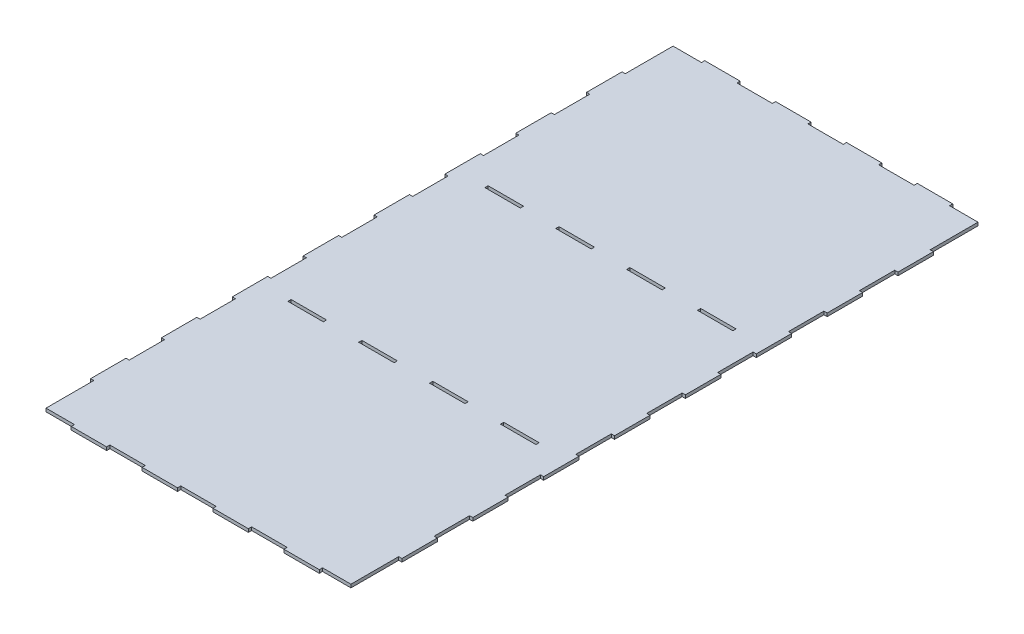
ISO-10303-21;
HEADER;
FILE_DESCRIPTION(('STEP AP214'),'2;1');
FILE_NAME('part.step','',(''),(''),'','','');
FILE_SCHEMA(('AUTOMOTIVE_DESIGN { 1 0 10303 214 1 1 1 1 }'));
ENDSEC;
DATA;
#1=APPLICATION_CONTEXT('core data for automotive mechanical design processes');
#2=APPLICATION_PROTOCOL_DEFINITION('international standard','automotive_design',2000,#1);
#3=PRODUCT_CONTEXT('',#1,'mechanical');
#4=PRODUCT('Part','Part','',(#3));
#5=PRODUCT_RELATED_PRODUCT_CATEGORY('part','',(#4));
#6=PRODUCT_DEFINITION_FORMATION('','',#4);
#7=PRODUCT_DEFINITION_CONTEXT('part definition',#1,'design');
#8=PRODUCT_DEFINITION('design','',#6,#7);
#9=PRODUCT_DEFINITION_SHAPE('','',#8);
#10=(LENGTH_UNIT() NAMED_UNIT(*) SI_UNIT(.MILLI.,.METRE.));
#11=(NAMED_UNIT(*) PLANE_ANGLE_UNIT() SI_UNIT($,.RADIAN.));
#12=(NAMED_UNIT(*) SI_UNIT($,.STERADIAN.) SOLID_ANGLE_UNIT());
#13=UNCERTAINTY_MEASURE_WITH_UNIT(LENGTH_MEASURE(1.E-05),#10,'distance_accuracy_value','');
#14=(GEOMETRIC_REPRESENTATION_CONTEXT(3) GLOBAL_UNCERTAINTY_ASSIGNED_CONTEXT((#13)) GLOBAL_UNIT_ASSIGNED_CONTEXT((#10,
#11,#12)) REPRESENTATION_CONTEXT('',''));
#15=CARTESIAN_POINT('',(0.,0.,0.));
#16=DIRECTION('',(0.,0.,1.));
#17=DIRECTION('',(1.,0.,0.));
#18=AXIS2_PLACEMENT_3D('',#15,#16,#17);
#19=CARTESIAN_POINT('',(0.,3.,0.));
#20=DIRECTION('',(0.,1.,0.));
#21=DIRECTION('',(0.,0.,1.));
#22=AXIS2_PLACEMENT_3D('',#19,#20,#21);
#23=PLANE('',#22);
#24=DIRECTION('',(-1.,0.,0.));
#25=VECTOR('',#24,1.);
#26=CARTESIAN_POINT('',(915.5,3.,-590.));
#27=LINE('',#26,#25);
#28=CARTESIAN_POINT('',(915.5,3.,-590.));
#29=VERTEX_POINT('',#28);
#30=CARTESIAN_POINT('',(889.,3.,-590.));
#31=VERTEX_POINT('',#30);
#32=EDGE_CURVE('E1198',#29,#31,#27,.T.);
#33=ORIENTED_EDGE('',*,*,#32,.T.);
#34=DIRECTION('',(0.,0.,1.));
#35=VECTOR('',#34,1.);
#36=CARTESIAN_POINT('',(889.,3.,-590.));
#37=LINE('',#36,#35);
#38=CARTESIAN_POINT('',(889.,3.,-545.5));
#39=VERTEX_POINT('',#38);
#40=EDGE_CURVE('E1202',#31,#39,#37,.T.);
#41=ORIENTED_EDGE('',*,*,#40,.T.);
#42=DIRECTION('',(-1.,0.,0.));
#43=VECTOR('',#42,1.);
#44=CARTESIAN_POINT('',(889.,3.,-545.5));
#45=LINE('',#44,#43);
#46=CARTESIAN_POINT('',(886.,3.,-545.5));
#47=VERTEX_POINT('',#46);
#48=EDGE_CURVE('E1206',#39,#47,#45,.T.);
#49=ORIENTED_EDGE('',*,*,#48,.T.);
#50=DIRECTION('',(0.,0.,1.));
#51=VECTOR('',#50,1.);
#52=CARTESIAN_POINT('',(886.,3.,-545.5));
#53=LINE('',#52,#51);
#54=CARTESIAN_POINT('',(886.,3.,-512.5));
#55=VERTEX_POINT('',#54);
#56=EDGE_CURVE('E1209',#47,#55,#53,.T.);
#57=ORIENTED_EDGE('',*,*,#56,.T.);
#58=DIRECTION('',(1.,0.,0.));
#59=VECTOR('',#58,1.);
#60=CARTESIAN_POINT('',(886.,3.,-512.5));
#61=LINE('',#60,#59);
#62=CARTESIAN_POINT('',(889.,3.,-512.5));
#63=VERTEX_POINT('',#62);
#64=EDGE_CURVE('E1212',#55,#63,#61,.T.);
#65=ORIENTED_EDGE('',*,*,#64,.T.);
#66=DIRECTION('',(0.,0.,1.));
#67=VECTOR('',#66,1.);
#68=CARTESIAN_POINT('',(889.,3.,-512.5));
#69=LINE('',#68,#67);
#70=CARTESIAN_POINT('',(889.,3.,-479.5));
#71=VERTEX_POINT('',#70);
#72=EDGE_CURVE('E1215',#63,#71,#69,.T.);
#73=ORIENTED_EDGE('',*,*,#72,.T.);
#74=DIRECTION('',(-1.,0.,0.));
#75=VECTOR('',#74,1.);
#76=CARTESIAN_POINT('',(889.,3.,-479.5));
#77=LINE('',#76,#75);
#78=CARTESIAN_POINT('',(886.,3.,-479.5));
#79=VERTEX_POINT('',#78);
#80=EDGE_CURVE('E1218',#71,#79,#77,.T.);
#81=ORIENTED_EDGE('',*,*,#80,.T.);
#82=DIRECTION('',(0.,0.,1.));
#83=VECTOR('',#82,1.);
#84=CARTESIAN_POINT('',(886.,3.,-479.5));
#85=LINE('',#84,#83);
#86=CARTESIAN_POINT('',(886.,3.,-446.5));
#87=VERTEX_POINT('',#86);
#88=EDGE_CURVE('E1221',#79,#87,#85,.T.);
#89=ORIENTED_EDGE('',*,*,#88,.T.);
#90=DIRECTION('',(1.,0.,0.));
#91=VECTOR('',#90,1.);
#92=CARTESIAN_POINT('',(886.,3.,-446.5));
#93=LINE('',#92,#91);
#94=CARTESIAN_POINT('',(889.,3.,-446.5));
#95=VERTEX_POINT('',#94);
#96=EDGE_CURVE('E1224',#87,#95,#93,.T.);
#97=ORIENTED_EDGE('',*,*,#96,.T.);
#98=DIRECTION('',(0.,0.,1.));
#99=VECTOR('',#98,1.);
#100=CARTESIAN_POINT('',(889.,3.,-446.5));
#101=LINE('',#100,#99);
#102=CARTESIAN_POINT('',(889.,3.,-413.5));
#103=VERTEX_POINT('',#102);
#104=EDGE_CURVE('E1227',#95,#103,#101,.T.);
#105=ORIENTED_EDGE('',*,*,#104,.T.);
#106=DIRECTION('',(-1.,0.,0.));
#107=VECTOR('',#106,1.);
#108=CARTESIAN_POINT('',(889.,3.,-413.5));
#109=LINE('',#108,#107);
#110=CARTESIAN_POINT('',(886.,3.,-413.5));
#111=VERTEX_POINT('',#110);
#112=EDGE_CURVE('E1230',#103,#111,#109,.T.);
#113=ORIENTED_EDGE('',*,*,#112,.T.);
#114=DIRECTION('',(0.,0.,1.));
#115=VECTOR('',#114,1.);
#116=CARTESIAN_POINT('',(886.,3.,-413.5));
#117=LINE('',#116,#115);
#118=CARTESIAN_POINT('',(886.,3.,-380.5));
#119=VERTEX_POINT('',#118);
#120=EDGE_CURVE('E1233',#111,#119,#117,.T.);
#121=ORIENTED_EDGE('',*,*,#120,.T.);
#122=DIRECTION('',(1.,0.,0.));
#123=VECTOR('',#122,1.);
#124=CARTESIAN_POINT('',(886.,3.,-380.5));
#125=LINE('',#124,#123);
#126=CARTESIAN_POINT('',(889.,3.,-380.5));
#127=VERTEX_POINT('',#126);
#128=EDGE_CURVE('E1236',#119,#127,#125,.T.);
#129=ORIENTED_EDGE('',*,*,#128,.T.);
#130=DIRECTION('',(0.,0.,1.));
#131=VECTOR('',#130,1.);
#132=CARTESIAN_POINT('',(889.,3.,-380.5));
#133=LINE('',#132,#131);
#134=CARTESIAN_POINT('',(889.,3.,-347.5));
#135=VERTEX_POINT('',#134);
#136=EDGE_CURVE('E1239',#127,#135,#133,.T.);
#137=ORIENTED_EDGE('',*,*,#136,.T.);
#138=DIRECTION('',(-1.,0.,0.));
#139=VECTOR('',#138,1.);
#140=CARTESIAN_POINT('',(889.,3.,-347.5));
#141=LINE('',#140,#139);
#142=CARTESIAN_POINT('',(886.,3.,-347.5));
#143=VERTEX_POINT('',#142);
#144=EDGE_CURVE('E1242',#135,#143,#141,.T.);
#145=ORIENTED_EDGE('',*,*,#144,.T.);
#146=DIRECTION('',(0.,0.,1.));
#147=VECTOR('',#146,1.);
#148=CARTESIAN_POINT('',(886.,3.,-347.5));
#149=LINE('',#148,#147);
#150=CARTESIAN_POINT('',(886.,3.,-314.5));
#151=VERTEX_POINT('',#150);
#152=EDGE_CURVE('E1245',#143,#151,#149,.T.);
#153=ORIENTED_EDGE('',*,*,#152,.T.);
#154=DIRECTION('',(1.,0.,0.));
#155=VECTOR('',#154,1.);
#156=CARTESIAN_POINT('',(886.,3.,-314.5));
#157=LINE('',#156,#155);
#158=CARTESIAN_POINT('',(889.,3.,-314.5));
#159=VERTEX_POINT('',#158);
#160=EDGE_CURVE('E1248',#151,#159,#157,.T.);
#161=ORIENTED_EDGE('',*,*,#160,.T.);
#162=DIRECTION('',(0.,0.,1.));
#163=VECTOR('',#162,1.);
#164=CARTESIAN_POINT('',(889.,3.,-314.5));
#165=LINE('',#164,#163);
#166=CARTESIAN_POINT('',(889.,3.,-281.5));
#167=VERTEX_POINT('',#166);
#168=EDGE_CURVE('E1251',#159,#167,#165,.T.);
#169=ORIENTED_EDGE('',*,*,#168,.T.);
#170=DIRECTION('',(-1.,0.,0.));
#171=VECTOR('',#170,1.);
#172=CARTESIAN_POINT('',(889.,3.,-281.5));
#173=LINE('',#172,#171);
#174=CARTESIAN_POINT('',(886.,3.,-281.5));
#175=VERTEX_POINT('',#174);
#176=EDGE_CURVE('E1254',#167,#175,#173,.T.);
#177=ORIENTED_EDGE('',*,*,#176,.T.);
#178=DIRECTION('',(0.,0.,1.));
#179=VECTOR('',#178,1.);
#180=CARTESIAN_POINT('',(886.,3.,-281.5));
#181=LINE('',#180,#179);
#182=CARTESIAN_POINT('',(886.,3.,-248.5));
#183=VERTEX_POINT('',#182);
#184=EDGE_CURVE('E1257',#175,#183,#181,.T.);
#185=ORIENTED_EDGE('',*,*,#184,.T.);
#186=DIRECTION('',(1.,0.,0.));
#187=VECTOR('',#186,1.);
#188=CARTESIAN_POINT('',(886.,3.,-248.5));
#189=LINE('',#188,#187);
#190=CARTESIAN_POINT('',(889.,3.,-248.5));
#191=VERTEX_POINT('',#190);
#192=EDGE_CURVE('E1260',#183,#191,#189,.T.);
#193=ORIENTED_EDGE('',*,*,#192,.T.);
#194=DIRECTION('',(0.,0.,1.));
#195=VECTOR('',#194,1.);
#196=CARTESIAN_POINT('',(889.,3.,-248.5));
#197=LINE('',#196,#195);
#198=CARTESIAN_POINT('',(889.,3.,-215.5));
#199=VERTEX_POINT('',#198);
#200=EDGE_CURVE('E1263',#191,#199,#197,.T.);
#201=ORIENTED_EDGE('',*,*,#200,.T.);
#202=DIRECTION('',(-1.,0.,0.));
#203=VECTOR('',#202,1.);
#204=CARTESIAN_POINT('',(889.,3.,-215.5));
#205=LINE('',#204,#203);
#206=CARTESIAN_POINT('',(886.,3.,-215.5));
#207=VERTEX_POINT('',#206);
#208=EDGE_CURVE('E1266',#199,#207,#205,.T.);
#209=ORIENTED_EDGE('',*,*,#208,.T.);
#210=DIRECTION('',(0.,0.,1.));
#211=VECTOR('',#210,1.);
#212=CARTESIAN_POINT('',(886.,3.,-215.5));
#213=LINE('',#212,#211);
#214=CARTESIAN_POINT('',(886.,3.,-182.5));
#215=VERTEX_POINT('',#214);
#216=EDGE_CURVE('E1269',#207,#215,#213,.T.);
#217=ORIENTED_EDGE('',*,*,#216,.T.);
#218=DIRECTION('',(1.,0.,0.));
#219=VECTOR('',#218,1.);
#220=CARTESIAN_POINT('',(886.,3.,-182.5));
#221=LINE('',#220,#219);
#222=CARTESIAN_POINT('',(889.,3.,-182.5));
#223=VERTEX_POINT('',#222);
#224=EDGE_CURVE('E1272',#215,#223,#221,.T.);
#225=ORIENTED_EDGE('',*,*,#224,.T.);
#226=DIRECTION('',(0.,0.,1.));
#227=VECTOR('',#226,1.);
#228=CARTESIAN_POINT('',(889.,3.,-182.5));
#229=LINE('',#228,#227);
#230=CARTESIAN_POINT('',(889.,3.,-149.5));
#231=VERTEX_POINT('',#230);
#232=EDGE_CURVE('E1275',#223,#231,#229,.T.);
#233=ORIENTED_EDGE('',*,*,#232,.T.);
#234=DIRECTION('',(-1.,0.,0.));
#235=VECTOR('',#234,1.);
#236=CARTESIAN_POINT('',(889.,3.,-149.5));
#237=LINE('',#236,#235);
#238=CARTESIAN_POINT('',(886.,3.,-149.5));
#239=VERTEX_POINT('',#238);
#240=EDGE_CURVE('E1278',#231,#239,#237,.T.);
#241=ORIENTED_EDGE('',*,*,#240,.T.);
#242=DIRECTION('',(0.,0.,1.));
#243=VECTOR('',#242,1.);
#244=CARTESIAN_POINT('',(886.,3.,-149.5));
#245=LINE('',#244,#243);
#246=CARTESIAN_POINT('',(886.,3.,-116.5));
#247=VERTEX_POINT('',#246);
#248=EDGE_CURVE('E1281',#239,#247,#245,.T.);
#249=ORIENTED_EDGE('',*,*,#248,.T.);
#250=DIRECTION('',(1.,0.,0.));
#251=VECTOR('',#250,1.);
#252=CARTESIAN_POINT('',(886.,3.,-116.5));
#253=LINE('',#252,#251);
#254=CARTESIAN_POINT('',(889.,3.,-116.5));
#255=VERTEX_POINT('',#254);
#256=EDGE_CURVE('E1284',#247,#255,#253,.T.);
#257=ORIENTED_EDGE('',*,*,#256,.T.);
#258=DIRECTION('',(0.,0.,1.));
#259=VECTOR('',#258,1.);
#260=CARTESIAN_POINT('',(889.,3.,-116.5));
#261=LINE('',#260,#259);
#262=CARTESIAN_POINT('',(889.,3.,-83.5));
#263=VERTEX_POINT('',#262);
#264=EDGE_CURVE('E1287',#255,#263,#261,.T.);
#265=ORIENTED_EDGE('',*,*,#264,.T.);
#266=DIRECTION('',(-1.,0.,0.));
#267=VECTOR('',#266,1.);
#268=CARTESIAN_POINT('',(889.,3.,-83.5));
#269=LINE('',#268,#267);
#270=CARTESIAN_POINT('',(886.,3.,-83.5));
#271=VERTEX_POINT('',#270);
#272=EDGE_CURVE('E1290',#263,#271,#269,.T.);
#273=ORIENTED_EDGE('',*,*,#272,.T.);
#274=DIRECTION('',(0.,0.,1.));
#275=VECTOR('',#274,1.);
#276=CARTESIAN_POINT('',(886.,3.,-83.5));
#277=LINE('',#276,#275);
#278=CARTESIAN_POINT('',(886.,3.,-50.5));
#279=VERTEX_POINT('',#278);
#280=EDGE_CURVE('E1293',#271,#279,#277,.T.);
#281=ORIENTED_EDGE('',*,*,#280,.T.);
#282=DIRECTION('',(1.,0.,0.));
#283=VECTOR('',#282,1.);
#284=CARTESIAN_POINT('',(886.,3.,-50.5));
#285=LINE('',#284,#283);
#286=CARTESIAN_POINT('',(889.,3.,-50.5));
#287=VERTEX_POINT('',#286);
#288=EDGE_CURVE('E1296',#279,#287,#285,.T.);
#289=ORIENTED_EDGE('',*,*,#288,.T.);
#290=DIRECTION('',(0.,0.,1.));
#291=VECTOR('',#290,1.);
#292=CARTESIAN_POINT('',(889.,3.,-50.5));
#293=LINE('',#292,#291);
#294=CARTESIAN_POINT('',(889.,3.,-6.));
#295=VERTEX_POINT('',#294);
#296=EDGE_CURVE('E1299',#287,#295,#293,.T.);
#297=ORIENTED_EDGE('',*,*,#296,.T.);
#298=DIRECTION('',(1.,0.,0.));
#299=VECTOR('',#298,1.);
#300=CARTESIAN_POINT('',(889.,3.,-6.));
#301=LINE('',#300,#299);
#302=CARTESIAN_POINT('',(915.5,3.,-6.));
#303=VERTEX_POINT('',#302);
#304=EDGE_CURVE('E1302',#295,#303,#301,.T.);
#305=ORIENTED_EDGE('',*,*,#304,.T.);
#306=DIRECTION('',(0.,0.,1.));
#307=VECTOR('',#306,1.);
#308=CARTESIAN_POINT('',(915.5,3.,-6.));
#309=LINE('',#308,#307);
#310=CARTESIAN_POINT('',(915.5,3.,-3.));
#311=VERTEX_POINT('',#310);
#312=EDGE_CURVE('E1305',#303,#311,#309,.T.);
#313=ORIENTED_EDGE('',*,*,#312,.T.);
#314=DIRECTION('',(1.,0.,0.));
#315=VECTOR('',#314,1.);
#316=CARTESIAN_POINT('',(915.5,3.,-3.));
#317=LINE('',#316,#315);
#318=CARTESIAN_POINT('',(948.5,3.,-3.));
#319=VERTEX_POINT('',#318);
#320=EDGE_CURVE('E1308',#311,#319,#317,.T.);
#321=ORIENTED_EDGE('',*,*,#320,.T.);
#322=DIRECTION('',(0.,0.,-1.));
#323=VECTOR('',#322,1.);
#324=CARTESIAN_POINT('',(948.5,3.,-3.));
#325=LINE('',#324,#323);
#326=CARTESIAN_POINT('',(948.5,3.,-6.));
#327=VERTEX_POINT('',#326);
#328=EDGE_CURVE('E1311',#319,#327,#325,.T.);
#329=ORIENTED_EDGE('',*,*,#328,.T.);
#330=DIRECTION('',(1.,0.,0.));
#331=VECTOR('',#330,1.);
#332=CARTESIAN_POINT('',(948.5,3.,-6.));
#333=LINE('',#332,#331);
#334=CARTESIAN_POINT('',(981.5,3.,-6.));
#335=VERTEX_POINT('',#334);
#336=EDGE_CURVE('E1314',#327,#335,#333,.T.);
#337=ORIENTED_EDGE('',*,*,#336,.T.);
#338=DIRECTION('',(0.,0.,1.));
#339=VECTOR('',#338,1.);
#340=CARTESIAN_POINT('',(981.5,3.,-6.));
#341=LINE('',#340,#339);
#342=CARTESIAN_POINT('',(981.5,3.,-3.));
#343=VERTEX_POINT('',#342);
#344=EDGE_CURVE('E1317',#335,#343,#341,.T.);
#345=ORIENTED_EDGE('',*,*,#344,.T.);
#346=DIRECTION('',(1.,0.,0.));
#347=VECTOR('',#346,1.);
#348=CARTESIAN_POINT('',(981.5,3.,-3.));
#349=LINE('',#348,#347);
#350=CARTESIAN_POINT('',(1014.5,3.,-3.));
#351=VERTEX_POINT('',#350);
#352=EDGE_CURVE('E1320',#343,#351,#349,.T.);
#353=ORIENTED_EDGE('',*,*,#352,.T.);
#354=DIRECTION('',(0.,0.,-1.));
#355=VECTOR('',#354,1.);
#356=CARTESIAN_POINT('',(1014.5,3.,-3.));
#357=LINE('',#356,#355);
#358=CARTESIAN_POINT('',(1014.5,3.,-6.));
#359=VERTEX_POINT('',#358);
#360=EDGE_CURVE('E1323',#351,#359,#357,.T.);
#361=ORIENTED_EDGE('',*,*,#360,.T.);
#362=DIRECTION('',(1.,0.,0.));
#363=VECTOR('',#362,1.);
#364=CARTESIAN_POINT('',(1014.5,3.,-6.));
#365=LINE('',#364,#363);
#366=CARTESIAN_POINT('',(1047.5,3.,-6.));
#367=VERTEX_POINT('',#366);
#368=EDGE_CURVE('E1326',#359,#367,#365,.T.);
#369=ORIENTED_EDGE('',*,*,#368,.T.);
#370=DIRECTION('',(0.,0.,1.));
#371=VECTOR('',#370,1.);
#372=CARTESIAN_POINT('',(1047.5,3.,-6.));
#373=LINE('',#372,#371);
#374=CARTESIAN_POINT('',(1047.5,3.,-3.));
#375=VERTEX_POINT('',#374);
#376=EDGE_CURVE('E1329',#367,#375,#373,.T.);
#377=ORIENTED_EDGE('',*,*,#376,.T.);
#378=DIRECTION('',(1.,0.,0.));
#379=VECTOR('',#378,1.);
#380=CARTESIAN_POINT('',(1047.5,3.,-3.));
#381=LINE('',#380,#379);
#382=CARTESIAN_POINT('',(1080.5,3.,-3.));
#383=VERTEX_POINT('',#382);
#384=EDGE_CURVE('E1332',#375,#383,#381,.T.);
#385=ORIENTED_EDGE('',*,*,#384,.T.);
#386=DIRECTION('',(0.,0.,-1.));
#387=VECTOR('',#386,1.);
#388=CARTESIAN_POINT('',(1080.5,3.,-3.));
#389=LINE('',#388,#387);
#390=CARTESIAN_POINT('',(1080.5,3.,-6.));
#391=VERTEX_POINT('',#390);
#392=EDGE_CURVE('E1335',#383,#391,#389,.T.);
#393=ORIENTED_EDGE('',*,*,#392,.T.);
#394=DIRECTION('',(1.,0.,0.));
#395=VECTOR('',#394,1.);
#396=CARTESIAN_POINT('',(1080.5,3.,-6.));
#397=LINE('',#396,#395);
#398=CARTESIAN_POINT('',(1113.5,3.,-6.));
#399=VERTEX_POINT('',#398);
#400=EDGE_CURVE('E1338',#391,#399,#397,.T.);
#401=ORIENTED_EDGE('',*,*,#400,.T.);
#402=DIRECTION('',(0.,0.,1.));
#403=VECTOR('',#402,1.);
#404=CARTESIAN_POINT('',(1113.5,3.,-6.));
#405=LINE('',#404,#403);
#406=CARTESIAN_POINT('',(1113.5,3.,-3.));
#407=VERTEX_POINT('',#406);
#408=EDGE_CURVE('E1341',#399,#407,#405,.T.);
#409=ORIENTED_EDGE('',*,*,#408,.T.);
#410=DIRECTION('',(1.,0.,0.));
#411=VECTOR('',#410,1.);
#412=CARTESIAN_POINT('',(1113.5,3.,-3.));
#413=LINE('',#412,#411);
#414=CARTESIAN_POINT('',(1146.5,3.,-3.));
#415=VERTEX_POINT('',#414);
#416=EDGE_CURVE('E1344',#407,#415,#413,.T.);
#417=ORIENTED_EDGE('',*,*,#416,.T.);
#418=DIRECTION('',(0.,0.,-1.));
#419=VECTOR('',#418,1.);
#420=CARTESIAN_POINT('',(1146.5,3.,-3.));
#421=LINE('',#420,#419);
#422=CARTESIAN_POINT('',(1146.5,3.,-6.));
#423=VERTEX_POINT('',#422);
#424=EDGE_CURVE('E1347',#415,#423,#421,.T.);
#425=ORIENTED_EDGE('',*,*,#424,.T.);
#426=DIRECTION('',(1.,0.,0.));
#427=VECTOR('',#426,1.);
#428=CARTESIAN_POINT('',(1146.5,3.,-6.));
#429=LINE('',#428,#427);
#430=CARTESIAN_POINT('',(1173.,3.,-6.));
#431=VERTEX_POINT('',#430);
#432=EDGE_CURVE('E1350',#423,#431,#429,.T.);
#433=ORIENTED_EDGE('',*,*,#432,.T.);
#434=DIRECTION('',(0.,0.,-1.));
#435=VECTOR('',#434,1.);
#436=CARTESIAN_POINT('',(1173.,3.,-6.));
#437=LINE('',#436,#435);
#438=CARTESIAN_POINT('',(1173.,3.,-50.5));
#439=VERTEX_POINT('',#438);
#440=EDGE_CURVE('E1353',#431,#439,#437,.T.);
#441=ORIENTED_EDGE('',*,*,#440,.T.);
#442=DIRECTION('',(1.,0.,0.));
#443=VECTOR('',#442,1.);
#444=CARTESIAN_POINT('',(1173.,3.,-50.5));
#445=LINE('',#444,#443);
#446=CARTESIAN_POINT('',(1176.,3.,-50.5));
#447=VERTEX_POINT('',#446);
#448=EDGE_CURVE('E1356',#439,#447,#445,.T.);
#449=ORIENTED_EDGE('',*,*,#448,.T.);
#450=DIRECTION('',(0.,0.,-1.));
#451=VECTOR('',#450,1.);
#452=CARTESIAN_POINT('',(1176.,3.,-50.5));
#453=LINE('',#452,#451);
#454=CARTESIAN_POINT('',(1176.,3.,-83.5));
#455=VERTEX_POINT('',#454);
#456=EDGE_CURVE('E1359',#447,#455,#453,.T.);
#457=ORIENTED_EDGE('',*,*,#456,.T.);
#458=DIRECTION('',(-1.,0.,0.));
#459=VECTOR('',#458,1.);
#460=CARTESIAN_POINT('',(1176.,3.,-83.5));
#461=LINE('',#460,#459);
#462=CARTESIAN_POINT('',(1173.,3.,-83.5));
#463=VERTEX_POINT('',#462);
#464=EDGE_CURVE('E1362',#455,#463,#461,.T.);
#465=ORIENTED_EDGE('',*,*,#464,.T.);
#466=DIRECTION('',(0.,0.,-1.));
#467=VECTOR('',#466,1.);
#468=CARTESIAN_POINT('',(1173.,3.,-83.5));
#469=LINE('',#468,#467);
#470=CARTESIAN_POINT('',(1173.,3.,-116.5));
#471=VERTEX_POINT('',#470);
#472=EDGE_CURVE('E1365',#463,#471,#469,.T.);
#473=ORIENTED_EDGE('',*,*,#472,.T.);
#474=DIRECTION('',(1.,0.,0.));
#475=VECTOR('',#474,1.);
#476=CARTESIAN_POINT('',(1173.,3.,-116.5));
#477=LINE('',#476,#475);
#478=CARTESIAN_POINT('',(1176.,3.,-116.5));
#479=VERTEX_POINT('',#478);
#480=EDGE_CURVE('E1368',#471,#479,#477,.T.);
#481=ORIENTED_EDGE('',*,*,#480,.T.);
#482=DIRECTION('',(0.,0.,-1.));
#483=VECTOR('',#482,1.);
#484=CARTESIAN_POINT('',(1176.,3.,-116.5));
#485=LINE('',#484,#483);
#486=CARTESIAN_POINT('',(1176.,3.,-149.5));
#487=VERTEX_POINT('',#486);
#488=EDGE_CURVE('E1371',#479,#487,#485,.T.);
#489=ORIENTED_EDGE('',*,*,#488,.T.);
#490=DIRECTION('',(-1.,0.,0.));
#491=VECTOR('',#490,1.);
#492=CARTESIAN_POINT('',(1176.,3.,-149.5));
#493=LINE('',#492,#491);
#494=CARTESIAN_POINT('',(1173.,3.,-149.5));
#495=VERTEX_POINT('',#494);
#496=EDGE_CURVE('E1374',#487,#495,#493,.T.);
#497=ORIENTED_EDGE('',*,*,#496,.T.);
#498=DIRECTION('',(0.,0.,-1.));
#499=VECTOR('',#498,1.);
#500=CARTESIAN_POINT('',(1173.,3.,-149.5));
#501=LINE('',#500,#499);
#502=CARTESIAN_POINT('',(1173.,3.,-182.5));
#503=VERTEX_POINT('',#502);
#504=EDGE_CURVE('E1377',#495,#503,#501,.T.);
#505=ORIENTED_EDGE('',*,*,#504,.T.);
#506=DIRECTION('',(1.,0.,0.));
#507=VECTOR('',#506,1.);
#508=CARTESIAN_POINT('',(1173.,3.,-182.5));
#509=LINE('',#508,#507);
#510=CARTESIAN_POINT('',(1176.,3.,-182.5));
#511=VERTEX_POINT('',#510);
#512=EDGE_CURVE('E1380',#503,#511,#509,.T.);
#513=ORIENTED_EDGE('',*,*,#512,.T.);
#514=DIRECTION('',(0.,0.,-1.));
#515=VECTOR('',#514,1.);
#516=CARTESIAN_POINT('',(1176.,3.,-182.5));
#517=LINE('',#516,#515);
#518=CARTESIAN_POINT('',(1176.,3.,-215.5));
#519=VERTEX_POINT('',#518);
#520=EDGE_CURVE('E1383',#511,#519,#517,.T.);
#521=ORIENTED_EDGE('',*,*,#520,.T.);
#522=DIRECTION('',(-1.,0.,0.));
#523=VECTOR('',#522,1.);
#524=CARTESIAN_POINT('',(1176.,3.,-215.5));
#525=LINE('',#524,#523);
#526=CARTESIAN_POINT('',(1173.,3.,-215.5));
#527=VERTEX_POINT('',#526);
#528=EDGE_CURVE('E1386',#519,#527,#525,.T.);
#529=ORIENTED_EDGE('',*,*,#528,.T.);
#530=DIRECTION('',(0.,0.,-1.));
#531=VECTOR('',#530,1.);
#532=CARTESIAN_POINT('',(1173.,3.,-215.5));
#533=LINE('',#532,#531);
#534=CARTESIAN_POINT('',(1173.,3.,-248.5));
#535=VERTEX_POINT('',#534);
#536=EDGE_CURVE('E1389',#527,#535,#533,.T.);
#537=ORIENTED_EDGE('',*,*,#536,.T.);
#538=DIRECTION('',(1.,0.,0.));
#539=VECTOR('',#538,1.);
#540=CARTESIAN_POINT('',(1173.,3.,-248.5));
#541=LINE('',#540,#539);
#542=CARTESIAN_POINT('',(1176.,3.,-248.5));
#543=VERTEX_POINT('',#542);
#544=EDGE_CURVE('E1392',#535,#543,#541,.T.);
#545=ORIENTED_EDGE('',*,*,#544,.T.);
#546=DIRECTION('',(0.,0.,-1.));
#547=VECTOR('',#546,1.);
#548=CARTESIAN_POINT('',(1176.,3.,-248.5));
#549=LINE('',#548,#547);
#550=CARTESIAN_POINT('',(1176.,3.,-281.5));
#551=VERTEX_POINT('',#550);
#552=EDGE_CURVE('E1395',#543,#551,#549,.T.);
#553=ORIENTED_EDGE('',*,*,#552,.T.);
#554=DIRECTION('',(-1.,0.,0.));
#555=VECTOR('',#554,1.);
#556=CARTESIAN_POINT('',(1176.,3.,-281.5));
#557=LINE('',#556,#555);
#558=CARTESIAN_POINT('',(1173.,3.,-281.5));
#559=VERTEX_POINT('',#558);
#560=EDGE_CURVE('E1398',#551,#559,#557,.T.);
#561=ORIENTED_EDGE('',*,*,#560,.T.);
#562=DIRECTION('',(0.,0.,-1.));
#563=VECTOR('',#562,1.);
#564=CARTESIAN_POINT('',(1173.,3.,-281.5));
#565=LINE('',#564,#563);
#566=CARTESIAN_POINT('',(1173.,3.,-314.5));
#567=VERTEX_POINT('',#566);
#568=EDGE_CURVE('E1401',#559,#567,#565,.T.);
#569=ORIENTED_EDGE('',*,*,#568,.T.);
#570=DIRECTION('',(1.,0.,0.));
#571=VECTOR('',#570,1.);
#572=CARTESIAN_POINT('',(1173.,3.,-314.5));
#573=LINE('',#572,#571);
#574=CARTESIAN_POINT('',(1176.,3.,-314.5));
#575=VERTEX_POINT('',#574);
#576=EDGE_CURVE('E1404',#567,#575,#573,.T.);
#577=ORIENTED_EDGE('',*,*,#576,.T.);
#578=DIRECTION('',(0.,0.,-1.));
#579=VECTOR('',#578,1.);
#580=CARTESIAN_POINT('',(1176.,3.,-314.5));
#581=LINE('',#580,#579);
#582=CARTESIAN_POINT('',(1176.,3.,-347.5));
#583=VERTEX_POINT('',#582);
#584=EDGE_CURVE('E1407',#575,#583,#581,.T.);
#585=ORIENTED_EDGE('',*,*,#584,.T.);
#586=DIRECTION('',(-1.,0.,0.));
#587=VECTOR('',#586,1.);
#588=CARTESIAN_POINT('',(1176.,3.,-347.5));
#589=LINE('',#588,#587);
#590=CARTESIAN_POINT('',(1173.,3.,-347.5));
#591=VERTEX_POINT('',#590);
#592=EDGE_CURVE('E1410',#583,#591,#589,.T.);
#593=ORIENTED_EDGE('',*,*,#592,.T.);
#594=DIRECTION('',(0.,0.,-1.));
#595=VECTOR('',#594,1.);
#596=CARTESIAN_POINT('',(1173.,3.,-347.5));
#597=LINE('',#596,#595);
#598=CARTESIAN_POINT('',(1173.,3.,-380.5));
#599=VERTEX_POINT('',#598);
#600=EDGE_CURVE('E1413',#591,#599,#597,.T.);
#601=ORIENTED_EDGE('',*,*,#600,.T.);
#602=DIRECTION('',(1.,0.,0.));
#603=VECTOR('',#602,1.);
#604=CARTESIAN_POINT('',(1173.,3.,-380.5));
#605=LINE('',#604,#603);
#606=CARTESIAN_POINT('',(1176.,3.,-380.5));
#607=VERTEX_POINT('',#606);
#608=EDGE_CURVE('E1416',#599,#607,#605,.T.);
#609=ORIENTED_EDGE('',*,*,#608,.T.);
#610=DIRECTION('',(0.,0.,-1.));
#611=VECTOR('',#610,1.);
#612=CARTESIAN_POINT('',(1176.,3.,-380.5));
#613=LINE('',#612,#611);
#614=CARTESIAN_POINT('',(1176.,3.,-413.5));
#615=VERTEX_POINT('',#614);
#616=EDGE_CURVE('E1419',#607,#615,#613,.T.);
#617=ORIENTED_EDGE('',*,*,#616,.T.);
#618=DIRECTION('',(-1.,0.,0.));
#619=VECTOR('',#618,1.);
#620=CARTESIAN_POINT('',(1176.,3.,-413.5));
#621=LINE('',#620,#619);
#622=CARTESIAN_POINT('',(1173.,3.,-413.5));
#623=VERTEX_POINT('',#622);
#624=EDGE_CURVE('E1422',#615,#623,#621,.T.);
#625=ORIENTED_EDGE('',*,*,#624,.T.);
#626=DIRECTION('',(0.,0.,-1.));
#627=VECTOR('',#626,1.);
#628=CARTESIAN_POINT('',(1173.,3.,-413.5));
#629=LINE('',#628,#627);
#630=CARTESIAN_POINT('',(1173.,3.,-446.5));
#631=VERTEX_POINT('',#630);
#632=EDGE_CURVE('E1425',#623,#631,#629,.T.);
#633=ORIENTED_EDGE('',*,*,#632,.T.);
#634=DIRECTION('',(1.,0.,0.));
#635=VECTOR('',#634,1.);
#636=CARTESIAN_POINT('',(1173.,3.,-446.5));
#637=LINE('',#636,#635);
#638=CARTESIAN_POINT('',(1176.,3.,-446.5));
#639=VERTEX_POINT('',#638);
#640=EDGE_CURVE('E1428',#631,#639,#637,.T.);
#641=ORIENTED_EDGE('',*,*,#640,.T.);
#642=DIRECTION('',(0.,0.,-1.));
#643=VECTOR('',#642,1.);
#644=CARTESIAN_POINT('',(1176.,3.,-446.5));
#645=LINE('',#644,#643);
#646=CARTESIAN_POINT('',(1176.,3.,-479.5));
#647=VERTEX_POINT('',#646);
#648=EDGE_CURVE('E1431',#639,#647,#645,.T.);
#649=ORIENTED_EDGE('',*,*,#648,.T.);
#650=DIRECTION('',(-1.,0.,0.));
#651=VECTOR('',#650,1.);
#652=CARTESIAN_POINT('',(1176.,3.,-479.5));
#653=LINE('',#652,#651);
#654=CARTESIAN_POINT('',(1173.,3.,-479.5));
#655=VERTEX_POINT('',#654);
#656=EDGE_CURVE('E1434',#647,#655,#653,.T.);
#657=ORIENTED_EDGE('',*,*,#656,.T.);
#658=DIRECTION('',(0.,0.,-1.));
#659=VECTOR('',#658,1.);
#660=CARTESIAN_POINT('',(1173.,3.,-479.5));
#661=LINE('',#660,#659);
#662=CARTESIAN_POINT('',(1173.,3.,-512.5));
#663=VERTEX_POINT('',#662);
#664=EDGE_CURVE('E1437',#655,#663,#661,.T.);
#665=ORIENTED_EDGE('',*,*,#664,.T.);
#666=DIRECTION('',(1.,0.,0.));
#667=VECTOR('',#666,1.);
#668=CARTESIAN_POINT('',(1173.,3.,-512.5));
#669=LINE('',#668,#667);
#670=CARTESIAN_POINT('',(1176.,3.,-512.5));
#671=VERTEX_POINT('',#670);
#672=EDGE_CURVE('E1440',#663,#671,#669,.T.);
#673=ORIENTED_EDGE('',*,*,#672,.T.);
#674=DIRECTION('',(0.,0.,-1.));
#675=VECTOR('',#674,1.);
#676=CARTESIAN_POINT('',(1176.,3.,-512.5));
#677=LINE('',#676,#675);
#678=CARTESIAN_POINT('',(1176.,3.,-545.5));
#679=VERTEX_POINT('',#678);
#680=EDGE_CURVE('E1443',#671,#679,#677,.T.);
#681=ORIENTED_EDGE('',*,*,#680,.T.);
#682=DIRECTION('',(-1.,0.,0.));
#683=VECTOR('',#682,1.);
#684=CARTESIAN_POINT('',(1176.,3.,-545.5));
#685=LINE('',#684,#683);
#686=CARTESIAN_POINT('',(1173.,3.,-545.5));
#687=VERTEX_POINT('',#686);
#688=EDGE_CURVE('E1446',#679,#687,#685,.T.);
#689=ORIENTED_EDGE('',*,*,#688,.T.);
#690=DIRECTION('',(0.,0.,-1.));
#691=VECTOR('',#690,1.);
#692=CARTESIAN_POINT('',(1173.,3.,-545.5));
#693=LINE('',#692,#691);
#694=CARTESIAN_POINT('',(1173.,3.,-590.));
#695=VERTEX_POINT('',#694);
#696=EDGE_CURVE('E1449',#687,#695,#693,.T.);
#697=ORIENTED_EDGE('',*,*,#696,.T.);
#698=DIRECTION('',(-1.,0.,0.));
#699=VECTOR('',#698,1.);
#700=CARTESIAN_POINT('',(1173.,3.,-590.));
#701=LINE('',#700,#699);
#702=CARTESIAN_POINT('',(1146.5,3.,-590.));
#703=VERTEX_POINT('',#702);
#704=EDGE_CURVE('E1452',#695,#703,#701,.T.);
#705=ORIENTED_EDGE('',*,*,#704,.T.);
#706=DIRECTION('',(0.,0.,-1.));
#707=VECTOR('',#706,1.);
#708=CARTESIAN_POINT('',(1146.5,3.,-590.));
#709=LINE('',#708,#707);
#710=CARTESIAN_POINT('',(1146.5,3.,-593.));
#711=VERTEX_POINT('',#710);
#712=EDGE_CURVE('E1455',#703,#711,#709,.T.);
#713=ORIENTED_EDGE('',*,*,#712,.T.);
#714=DIRECTION('',(-1.,0.,0.));
#715=VECTOR('',#714,1.);
#716=CARTESIAN_POINT('',(1146.5,3.,-593.));
#717=LINE('',#716,#715);
#718=CARTESIAN_POINT('',(1113.5,3.,-593.));
#719=VERTEX_POINT('',#718);
#720=EDGE_CURVE('E1458',#711,#719,#717,.T.);
#721=ORIENTED_EDGE('',*,*,#720,.T.);
#722=DIRECTION('',(0.,0.,1.));
#723=VECTOR('',#722,1.);
#724=CARTESIAN_POINT('',(1113.5,3.,-593.));
#725=LINE('',#724,#723);
#726=CARTESIAN_POINT('',(1113.5,3.,-590.));
#727=VERTEX_POINT('',#726);
#728=EDGE_CURVE('E1461',#719,#727,#725,.T.);
#729=ORIENTED_EDGE('',*,*,#728,.T.);
#730=DIRECTION('',(-1.,0.,0.));
#731=VECTOR('',#730,1.);
#732=CARTESIAN_POINT('',(1113.5,3.,-590.));
#733=LINE('',#732,#731);
#734=CARTESIAN_POINT('',(1080.5,3.,-590.));
#735=VERTEX_POINT('',#734);
#736=EDGE_CURVE('E1464',#727,#735,#733,.T.);
#737=ORIENTED_EDGE('',*,*,#736,.T.);
#738=DIRECTION('',(0.,0.,-1.));
#739=VECTOR('',#738,1.);
#740=CARTESIAN_POINT('',(1080.5,3.,-590.));
#741=LINE('',#740,#739);
#742=CARTESIAN_POINT('',(1080.5,3.,-593.));
#743=VERTEX_POINT('',#742);
#744=EDGE_CURVE('E1467',#735,#743,#741,.T.);
#745=ORIENTED_EDGE('',*,*,#744,.T.);
#746=DIRECTION('',(-1.,0.,0.));
#747=VECTOR('',#746,1.);
#748=CARTESIAN_POINT('',(1080.5,3.,-593.));
#749=LINE('',#748,#747);
#750=CARTESIAN_POINT('',(1047.5,3.,-593.));
#751=VERTEX_POINT('',#750);
#752=EDGE_CURVE('E1470',#743,#751,#749,.T.);
#753=ORIENTED_EDGE('',*,*,#752,.T.);
#754=DIRECTION('',(0.,0.,1.));
#755=VECTOR('',#754,1.);
#756=CARTESIAN_POINT('',(1047.5,3.,-593.));
#757=LINE('',#756,#755);
#758=CARTESIAN_POINT('',(1047.5,3.,-590.));
#759=VERTEX_POINT('',#758);
#760=EDGE_CURVE('E1473',#751,#759,#757,.T.);
#761=ORIENTED_EDGE('',*,*,#760,.T.);
#762=DIRECTION('',(-1.,0.,0.));
#763=VECTOR('',#762,1.);
#764=CARTESIAN_POINT('',(1047.5,3.,-590.));
#765=LINE('',#764,#763);
#766=CARTESIAN_POINT('',(1014.5,3.,-590.));
#767=VERTEX_POINT('',#766);
#768=EDGE_CURVE('E1476',#759,#767,#765,.T.);
#769=ORIENTED_EDGE('',*,*,#768,.T.);
#770=DIRECTION('',(0.,0.,-1.));
#771=VECTOR('',#770,1.);
#772=CARTESIAN_POINT('',(1014.5,3.,-590.));
#773=LINE('',#772,#771);
#774=CARTESIAN_POINT('',(1014.5,3.,-593.));
#775=VERTEX_POINT('',#774);
#776=EDGE_CURVE('E1479',#767,#775,#773,.T.);
#777=ORIENTED_EDGE('',*,*,#776,.T.);
#778=DIRECTION('',(-1.,0.,0.));
#779=VECTOR('',#778,1.);
#780=CARTESIAN_POINT('',(1014.5,3.,-593.));
#781=LINE('',#780,#779);
#782=CARTESIAN_POINT('',(981.5,3.,-593.));
#783=VERTEX_POINT('',#782);
#784=EDGE_CURVE('E1482',#775,#783,#781,.T.);
#785=ORIENTED_EDGE('',*,*,#784,.T.);
#786=DIRECTION('',(0.,0.,1.));
#787=VECTOR('',#786,1.);
#788=CARTESIAN_POINT('',(981.5,3.,-593.));
#789=LINE('',#788,#787);
#790=CARTESIAN_POINT('',(981.5,3.,-590.));
#791=VERTEX_POINT('',#790);
#792=EDGE_CURVE('E1485',#783,#791,#789,.T.);
#793=ORIENTED_EDGE('',*,*,#792,.T.);
#794=DIRECTION('',(-1.,0.,0.));
#795=VECTOR('',#794,1.);
#796=CARTESIAN_POINT('',(981.5,3.,-590.));
#797=LINE('',#796,#795);
#798=CARTESIAN_POINT('',(948.5,3.,-590.));
#799=VERTEX_POINT('',#798);
#800=EDGE_CURVE('E1488',#791,#799,#797,.T.);
#801=ORIENTED_EDGE('',*,*,#800,.T.);
#802=DIRECTION('',(0.,0.,-1.));
#803=VECTOR('',#802,1.);
#804=CARTESIAN_POINT('',(948.5,3.,-590.));
#805=LINE('',#804,#803);
#806=CARTESIAN_POINT('',(948.5,3.,-593.));
#807=VERTEX_POINT('',#806);
#808=EDGE_CURVE('E1491',#799,#807,#805,.T.);
#809=ORIENTED_EDGE('',*,*,#808,.T.);
#810=DIRECTION('',(-1.,0.,0.));
#811=VECTOR('',#810,1.);
#812=CARTESIAN_POINT('',(948.5,3.,-593.));
#813=LINE('',#812,#811);
#814=CARTESIAN_POINT('',(915.5,3.,-593.));
#815=VERTEX_POINT('',#814);
#816=EDGE_CURVE('E1494',#807,#815,#813,.T.);
#817=ORIENTED_EDGE('',*,*,#816,.T.);
#818=DIRECTION('',(0.,0.,1.));
#819=VECTOR('',#818,1.);
#820=CARTESIAN_POINT('',(915.5,3.,-593.));
#821=LINE('',#820,#819);
#822=EDGE_CURVE('E1497',#815,#29,#821,.T.);
#823=ORIENTED_EDGE('',*,*,#822,.T.);
#824=EDGE_LOOP('',(#33,#41,#49,#57,#65,#73,#81,#89,#97,#105,#113,#121,#129,#137,#145,#153,#161,
#169,#177,#185,#193,#201,#209,#217,#225,#233,#241,#249,#257,#265,#273,#281,#289,#297,#305,#313,
#321,#329,#337,#345,#353,#361,#369,#377,#385,#393,#401,#409,#417,#425,#433,#441,#449,#457,#465,
#473,#481,#489,#497,#505,#513,#521,#529,#537,#545,#553,#561,#569,#577,#585,#593,#601,#609,#617,
#625,#633,#641,#649,#657,#665,#673,#681,#689,#697,#705,#713,#721,#729,#737,#745,#753,#761,#769,
#777,#785,#793,#801,#809,#817,#823));
#825=FACE_BOUND('',#824,.T.);
#826=DIRECTION('',(1.,0.,0.));
#827=VECTOR('',#826,1.);
#828=CARTESIAN_POINT('',(915.5,3.,-388.25));
#829=LINE('',#828,#827);
#830=CARTESIAN_POINT('',(915.5,3.,-388.25));
#831=VERTEX_POINT('',#830);
#832=CARTESIAN_POINT('',(948.5,3.,-388.25));
#833=VERTEX_POINT('',#832);
#834=EDGE_CURVE('E1158',#831,#833,#829,.T.);
#835=ORIENTED_EDGE('',*,*,#834,.F.);
#836=DIRECTION('',(0.,0.,1.));
#837=VECTOR('',#836,1.);
#838=CARTESIAN_POINT('',(915.5,3.,-391.25));
#839=LINE('',#838,#837);
#840=CARTESIAN_POINT('',(915.5,3.,-391.25));
#841=VERTEX_POINT('',#840);
#842=EDGE_CURVE('E1155',#841,#831,#839,.T.);
#843=ORIENTED_EDGE('',*,*,#842,.F.);
#844=DIRECTION('',(-1.,0.,0.));
#845=VECTOR('',#844,1.);
#846=CARTESIAN_POINT('',(915.5,3.,-391.25));
#847=LINE('',#846,#845);
#848=CARTESIAN_POINT('',(948.5,3.,-391.25));
#849=VERTEX_POINT('',#848);
#850=EDGE_CURVE('E1166',#849,#841,#847,.T.);
#851=ORIENTED_EDGE('',*,*,#850,.F.);
#852=DIRECTION('',(0.,0.,-1.));
#853=VECTOR('',#852,1.);
#854=CARTESIAN_POINT('',(948.5,3.,-391.25));
#855=LINE('',#854,#853);
#856=EDGE_CURVE('E1162',#833,#849,#855,.T.);
#857=ORIENTED_EDGE('',*,*,#856,.F.);
#858=EDGE_LOOP('',(#835,#843,#851,#857));
#859=FACE_BOUND('',#858,.T.);
#860=DIRECTION('',(1.,0.,0.));
#861=VECTOR('',#860,1.);
#862=CARTESIAN_POINT('',(981.499999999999,3.,-388.25));
#863=LINE('',#862,#861);
#864=CARTESIAN_POINT('',(981.499999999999,3.,-388.25));
#865=VERTEX_POINT('',#864);
#866=CARTESIAN_POINT('',(1014.5,3.,-388.25));
#867=VERTEX_POINT('',#866);
#868=EDGE_CURVE('E1115',#865,#867,#863,.T.);
#869=ORIENTED_EDGE('',*,*,#868,.F.);
#870=DIRECTION('',(0.,0.,1.));
#871=VECTOR('',#870,1.);
#872=CARTESIAN_POINT('',(981.499999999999,3.,-391.25));
#873=LINE('',#872,#871);
#874=CARTESIAN_POINT('',(981.499999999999,3.,-391.25));
#875=VERTEX_POINT('',#874);
#876=EDGE_CURVE('E1112',#875,#865,#873,.T.);
#877=ORIENTED_EDGE('',*,*,#876,.F.);
#878=DIRECTION('',(-1.,0.,0.));
#879=VECTOR('',#878,1.);
#880=CARTESIAN_POINT('',(981.499999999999,3.,-391.25));
#881=LINE('',#880,#879);
#882=CARTESIAN_POINT('',(1014.5,3.,-391.25));
#883=VERTEX_POINT('',#882);
#884=EDGE_CURVE('E1123',#883,#875,#881,.T.);
#885=ORIENTED_EDGE('',*,*,#884,.F.);
#886=DIRECTION('',(0.,0.,-1.));
#887=VECTOR('',#886,1.);
#888=CARTESIAN_POINT('',(1014.5,3.,-391.25));
#889=LINE('',#888,#887);
#890=EDGE_CURVE('E1119',#867,#883,#889,.T.);
#891=ORIENTED_EDGE('',*,*,#890,.F.);
#892=EDGE_LOOP('',(#869,#877,#885,#891));
#893=FACE_BOUND('',#892,.T.);
#894=DIRECTION('',(1.,0.,0.));
#895=VECTOR('',#894,1.);
#896=CARTESIAN_POINT('',(1047.5,3.,-388.25));
#897=LINE('',#896,#895);
#898=CARTESIAN_POINT('',(1047.5,3.,-388.25));
#899=VERTEX_POINT('',#898);
#900=CARTESIAN_POINT('',(1080.5,3.,-388.25));
#901=VERTEX_POINT('',#900);
#902=EDGE_CURVE('E1072',#899,#901,#897,.T.);
#903=ORIENTED_EDGE('',*,*,#902,.F.);
#904=DIRECTION('',(0.,0.,1.));
#905=VECTOR('',#904,1.);
#906=CARTESIAN_POINT('',(1047.5,3.,-391.25));
#907=LINE('',#906,#905);
#908=CARTESIAN_POINT('',(1047.5,3.,-391.25));
#909=VERTEX_POINT('',#908);
#910=EDGE_CURVE('E1069',#909,#899,#907,.T.);
#911=ORIENTED_EDGE('',*,*,#910,.F.);
#912=DIRECTION('',(-1.,0.,0.));
#913=VECTOR('',#912,1.);
#914=CARTESIAN_POINT('',(1047.5,3.,-391.25));
#915=LINE('',#914,#913);
#916=CARTESIAN_POINT('',(1080.5,3.,-391.25));
#917=VERTEX_POINT('',#916);
#918=EDGE_CURVE('E1080',#917,#909,#915,.T.);
#919=ORIENTED_EDGE('',*,*,#918,.F.);
#920=DIRECTION('',(0.,0.,-1.));
#921=VECTOR('',#920,1.);
#922=CARTESIAN_POINT('',(1080.5,3.,-391.25));
#923=LINE('',#922,#921);
#924=EDGE_CURVE('E1076',#901,#917,#923,.T.);
#925=ORIENTED_EDGE('',*,*,#924,.F.);
#926=EDGE_LOOP('',(#903,#911,#919,#925));
#927=FACE_BOUND('',#926,.T.);
#928=DIRECTION('',(1.,0.,0.));
#929=VECTOR('',#928,1.);
#930=CARTESIAN_POINT('',(1113.5,3.,-388.25));
#931=LINE('',#930,#929);
#932=CARTESIAN_POINT('',(1113.5,3.,-388.25));
#933=VERTEX_POINT('',#932);
#934=CARTESIAN_POINT('',(1146.5,3.,-388.25));
#935=VERTEX_POINT('',#934);
#936=EDGE_CURVE('E1029',#933,#935,#931,.T.);
#937=ORIENTED_EDGE('',*,*,#936,.F.);
#938=DIRECTION('',(0.,0.,1.));
#939=VECTOR('',#938,1.);
#940=CARTESIAN_POINT('',(1113.5,3.,-391.25));
#941=LINE('',#940,#939);
#942=CARTESIAN_POINT('',(1113.5,3.,-391.25));
#943=VERTEX_POINT('',#942);
#944=EDGE_CURVE('E1026',#943,#933,#941,.T.);
#945=ORIENTED_EDGE('',*,*,#944,.F.);
#946=DIRECTION('',(-1.,0.,0.));
#947=VECTOR('',#946,1.);
#948=CARTESIAN_POINT('',(1113.5,3.,-391.25));
#949=LINE('',#948,#947);
#950=CARTESIAN_POINT('',(1146.5,3.,-391.25));
#951=VERTEX_POINT('',#950);
#952=EDGE_CURVE('E1037',#951,#943,#949,.T.);
#953=ORIENTED_EDGE('',*,*,#952,.F.);
#954=DIRECTION('',(0.,0.,-1.));
#955=VECTOR('',#954,1.);
#956=CARTESIAN_POINT('',(1146.5,3.,-391.25));
#957=LINE('',#956,#955);
#958=EDGE_CURVE('E1033',#935,#951,#957,.T.);
#959=ORIENTED_EDGE('',*,*,#958,.F.);
#960=EDGE_LOOP('',(#937,#945,#953,#959));
#961=FACE_BOUND('',#960,.T.);
#962=DIRECTION('',(1.,0.,0.));
#963=VECTOR('',#962,1.);
#964=CARTESIAN_POINT('',(915.5,3.,-204.75));
#965=LINE('',#964,#963);
#966=CARTESIAN_POINT('',(915.5,3.,-204.75));
#967=VERTEX_POINT('',#966);
#968=CARTESIAN_POINT('',(948.5,3.,-204.75));
#969=VERTEX_POINT('',#968);
#970=EDGE_CURVE('E986',#967,#969,#965,.T.);
#971=ORIENTED_EDGE('',*,*,#970,.F.);
#972=DIRECTION('',(0.,0.,1.));
#973=VECTOR('',#972,1.);
#974=CARTESIAN_POINT('',(915.5,3.,-207.75));
#975=LINE('',#974,#973);
#976=CARTESIAN_POINT('',(915.5,3.,-207.75));
#977=VERTEX_POINT('',#976);
#978=EDGE_CURVE('E983',#977,#967,#975,.T.);
#979=ORIENTED_EDGE('',*,*,#978,.F.);
#980=DIRECTION('',(-1.,0.,0.));
#981=VECTOR('',#980,1.);
#982=CARTESIAN_POINT('',(915.5,3.,-207.75));
#983=LINE('',#982,#981);
#984=CARTESIAN_POINT('',(948.5,3.,-207.75));
#985=VERTEX_POINT('',#984);
#986=EDGE_CURVE('E994',#985,#977,#983,.T.);
#987=ORIENTED_EDGE('',*,*,#986,.F.);
#988=DIRECTION('',(0.,0.,-1.));
#989=VECTOR('',#988,1.);
#990=CARTESIAN_POINT('',(948.5,3.,-207.75));
#991=LINE('',#990,#989);
#992=EDGE_CURVE('E990',#969,#985,#991,.T.);
#993=ORIENTED_EDGE('',*,*,#992,.F.);
#994=EDGE_LOOP('',(#971,#979,#987,#993));
#995=FACE_BOUND('',#994,.T.);
#996=DIRECTION('',(1.,0.,0.));
#997=VECTOR('',#996,1.);
#998=CARTESIAN_POINT('',(981.499999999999,3.,-204.75));
#999=LINE('',#998,#997);
#1000=CARTESIAN_POINT('',(981.499999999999,3.,-204.75));
#1001=VERTEX_POINT('',#1000);
#1002=CARTESIAN_POINT('',(1014.5,3.,-204.75));
#1003=VERTEX_POINT('',#1002);
#1004=EDGE_CURVE('E943',#1001,#1003,#999,.T.);
#1005=ORIENTED_EDGE('',*,*,#1004,.F.);
#1006=DIRECTION('',(0.,0.,1.));
#1007=VECTOR('',#1006,1.);
#1008=CARTESIAN_POINT('',(981.499999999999,3.,-207.75));
#1009=LINE('',#1008,#1007);
#1010=CARTESIAN_POINT('',(981.499999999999,3.,-207.75));
#1011=VERTEX_POINT('',#1010);
#1012=EDGE_CURVE('E940',#1011,#1001,#1009,.T.);
#1013=ORIENTED_EDGE('',*,*,#1012,.F.);
#1014=DIRECTION('',(-1.,0.,0.));
#1015=VECTOR('',#1014,1.);
#1016=CARTESIAN_POINT('',(981.499999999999,3.,-207.75));
#1017=LINE('',#1016,#1015);
#1018=CARTESIAN_POINT('',(1014.5,3.,-207.75));
#1019=VERTEX_POINT('',#1018);
#1020=EDGE_CURVE('E951',#1019,#1011,#1017,.T.);
#1021=ORIENTED_EDGE('',*,*,#1020,.F.);
#1022=DIRECTION('',(0.,0.,-1.));
#1023=VECTOR('',#1022,1.);
#1024=CARTESIAN_POINT('',(1014.5,3.,-207.75));
#1025=LINE('',#1024,#1023);
#1026=EDGE_CURVE('E947',#1003,#1019,#1025,.T.);
#1027=ORIENTED_EDGE('',*,*,#1026,.F.);
#1028=EDGE_LOOP('',(#1005,#1013,#1021,#1027));
#1029=FACE_BOUND('',#1028,.T.);
#1030=DIRECTION('',(1.,0.,0.));
#1031=VECTOR('',#1030,1.);
#1032=CARTESIAN_POINT('',(1047.5,3.,-204.75));
#1033=LINE('',#1032,#1031);
#1034=CARTESIAN_POINT('',(1047.5,3.,-204.75));
#1035=VERTEX_POINT('',#1034);
#1036=CARTESIAN_POINT('',(1080.5,3.,-204.75));
#1037=VERTEX_POINT('',#1036);
#1038=EDGE_CURVE('E900',#1035,#1037,#1033,.T.);
#1039=ORIENTED_EDGE('',*,*,#1038,.F.);
#1040=DIRECTION('',(0.,0.,1.));
#1041=VECTOR('',#1040,1.);
#1042=CARTESIAN_POINT('',(1047.5,3.,-207.75));
#1043=LINE('',#1042,#1041);
#1044=CARTESIAN_POINT('',(1047.5,3.,-207.75));
#1045=VERTEX_POINT('',#1044);
#1046=EDGE_CURVE('E897',#1045,#1035,#1043,.T.);
#1047=ORIENTED_EDGE('',*,*,#1046,.F.);
#1048=DIRECTION('',(-1.,0.,0.));
#1049=VECTOR('',#1048,1.);
#1050=CARTESIAN_POINT('',(1047.5,3.,-207.75));
#1051=LINE('',#1050,#1049);
#1052=CARTESIAN_POINT('',(1080.5,3.,-207.75));
#1053=VERTEX_POINT('',#1052);
#1054=EDGE_CURVE('E908',#1053,#1045,#1051,.T.);
#1055=ORIENTED_EDGE('',*,*,#1054,.F.);
#1056=DIRECTION('',(0.,0.,-1.));
#1057=VECTOR('',#1056,1.);
#1058=CARTESIAN_POINT('',(1080.5,3.,-207.75));
#1059=LINE('',#1058,#1057);
#1060=EDGE_CURVE('E904',#1037,#1053,#1059,.T.);
#1061=ORIENTED_EDGE('',*,*,#1060,.F.);
#1062=EDGE_LOOP('',(#1039,#1047,#1055,#1061));
#1063=FACE_BOUND('',#1062,.T.);
#1064=DIRECTION('',(1.,0.,0.));
#1065=VECTOR('',#1064,1.);
#1066=CARTESIAN_POINT('',(1113.5,3.,-204.750000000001));
#1067=LINE('',#1066,#1065);
#1068=CARTESIAN_POINT('',(1113.5,3.,-204.750000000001));
#1069=VERTEX_POINT('',#1068);
#1070=CARTESIAN_POINT('',(1146.5,3.,-204.750000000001));
#1071=VERTEX_POINT('',#1070);
#1072=EDGE_CURVE('E858',#1069,#1071,#1067,.T.);
#1073=ORIENTED_EDGE('',*,*,#1072,.F.);
#1074=DIRECTION('',(0.,0.,1.));
#1075=VECTOR('',#1074,1.);
#1076=CARTESIAN_POINT('',(1113.5,3.,-207.75));
#1077=LINE('',#1076,#1075);
#1078=CARTESIAN_POINT('',(1113.5,3.,-207.75));
#1079=VERTEX_POINT('',#1078);
#1080=EDGE_CURVE('E849',#1079,#1069,#1077,.T.);
#1081=ORIENTED_EDGE('',*,*,#1080,.F.);
#1082=DIRECTION('',(-1.,0.,0.));
#1083=VECTOR('',#1082,1.);
#1084=CARTESIAN_POINT('',(1113.5,3.,-207.75));
#1085=LINE('',#1084,#1083);
#1086=CARTESIAN_POINT('',(1146.5,3.,-207.750000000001));
#1087=VERTEX_POINT('',#1086);
#1088=EDGE_CURVE('E875',#1087,#1079,#1085,.T.);
#1089=ORIENTED_EDGE('',*,*,#1088,.F.);
#1090=DIRECTION('',(0.,0.,-1.));
#1091=VECTOR('',#1090,1.);
#1092=CARTESIAN_POINT('',(1146.5,3.,-207.750000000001));
#1093=LINE('',#1092,#1091);
#1094=EDGE_CURVE('E871',#1071,#1087,#1093,.T.);
#1095=ORIENTED_EDGE('',*,*,#1094,.F.);
#1096=EDGE_LOOP('',(#1073,#1081,#1089,#1095));
#1097=FACE_BOUND('',#1096,.T.);
#1098=ADVANCED_FACE('F39',(#825,#859,#893,#927,#961,#995,#1029,#1063,#1097),#23,.T.);
#1099=CARTESIAN_POINT('',(0.,0.,0.));
#1100=DIRECTION('',(0.,1.,0.));
#1101=DIRECTION('',(0.,0.,1.));
#1102=AXIS2_PLACEMENT_3D('',#1099,#1100,#1101);
#1103=PLANE('',#1102);
#1104=DIRECTION('',(0.,0.,1.));
#1105=VECTOR('',#1104,1.);
#1106=CARTESIAN_POINT('',(1047.5,0.,-207.75));
#1107=LINE('',#1106,#1105);
#1108=CARTESIAN_POINT('',(1047.5,0.,-207.75));
#1109=VERTEX_POINT('',#1108);
#1110=CARTESIAN_POINT('',(1047.5,0.,-204.75));
#1111=VERTEX_POINT('',#1110);
#1112=EDGE_CURVE('E867',#1109,#1111,#1107,.T.);
#1113=ORIENTED_EDGE('',*,*,#1112,.T.);
#1114=DIRECTION('',(1.,0.,0.));
#1115=VECTOR('',#1114,1.);
#1116=CARTESIAN_POINT('',(1047.5,0.,-204.75));
#1117=LINE('',#1116,#1115);
#1118=CARTESIAN_POINT('',(1080.5,0.,-204.75));
#1119=VERTEX_POINT('',#1118);
#1120=EDGE_CURVE('E915',#1111,#1119,#1117,.T.);
#1121=ORIENTED_EDGE('',*,*,#1120,.T.);
#1122=DIRECTION('',(0.,0.,-1.));
#1123=VECTOR('',#1122,1.);
#1124=CARTESIAN_POINT('',(1080.5,0.,-207.75));
#1125=LINE('',#1124,#1123);
#1126=CARTESIAN_POINT('',(1080.5,0.,-207.75));
#1127=VERTEX_POINT('',#1126);
#1128=EDGE_CURVE('E919',#1119,#1127,#1125,.T.);
#1129=ORIENTED_EDGE('',*,*,#1128,.T.);
#1130=DIRECTION('',(-1.,0.,0.));
#1131=VECTOR('',#1130,1.);
#1132=CARTESIAN_POINT('',(1047.5,0.,-207.75));
#1133=LINE('',#1132,#1131);
#1134=EDGE_CURVE('E901',#1127,#1109,#1133,.T.);
#1135=ORIENTED_EDGE('',*,*,#1134,.T.);
#1136=EDGE_LOOP('',(#1113,#1121,#1129,#1135));
#1137=FACE_BOUND('',#1136,.T.);
#1138=DIRECTION('',(0.,0.,1.));
#1139=VECTOR('',#1138,1.);
#1140=CARTESIAN_POINT('',(915.5,0.,-207.75));
#1141=LINE('',#1140,#1139);
#1142=CARTESIAN_POINT('',(915.5,0.,-207.75));
#1143=VERTEX_POINT('',#1142);
#1144=CARTESIAN_POINT('',(915.5,0.,-204.75));
#1145=VERTEX_POINT('',#1144);
#1146=EDGE_CURVE('E982',#1143,#1145,#1141,.T.);
#1147=ORIENTED_EDGE('',*,*,#1146,.T.);
#1148=DIRECTION('',(1.,0.,0.));
#1149=VECTOR('',#1148,1.);
#1150=CARTESIAN_POINT('',(915.5,0.,-204.75));
#1151=LINE('',#1150,#1149);
#1152=CARTESIAN_POINT('',(948.5,0.,-204.75));
#1153=VERTEX_POINT('',#1152);
#1154=EDGE_CURVE('E1001',#1145,#1153,#1151,.T.);
#1155=ORIENTED_EDGE('',*,*,#1154,.T.);
#1156=DIRECTION('',(0.,0.,-1.));
#1157=VECTOR('',#1156,1.);
#1158=CARTESIAN_POINT('',(948.5,0.,-207.75));
#1159=LINE('',#1158,#1157);
#1160=CARTESIAN_POINT('',(948.5,0.,-207.75));
#1161=VERTEX_POINT('',#1160);
#1162=EDGE_CURVE('E1005',#1153,#1161,#1159,.T.);
#1163=ORIENTED_EDGE('',*,*,#1162,.T.);
#1164=DIRECTION('',(-1.,0.,0.));
#1165=VECTOR('',#1164,1.);
#1166=CARTESIAN_POINT('',(915.5,0.,-207.75));
#1167=LINE('',#1166,#1165);
#1168=EDGE_CURVE('E987',#1161,#1143,#1167,.T.);
#1169=ORIENTED_EDGE('',*,*,#1168,.T.);
#1170=EDGE_LOOP('',(#1147,#1155,#1163,#1169));
#1171=FACE_BOUND('',#1170,.T.);
#1172=DIRECTION('',(0.,0.,1.));
#1173=VECTOR('',#1172,1.);
#1174=CARTESIAN_POINT('',(1047.5,0.,-391.25));
#1175=LINE('',#1174,#1173);
#1176=CARTESIAN_POINT('',(1047.5,0.,-391.25));
#1177=VERTEX_POINT('',#1176);
#1178=CARTESIAN_POINT('',(1047.5,0.,-388.25));
#1179=VERTEX_POINT('',#1178);
#1180=EDGE_CURVE('E1068',#1177,#1179,#1175,.T.);
#1181=ORIENTED_EDGE('',*,*,#1180,.T.);
#1182=DIRECTION('',(1.,0.,0.));
#1183=VECTOR('',#1182,1.);
#1184=CARTESIAN_POINT('',(1047.5,0.,-388.25));
#1185=LINE('',#1184,#1183);
#1186=CARTESIAN_POINT('',(1080.5,0.,-388.25));
#1187=VERTEX_POINT('',#1186);
#1188=EDGE_CURVE('E1087',#1179,#1187,#1185,.T.);
#1189=ORIENTED_EDGE('',*,*,#1188,.T.);
#1190=DIRECTION('',(0.,0.,-1.));
#1191=VECTOR('',#1190,1.);
#1192=CARTESIAN_POINT('',(1080.5,0.,-391.25));
#1193=LINE('',#1192,#1191);
#1194=CARTESIAN_POINT('',(1080.5,0.,-391.25));
#1195=VERTEX_POINT('',#1194);
#1196=EDGE_CURVE('E1091',#1187,#1195,#1193,.T.);
#1197=ORIENTED_EDGE('',*,*,#1196,.T.);
#1198=DIRECTION('',(-1.,0.,0.));
#1199=VECTOR('',#1198,1.);
#1200=CARTESIAN_POINT('',(1047.5,0.,-391.25));
#1201=LINE('',#1200,#1199);
#1202=EDGE_CURVE('E1073',#1195,#1177,#1201,.T.);
#1203=ORIENTED_EDGE('',*,*,#1202,.T.);
#1204=EDGE_LOOP('',(#1181,#1189,#1197,#1203));
#1205=FACE_BOUND('',#1204,.T.);
#1206=DIRECTION('',(0.,0.,1.));
#1207=VECTOR('',#1206,1.);
#1208=CARTESIAN_POINT('',(915.5,0.,-391.25));
#1209=LINE('',#1208,#1207);
#1210=CARTESIAN_POINT('',(915.5,0.,-391.25));
#1211=VERTEX_POINT('',#1210);
#1212=CARTESIAN_POINT('',(915.5,0.,-388.25));
#1213=VERTEX_POINT('',#1212);
#1214=EDGE_CURVE('E1154',#1211,#1213,#1209,.T.);
#1215=ORIENTED_EDGE('',*,*,#1214,.T.);
#1216=DIRECTION('',(1.,0.,0.));
#1217=VECTOR('',#1216,1.);
#1218=CARTESIAN_POINT('',(915.5,0.,-388.25));
#1219=LINE('',#1218,#1217);
#1220=CARTESIAN_POINT('',(948.5,0.,-388.25));
#1221=VERTEX_POINT('',#1220);
#1222=EDGE_CURVE('E1173',#1213,#1221,#1219,.T.);
#1223=ORIENTED_EDGE('',*,*,#1222,.T.);
#1224=DIRECTION('',(0.,0.,-1.));
#1225=VECTOR('',#1224,1.);
#1226=CARTESIAN_POINT('',(948.5,0.,-391.25));
#1227=LINE('',#1226,#1225);
#1228=CARTESIAN_POINT('',(948.5,0.,-391.25));
#1229=VERTEX_POINT('',#1228);
#1230=EDGE_CURVE('E1177',#1221,#1229,#1227,.T.);
#1231=ORIENTED_EDGE('',*,*,#1230,.T.);
#1232=DIRECTION('',(-1.,0.,0.));
#1233=VECTOR('',#1232,1.);
#1234=CARTESIAN_POINT('',(915.5,0.,-391.25));
#1235=LINE('',#1234,#1233);
#1236=EDGE_CURVE('E1159',#1229,#1211,#1235,.T.);
#1237=ORIENTED_EDGE('',*,*,#1236,.T.);
#1238=EDGE_LOOP('',(#1215,#1223,#1231,#1237));
#1239=FACE_BOUND('',#1238,.T.);
#1240=DIRECTION('',(-1.,0.,0.));
#1241=VECTOR('',#1240,1.);
#1242=CARTESIAN_POINT('',(915.5,0.,-590.));
#1243=LINE('',#1242,#1241);
#1244=CARTESIAN_POINT('',(915.5,0.,-590.));
#1245=VERTEX_POINT('',#1244);
#1246=CARTESIAN_POINT('',(889.,0.,-590.));
#1247=VERTEX_POINT('',#1246);
#1248=EDGE_CURVE('E1197',#1245,#1247,#1243,.T.);
#1249=ORIENTED_EDGE('',*,*,#1248,.F.);
#1250=DIRECTION('',(0.,0.,1.));
#1251=VECTOR('',#1250,1.);
#1252=CARTESIAN_POINT('',(915.5,0.,-593.));
#1253=LINE('',#1252,#1251);
#1254=CARTESIAN_POINT('',(915.5,0.,-593.));
#1255=VERTEX_POINT('',#1254);
#1256=EDGE_CURVE('E1203',#1255,#1245,#1253,.T.);
#1257=ORIENTED_EDGE('',*,*,#1256,.F.);
#1258=DIRECTION('',(-1.,0.,0.));
#1259=VECTOR('',#1258,1.);
#1260=CARTESIAN_POINT('',(948.5,0.,-593.));
#1261=LINE('',#1260,#1259);
#1262=CARTESIAN_POINT('',(948.5,0.,-593.));
#1263=VERTEX_POINT('',#1262);
#1264=EDGE_CURVE('E1797',#1263,#1255,#1261,.T.);
#1265=ORIENTED_EDGE('',*,*,#1264,.F.);
#1266=DIRECTION('',(0.,0.,-1.));
#1267=VECTOR('',#1266,1.);
#1268=CARTESIAN_POINT('',(948.5,0.,-590.));
#1269=LINE('',#1268,#1267);
#1270=CARTESIAN_POINT('',(948.5,0.,-590.));
#1271=VERTEX_POINT('',#1270);
#1272=EDGE_CURVE('E1794',#1271,#1263,#1269,.T.);
#1273=ORIENTED_EDGE('',*,*,#1272,.F.);
#1274=DIRECTION('',(-1.,0.,0.));
#1275=VECTOR('',#1274,1.);
#1276=CARTESIAN_POINT('',(981.5,0.,-590.));
#1277=LINE('',#1276,#1275);
#1278=CARTESIAN_POINT('',(981.5,0.,-590.));
#1279=VERTEX_POINT('',#1278);
#1280=EDGE_CURVE('E1791',#1279,#1271,#1277,.T.);
#1281=ORIENTED_EDGE('',*,*,#1280,.F.);
#1282=DIRECTION('',(0.,0.,1.));
#1283=VECTOR('',#1282,1.);
#1284=CARTESIAN_POINT('',(981.5,0.,-593.));
#1285=LINE('',#1284,#1283);
#1286=CARTESIAN_POINT('',(981.5,0.,-593.));
#1287=VERTEX_POINT('',#1286);
#1288=EDGE_CURVE('E1788',#1287,#1279,#1285,.T.);
#1289=ORIENTED_EDGE('',*,*,#1288,.F.);
#1290=DIRECTION('',(-1.,0.,0.));
#1291=VECTOR('',#1290,1.);
#1292=CARTESIAN_POINT('',(1014.5,0.,-593.));
#1293=LINE('',#1292,#1291);
#1294=CARTESIAN_POINT('',(1014.5,0.,-593.));
#1295=VERTEX_POINT('',#1294);
#1296=EDGE_CURVE('E1785',#1295,#1287,#1293,.T.);
#1297=ORIENTED_EDGE('',*,*,#1296,.F.);
#1298=DIRECTION('',(0.,0.,-1.));
#1299=VECTOR('',#1298,1.);
#1300=CARTESIAN_POINT('',(1014.5,0.,-590.));
#1301=LINE('',#1300,#1299);
#1302=CARTESIAN_POINT('',(1014.5,0.,-590.));
#1303=VERTEX_POINT('',#1302);
#1304=EDGE_CURVE('E1782',#1303,#1295,#1301,.T.);
#1305=ORIENTED_EDGE('',*,*,#1304,.F.);
#1306=DIRECTION('',(-1.,0.,0.));
#1307=VECTOR('',#1306,1.);
#1308=CARTESIAN_POINT('',(1047.5,0.,-590.));
#1309=LINE('',#1308,#1307);
#1310=CARTESIAN_POINT('',(1047.5,0.,-590.));
#1311=VERTEX_POINT('',#1310);
#1312=EDGE_CURVE('E1779',#1311,#1303,#1309,.T.);
#1313=ORIENTED_EDGE('',*,*,#1312,.F.);
#1314=DIRECTION('',(0.,0.,1.));
#1315=VECTOR('',#1314,1.);
#1316=CARTESIAN_POINT('',(1047.5,0.,-593.));
#1317=LINE('',#1316,#1315);
#1318=CARTESIAN_POINT('',(1047.5,0.,-593.));
#1319=VERTEX_POINT('',#1318);
#1320=EDGE_CURVE('E1776',#1319,#1311,#1317,.T.);
#1321=ORIENTED_EDGE('',*,*,#1320,.F.);
#1322=DIRECTION('',(-1.,0.,0.));
#1323=VECTOR('',#1322,1.);
#1324=CARTESIAN_POINT('',(1080.5,0.,-593.));
#1325=LINE('',#1324,#1323);
#1326=CARTESIAN_POINT('',(1080.5,0.,-593.));
#1327=VERTEX_POINT('',#1326);
#1328=EDGE_CURVE('E1773',#1327,#1319,#1325,.T.);
#1329=ORIENTED_EDGE('',*,*,#1328,.F.);
#1330=DIRECTION('',(0.,0.,-1.));
#1331=VECTOR('',#1330,1.);
#1332=CARTESIAN_POINT('',(1080.5,0.,-590.));
#1333=LINE('',#1332,#1331);
#1334=CARTESIAN_POINT('',(1080.5,0.,-590.));
#1335=VERTEX_POINT('',#1334);
#1336=EDGE_CURVE('E1770',#1335,#1327,#1333,.T.);
#1337=ORIENTED_EDGE('',*,*,#1336,.F.);
#1338=DIRECTION('',(-1.,0.,0.));
#1339=VECTOR('',#1338,1.);
#1340=CARTESIAN_POINT('',(1113.5,0.,-590.));
#1341=LINE('',#1340,#1339);
#1342=CARTESIAN_POINT('',(1113.5,0.,-590.));
#1343=VERTEX_POINT('',#1342);
#1344=EDGE_CURVE('E1767',#1343,#1335,#1341,.T.);
#1345=ORIENTED_EDGE('',*,*,#1344,.F.);
#1346=DIRECTION('',(0.,0.,1.));
#1347=VECTOR('',#1346,1.);
#1348=CARTESIAN_POINT('',(1113.5,0.,-593.));
#1349=LINE('',#1348,#1347);
#1350=CARTESIAN_POINT('',(1113.5,0.,-593.));
#1351=VERTEX_POINT('',#1350);
#1352=EDGE_CURVE('E1764',#1351,#1343,#1349,.T.);
#1353=ORIENTED_EDGE('',*,*,#1352,.F.);
#1354=DIRECTION('',(-1.,0.,0.));
#1355=VECTOR('',#1354,1.);
#1356=CARTESIAN_POINT('',(1146.5,0.,-593.));
#1357=LINE('',#1356,#1355);
#1358=CARTESIAN_POINT('',(1146.5,0.,-593.));
#1359=VERTEX_POINT('',#1358);
#1360=EDGE_CURVE('E1761',#1359,#1351,#1357,.T.);
#1361=ORIENTED_EDGE('',*,*,#1360,.F.);
#1362=DIRECTION('',(0.,0.,-1.));
#1363=VECTOR('',#1362,1.);
#1364=CARTESIAN_POINT('',(1146.5,0.,-590.));
#1365=LINE('',#1364,#1363);
#1366=CARTESIAN_POINT('',(1146.5,0.,-590.));
#1367=VERTEX_POINT('',#1366);
#1368=EDGE_CURVE('E1758',#1367,#1359,#1365,.T.);
#1369=ORIENTED_EDGE('',*,*,#1368,.F.);
#1370=DIRECTION('',(-1.,0.,0.));
#1371=VECTOR('',#1370,1.);
#1372=CARTESIAN_POINT('',(1173.,0.,-590.));
#1373=LINE('',#1372,#1371);
#1374=CARTESIAN_POINT('',(1173.,0.,-590.));
#1375=VERTEX_POINT('',#1374);
#1376=EDGE_CURVE('E1755',#1375,#1367,#1373,.T.);
#1377=ORIENTED_EDGE('',*,*,#1376,.F.);
#1378=DIRECTION('',(0.,0.,-1.));
#1379=VECTOR('',#1378,1.);
#1380=CARTESIAN_POINT('',(1173.,0.,-578.5));
#1381=LINE('',#1380,#1379);
#1382=CARTESIAN_POINT('',(1173.,0.,-545.5));
#1383=VERTEX_POINT('',#1382);
#1384=EDGE_CURVE('E1752',#1383,#1375,#1381,.T.);
#1385=ORIENTED_EDGE('',*,*,#1384,.F.);
#1386=DIRECTION('',(-1.,0.,0.));
#1387=VECTOR('',#1386,1.);
#1388=CARTESIAN_POINT('',(1176.,0.,-545.5));
#1389=LINE('',#1388,#1387);
#1390=CARTESIAN_POINT('',(1176.,0.,-545.5));
#1391=VERTEX_POINT('',#1390);
#1392=EDGE_CURVE('E1748',#1391,#1383,#1389,.T.);
#1393=ORIENTED_EDGE('',*,*,#1392,.F.);
#1394=DIRECTION('',(0.,0.,-1.));
#1395=VECTOR('',#1394,1.);
#1396=CARTESIAN_POINT('',(1176.,0.,-512.5));
#1397=LINE('',#1396,#1395);
#1398=CARTESIAN_POINT('',(1176.,0.,-512.5));
#1399=VERTEX_POINT('',#1398);
#1400=EDGE_CURVE('E1745',#1399,#1391,#1397,.T.);
#1401=ORIENTED_EDGE('',*,*,#1400,.F.);
#1402=DIRECTION('',(1.,0.,0.));
#1403=VECTOR('',#1402,1.);
#1404=CARTESIAN_POINT('',(1173.,0.,-512.5));
#1405=LINE('',#1404,#1403);
#1406=CARTESIAN_POINT('',(1173.,0.,-512.5));
#1407=VERTEX_POINT('',#1406);
#1408=EDGE_CURVE('E1742',#1407,#1399,#1405,.T.);
#1409=ORIENTED_EDGE('',*,*,#1408,.F.);
#1410=DIRECTION('',(0.,0.,-1.));
#1411=VECTOR('',#1410,1.);
#1412=CARTESIAN_POINT('',(1173.,0.,-479.5));
#1413=LINE('',#1412,#1411);
#1414=CARTESIAN_POINT('',(1173.,0.,-479.5));
#1415=VERTEX_POINT('',#1414);
#1416=EDGE_CURVE('E1739',#1415,#1407,#1413,.T.);
#1417=ORIENTED_EDGE('',*,*,#1416,.F.);
#1418=DIRECTION('',(-1.,0.,0.));
#1419=VECTOR('',#1418,1.);
#1420=CARTESIAN_POINT('',(1176.,0.,-479.5));
#1421=LINE('',#1420,#1419);
#1422=CARTESIAN_POINT('',(1176.,0.,-479.5));
#1423=VERTEX_POINT('',#1422);
#1424=EDGE_CURVE('E1736',#1423,#1415,#1421,.T.);
#1425=ORIENTED_EDGE('',*,*,#1424,.F.);
#1426=DIRECTION('',(0.,0.,-1.));
#1427=VECTOR('',#1426,1.);
#1428=CARTESIAN_POINT('',(1176.,0.,-446.5));
#1429=LINE('',#1428,#1427);
#1430=CARTESIAN_POINT('',(1176.,0.,-446.5));
#1431=VERTEX_POINT('',#1430);
#1432=EDGE_CURVE('E1733',#1431,#1423,#1429,.T.);
#1433=ORIENTED_EDGE('',*,*,#1432,.F.);
#1434=DIRECTION('',(1.,0.,0.));
#1435=VECTOR('',#1434,1.);
#1436=CARTESIAN_POINT('',(1173.,0.,-446.5));
#1437=LINE('',#1436,#1435);
#1438=CARTESIAN_POINT('',(1173.,0.,-446.5));
#1439=VERTEX_POINT('',#1438);
#1440=EDGE_CURVE('E1730',#1439,#1431,#1437,.T.);
#1441=ORIENTED_EDGE('',*,*,#1440,.F.);
#1442=DIRECTION('',(0.,0.,-1.));
#1443=VECTOR('',#1442,1.);
#1444=CARTESIAN_POINT('',(1173.,0.,-413.5));
#1445=LINE('',#1444,#1443);
#1446=CARTESIAN_POINT('',(1173.,0.,-413.5));
#1447=VERTEX_POINT('',#1446);
#1448=EDGE_CURVE('E1727',#1447,#1439,#1445,.T.);
#1449=ORIENTED_EDGE('',*,*,#1448,.F.);
#1450=DIRECTION('',(-1.,0.,0.));
#1451=VECTOR('',#1450,1.);
#1452=CARTESIAN_POINT('',(1176.,0.,-413.5));
#1453=LINE('',#1452,#1451);
#1454=CARTESIAN_POINT('',(1176.,0.,-413.5));
#1455=VERTEX_POINT('',#1454);
#1456=EDGE_CURVE('E1724',#1455,#1447,#1453,.T.);
#1457=ORIENTED_EDGE('',*,*,#1456,.F.);
#1458=DIRECTION('',(0.,0.,-1.));
#1459=VECTOR('',#1458,1.);
#1460=CARTESIAN_POINT('',(1176.,0.,-380.5));
#1461=LINE('',#1460,#1459);
#1462=CARTESIAN_POINT('',(1176.,0.,-380.5));
#1463=VERTEX_POINT('',#1462);
#1464=EDGE_CURVE('E1721',#1463,#1455,#1461,.T.);
#1465=ORIENTED_EDGE('',*,*,#1464,.F.);
#1466=DIRECTION('',(1.,0.,0.));
#1467=VECTOR('',#1466,1.);
#1468=CARTESIAN_POINT('',(1173.,0.,-380.5));
#1469=LINE('',#1468,#1467);
#1470=CARTESIAN_POINT('',(1173.,0.,-380.5));
#1471=VERTEX_POINT('',#1470);
#1472=EDGE_CURVE('E1718',#1471,#1463,#1469,.T.);
#1473=ORIENTED_EDGE('',*,*,#1472,.F.);
#1474=DIRECTION('',(0.,0.,-1.));
#1475=VECTOR('',#1474,1.);
#1476=CARTESIAN_POINT('',(1173.,0.,-347.5));
#1477=LINE('',#1476,#1475);
#1478=CARTESIAN_POINT('',(1173.,0.,-347.5));
#1479=VERTEX_POINT('',#1478);
#1480=EDGE_CURVE('E1715',#1479,#1471,#1477,.T.);
#1481=ORIENTED_EDGE('',*,*,#1480,.F.);
#1482=DIRECTION('',(-1.,0.,0.));
#1483=VECTOR('',#1482,1.);
#1484=CARTESIAN_POINT('',(1176.,0.,-347.5));
#1485=LINE('',#1484,#1483);
#1486=CARTESIAN_POINT('',(1176.,0.,-347.5));
#1487=VERTEX_POINT('',#1486);
#1488=EDGE_CURVE('E1712',#1487,#1479,#1485,.T.);
#1489=ORIENTED_EDGE('',*,*,#1488,.F.);
#1490=DIRECTION('',(0.,0.,-1.));
#1491=VECTOR('',#1490,1.);
#1492=CARTESIAN_POINT('',(1176.,0.,-314.5));
#1493=LINE('',#1492,#1491);
#1494=CARTESIAN_POINT('',(1176.,0.,-314.5));
#1495=VERTEX_POINT('',#1494);
#1496=EDGE_CURVE('E1709',#1495,#1487,#1493,.T.);
#1497=ORIENTED_EDGE('',*,*,#1496,.F.);
#1498=DIRECTION('',(1.,0.,0.));
#1499=VECTOR('',#1498,1.);
#1500=CARTESIAN_POINT('',(1173.,0.,-314.5));
#1501=LINE('',#1500,#1499);
#1502=CARTESIAN_POINT('',(1173.,0.,-314.5));
#1503=VERTEX_POINT('',#1502);
#1504=EDGE_CURVE('E1706',#1503,#1495,#1501,.T.);
#1505=ORIENTED_EDGE('',*,*,#1504,.F.);
#1506=DIRECTION('',(0.,0.,-1.));
#1507=VECTOR('',#1506,1.);
#1508=CARTESIAN_POINT('',(1173.,0.,-281.5));
#1509=LINE('',#1508,#1507);
#1510=CARTESIAN_POINT('',(1173.,0.,-281.5));
#1511=VERTEX_POINT('',#1510);
#1512=EDGE_CURVE('E1703',#1511,#1503,#1509,.T.);
#1513=ORIENTED_EDGE('',*,*,#1512,.F.);
#1514=DIRECTION('',(-1.,0.,0.));
#1515=VECTOR('',#1514,1.);
#1516=CARTESIAN_POINT('',(1176.,0.,-281.5));
#1517=LINE('',#1516,#1515);
#1518=CARTESIAN_POINT('',(1176.,0.,-281.5));
#1519=VERTEX_POINT('',#1518);
#1520=EDGE_CURVE('E1700',#1519,#1511,#1517,.T.);
#1521=ORIENTED_EDGE('',*,*,#1520,.F.);
#1522=DIRECTION('',(0.,0.,-1.));
#1523=VECTOR('',#1522,1.);
#1524=CARTESIAN_POINT('',(1176.,0.,-248.5));
#1525=LINE('',#1524,#1523);
#1526=CARTESIAN_POINT('',(1176.,0.,-248.5));
#1527=VERTEX_POINT('',#1526);
#1528=EDGE_CURVE('E1697',#1527,#1519,#1525,.T.);
#1529=ORIENTED_EDGE('',*,*,#1528,.F.);
#1530=DIRECTION('',(1.,0.,0.));
#1531=VECTOR('',#1530,1.);
#1532=CARTESIAN_POINT('',(1173.,0.,-248.5));
#1533=LINE('',#1532,#1531);
#1534=CARTESIAN_POINT('',(1173.,0.,-248.5));
#1535=VERTEX_POINT('',#1534);
#1536=EDGE_CURVE('E1694',#1535,#1527,#1533,.T.);
#1537=ORIENTED_EDGE('',*,*,#1536,.F.);
#1538=DIRECTION('',(0.,0.,-1.));
#1539=VECTOR('',#1538,1.);
#1540=CARTESIAN_POINT('',(1173.,0.,-215.5));
#1541=LINE('',#1540,#1539);
#1542=CARTESIAN_POINT('',(1173.,0.,-215.5));
#1543=VERTEX_POINT('',#1542);
#1544=EDGE_CURVE('E1691',#1543,#1535,#1541,.T.);
#1545=ORIENTED_EDGE('',*,*,#1544,.F.);
#1546=DIRECTION('',(-1.,0.,0.));
#1547=VECTOR('',#1546,1.);
#1548=CARTESIAN_POINT('',(1176.,0.,-215.5));
#1549=LINE('',#1548,#1547);
#1550=CARTESIAN_POINT('',(1176.,0.,-215.5));
#1551=VERTEX_POINT('',#1550);
#1552=EDGE_CURVE('E1688',#1551,#1543,#1549,.T.);
#1553=ORIENTED_EDGE('',*,*,#1552,.F.);
#1554=DIRECTION('',(0.,0.,-1.));
#1555=VECTOR('',#1554,1.);
#1556=CARTESIAN_POINT('',(1176.,0.,-182.5));
#1557=LINE('',#1556,#1555);
#1558=CARTESIAN_POINT('',(1176.,0.,-182.5));
#1559=VERTEX_POINT('',#1558);
#1560=EDGE_CURVE('E1685',#1559,#1551,#1557,.T.);
#1561=ORIENTED_EDGE('',*,*,#1560,.F.);
#1562=DIRECTION('',(1.,0.,0.));
#1563=VECTOR('',#1562,1.);
#1564=CARTESIAN_POINT('',(1173.,0.,-182.5));
#1565=LINE('',#1564,#1563);
#1566=CARTESIAN_POINT('',(1173.,0.,-182.5));
#1567=VERTEX_POINT('',#1566);
#1568=EDGE_CURVE('E1682',#1567,#1559,#1565,.T.);
#1569=ORIENTED_EDGE('',*,*,#1568,.F.);
#1570=DIRECTION('',(0.,0.,-1.));
#1571=VECTOR('',#1570,1.);
#1572=CARTESIAN_POINT('',(1173.,0.,-149.5));
#1573=LINE('',#1572,#1571);
#1574=CARTESIAN_POINT('',(1173.,0.,-149.5));
#1575=VERTEX_POINT('',#1574);
#1576=EDGE_CURVE('E1679',#1575,#1567,#1573,.T.);
#1577=ORIENTED_EDGE('',*,*,#1576,.F.);
#1578=DIRECTION('',(-1.,0.,0.));
#1579=VECTOR('',#1578,1.);
#1580=CARTESIAN_POINT('',(1176.,0.,-149.5));
#1581=LINE('',#1580,#1579);
#1582=CARTESIAN_POINT('',(1176.,0.,-149.5));
#1583=VERTEX_POINT('',#1582);
#1584=EDGE_CURVE('E1676',#1583,#1575,#1581,.T.);
#1585=ORIENTED_EDGE('',*,*,#1584,.F.);
#1586=DIRECTION('',(0.,0.,-1.));
#1587=VECTOR('',#1586,1.);
#1588=CARTESIAN_POINT('',(1176.,0.,-116.5));
#1589=LINE('',#1588,#1587);
#1590=CARTESIAN_POINT('',(1176.,0.,-116.5));
#1591=VERTEX_POINT('',#1590);
#1592=EDGE_CURVE('E1673',#1591,#1583,#1589,.T.);
#1593=ORIENTED_EDGE('',*,*,#1592,.F.);
#1594=DIRECTION('',(1.,0.,0.));
#1595=VECTOR('',#1594,1.);
#1596=CARTESIAN_POINT('',(1173.,0.,-116.5));
#1597=LINE('',#1596,#1595);
#1598=CARTESIAN_POINT('',(1173.,0.,-116.5));
#1599=VERTEX_POINT('',#1598);
#1600=EDGE_CURVE('E1670',#1599,#1591,#1597,.T.);
#1601=ORIENTED_EDGE('',*,*,#1600,.F.);
#1602=DIRECTION('',(0.,0.,-1.));
#1603=VECTOR('',#1602,1.);
#1604=CARTESIAN_POINT('',(1173.,0.,-83.5));
#1605=LINE('',#1604,#1603);
#1606=CARTESIAN_POINT('',(1173.,0.,-83.5));
#1607=VERTEX_POINT('',#1606);
#1608=EDGE_CURVE('E1667',#1607,#1599,#1605,.T.);
#1609=ORIENTED_EDGE('',*,*,#1608,.F.);
#1610=DIRECTION('',(-1.,0.,0.));
#1611=VECTOR('',#1610,1.);
#1612=CARTESIAN_POINT('',(1176.,0.,-83.5));
#1613=LINE('',#1612,#1611);
#1614=CARTESIAN_POINT('',(1176.,0.,-83.5));
#1615=VERTEX_POINT('',#1614);
#1616=EDGE_CURVE('E1664',#1615,#1607,#1613,.T.);
#1617=ORIENTED_EDGE('',*,*,#1616,.F.);
#1618=DIRECTION('',(0.,0.,-1.));
#1619=VECTOR('',#1618,1.);
#1620=CARTESIAN_POINT('',(1176.,0.,-50.5));
#1621=LINE('',#1620,#1619);
#1622=CARTESIAN_POINT('',(1176.,0.,-50.5));
#1623=VERTEX_POINT('',#1622);
#1624=EDGE_CURVE('E1661',#1623,#1615,#1621,.T.);
#1625=ORIENTED_EDGE('',*,*,#1624,.F.);
#1626=DIRECTION('',(1.,0.,0.));
#1627=VECTOR('',#1626,1.);
#1628=CARTESIAN_POINT('',(1173.,0.,-50.5));
#1629=LINE('',#1628,#1627);
#1630=CARTESIAN_POINT('',(1173.,0.,-50.5));
#1631=VERTEX_POINT('',#1630);
#1632=EDGE_CURVE('E1658',#1631,#1623,#1629,.T.);
#1633=ORIENTED_EDGE('',*,*,#1632,.F.);
#1634=DIRECTION('',(0.,0.,-1.));
#1635=VECTOR('',#1634,1.);
#1636=CARTESIAN_POINT('',(1173.,0.,-6.));
#1637=LINE('',#1636,#1635);
#1638=CARTESIAN_POINT('',(1173.,0.,-6.));
#1639=VERTEX_POINT('',#1638);
#1640=EDGE_CURVE('E1655',#1639,#1631,#1637,.T.);
#1641=ORIENTED_EDGE('',*,*,#1640,.F.);
#1642=DIRECTION('',(1.,0.,0.));
#1643=VECTOR('',#1642,1.);
#1644=CARTESIAN_POINT('',(1146.5,0.,-6.));
#1645=LINE('',#1644,#1643);
#1646=CARTESIAN_POINT('',(1146.5,0.,-6.));
#1647=VERTEX_POINT('',#1646);
#1648=EDGE_CURVE('E1652',#1647,#1639,#1645,.T.);
#1649=ORIENTED_EDGE('',*,*,#1648,.F.);
#1650=DIRECTION('',(0.,0.,-1.));
#1651=VECTOR('',#1650,1.);
#1652=CARTESIAN_POINT('',(1146.5,0.,-3.));
#1653=LINE('',#1652,#1651);
#1654=CARTESIAN_POINT('',(1146.5,0.,-3.));
#1655=VERTEX_POINT('',#1654);
#1656=EDGE_CURVE('E1649',#1655,#1647,#1653,.T.);
#1657=ORIENTED_EDGE('',*,*,#1656,.F.);
#1658=DIRECTION('',(1.,0.,0.));
#1659=VECTOR('',#1658,1.);
#1660=CARTESIAN_POINT('',(1113.5,0.,-3.));
#1661=LINE('',#1660,#1659);
#1662=CARTESIAN_POINT('',(1113.5,0.,-3.));
#1663=VERTEX_POINT('',#1662);
#1664=EDGE_CURVE('E1646',#1663,#1655,#1661,.T.);
#1665=ORIENTED_EDGE('',*,*,#1664,.F.);
#1666=DIRECTION('',(0.,0.,1.));
#1667=VECTOR('',#1666,1.);
#1668=CARTESIAN_POINT('',(1113.5,0.,-6.));
#1669=LINE('',#1668,#1667);
#1670=CARTESIAN_POINT('',(1113.5,0.,-6.));
#1671=VERTEX_POINT('',#1670);
#1672=EDGE_CURVE('E1643',#1671,#1663,#1669,.T.);
#1673=ORIENTED_EDGE('',*,*,#1672,.F.);
#1674=DIRECTION('',(1.,0.,0.));
#1675=VECTOR('',#1674,1.);
#1676=CARTESIAN_POINT('',(1080.5,0.,-6.));
#1677=LINE('',#1676,#1675);
#1678=CARTESIAN_POINT('',(1080.5,0.,-6.));
#1679=VERTEX_POINT('',#1678);
#1680=EDGE_CURVE('E1640',#1679,#1671,#1677,.T.);
#1681=ORIENTED_EDGE('',*,*,#1680,.F.);
#1682=DIRECTION('',(0.,0.,-1.));
#1683=VECTOR('',#1682,1.);
#1684=CARTESIAN_POINT('',(1080.5,0.,-3.));
#1685=LINE('',#1684,#1683);
#1686=CARTESIAN_POINT('',(1080.5,0.,-3.));
#1687=VERTEX_POINT('',#1686);
#1688=EDGE_CURVE('E1637',#1687,#1679,#1685,.T.);
#1689=ORIENTED_EDGE('',*,*,#1688,.F.);
#1690=DIRECTION('',(1.,0.,0.));
#1691=VECTOR('',#1690,1.);
#1692=CARTESIAN_POINT('',(1047.5,0.,-3.));
#1693=LINE('',#1692,#1691);
#1694=CARTESIAN_POINT('',(1047.5,0.,-3.));
#1695=VERTEX_POINT('',#1694);
#1696=EDGE_CURVE('E1634',#1695,#1687,#1693,.T.);
#1697=ORIENTED_EDGE('',*,*,#1696,.F.);
#1698=DIRECTION('',(0.,0.,1.));
#1699=VECTOR('',#1698,1.);
#1700=CARTESIAN_POINT('',(1047.5,0.,-6.));
#1701=LINE('',#1700,#1699);
#1702=CARTESIAN_POINT('',(1047.5,0.,-6.));
#1703=VERTEX_POINT('',#1702);
#1704=EDGE_CURVE('E1631',#1703,#1695,#1701,.T.);
#1705=ORIENTED_EDGE('',*,*,#1704,.F.);
#1706=DIRECTION('',(1.,0.,0.));
#1707=VECTOR('',#1706,1.);
#1708=CARTESIAN_POINT('',(1014.5,0.,-6.));
#1709=LINE('',#1708,#1707);
#1710=CARTESIAN_POINT('',(1014.5,0.,-6.));
#1711=VERTEX_POINT('',#1710);
#1712=EDGE_CURVE('E1628',#1711,#1703,#1709,.T.);
#1713=ORIENTED_EDGE('',*,*,#1712,.F.);
#1714=DIRECTION('',(0.,0.,-1.));
#1715=VECTOR('',#1714,1.);
#1716=CARTESIAN_POINT('',(1014.5,0.,-3.));
#1717=LINE('',#1716,#1715);
#1718=CARTESIAN_POINT('',(1014.5,0.,-3.));
#1719=VERTEX_POINT('',#1718);
#1720=EDGE_CURVE('E1625',#1719,#1711,#1717,.T.);
#1721=ORIENTED_EDGE('',*,*,#1720,.F.);
#1722=DIRECTION('',(1.,0.,0.));
#1723=VECTOR('',#1722,1.);
#1724=CARTESIAN_POINT('',(981.5,0.,-3.));
#1725=LINE('',#1724,#1723);
#1726=CARTESIAN_POINT('',(981.5,0.,-3.));
#1727=VERTEX_POINT('',#1726);
#1728=EDGE_CURVE('E1622',#1727,#1719,#1725,.T.);
#1729=ORIENTED_EDGE('',*,*,#1728,.F.);
#1730=DIRECTION('',(0.,0.,1.));
#1731=VECTOR('',#1730,1.);
#1732=CARTESIAN_POINT('',(981.5,0.,-6.));
#1733=LINE('',#1732,#1731);
#1734=CARTESIAN_POINT('',(981.5,0.,-6.));
#1735=VERTEX_POINT('',#1734);
#1736=EDGE_CURVE('E1619',#1735,#1727,#1733,.T.);
#1737=ORIENTED_EDGE('',*,*,#1736,.F.);
#1738=DIRECTION('',(1.,0.,0.));
#1739=VECTOR('',#1738,1.);
#1740=CARTESIAN_POINT('',(948.5,0.,-6.));
#1741=LINE('',#1740,#1739);
#1742=CARTESIAN_POINT('',(948.5,0.,-6.));
#1743=VERTEX_POINT('',#1742);
#1744=EDGE_CURVE('E1616',#1743,#1735,#1741,.T.);
#1745=ORIENTED_EDGE('',*,*,#1744,.F.);
#1746=DIRECTION('',(0.,0.,-1.));
#1747=VECTOR('',#1746,1.);
#1748=CARTESIAN_POINT('',(948.5,0.,-3.));
#1749=LINE('',#1748,#1747);
#1750=CARTESIAN_POINT('',(948.5,0.,-3.));
#1751=VERTEX_POINT('',#1750);
#1752=EDGE_CURVE('E1613',#1751,#1743,#1749,.T.);
#1753=ORIENTED_EDGE('',*,*,#1752,.F.);
#1754=DIRECTION('',(1.,0.,0.));
#1755=VECTOR('',#1754,1.);
#1756=CARTESIAN_POINT('',(915.5,0.,-3.));
#1757=LINE('',#1756,#1755);
#1758=CARTESIAN_POINT('',(915.5,0.,-3.));
#1759=VERTEX_POINT('',#1758);
#1760=EDGE_CURVE('E1610',#1759,#1751,#1757,.T.);
#1761=ORIENTED_EDGE('',*,*,#1760,.F.);
#1762=DIRECTION('',(0.,0.,1.));
#1763=VECTOR('',#1762,1.);
#1764=CARTESIAN_POINT('',(915.5,0.,-6.));
#1765=LINE('',#1764,#1763);
#1766=CARTESIAN_POINT('',(915.5,0.,-6.));
#1767=VERTEX_POINT('',#1766);
#1768=EDGE_CURVE('E1607',#1767,#1759,#1765,.T.);
#1769=ORIENTED_EDGE('',*,*,#1768,.F.);
#1770=DIRECTION('',(1.,0.,0.));
#1771=VECTOR('',#1770,1.);
#1772=CARTESIAN_POINT('',(889.,0.,-6.));
#1773=LINE('',#1772,#1771);
#1774=CARTESIAN_POINT('',(889.,0.,-6.));
#1775=VERTEX_POINT('',#1774);
#1776=EDGE_CURVE('E1604',#1775,#1767,#1773,.T.);
#1777=ORIENTED_EDGE('',*,*,#1776,.F.);
#1778=DIRECTION('',(0.,0.,1.));
#1779=VECTOR('',#1778,1.);
#1780=CARTESIAN_POINT('',(889.,0.,-17.5));
#1781=LINE('',#1780,#1779);
#1782=CARTESIAN_POINT('',(889.,0.,-50.5));
#1783=VERTEX_POINT('',#1782);
#1784=EDGE_CURVE('E1601',#1783,#1775,#1781,.T.);
#1785=ORIENTED_EDGE('',*,*,#1784,.F.);
#1786=DIRECTION('',(1.,0.,0.));
#1787=VECTOR('',#1786,1.);
#1788=CARTESIAN_POINT('',(886.,0.,-50.5));
#1789=LINE('',#1788,#1787);
#1790=CARTESIAN_POINT('',(886.,0.,-50.5));
#1791=VERTEX_POINT('',#1790);
#1792=EDGE_CURVE('E1597',#1791,#1783,#1789,.T.);
#1793=ORIENTED_EDGE('',*,*,#1792,.F.);
#1794=DIRECTION('',(0.,0.,1.));
#1795=VECTOR('',#1794,1.);
#1796=CARTESIAN_POINT('',(886.,0.,-83.5));
#1797=LINE('',#1796,#1795);
#1798=CARTESIAN_POINT('',(886.,0.,-83.5));
#1799=VERTEX_POINT('',#1798);
#1800=EDGE_CURVE('E1594',#1799,#1791,#1797,.T.);
#1801=ORIENTED_EDGE('',*,*,#1800,.F.);
#1802=DIRECTION('',(-1.,0.,0.));
#1803=VECTOR('',#1802,1.);
#1804=CARTESIAN_POINT('',(889.,0.,-83.5));
#1805=LINE('',#1804,#1803);
#1806=CARTESIAN_POINT('',(889.,0.,-83.5));
#1807=VERTEX_POINT('',#1806);
#1808=EDGE_CURVE('E1591',#1807,#1799,#1805,.T.);
#1809=ORIENTED_EDGE('',*,*,#1808,.F.);
#1810=DIRECTION('',(0.,0.,1.));
#1811=VECTOR('',#1810,1.);
#1812=CARTESIAN_POINT('',(889.,0.,-116.5));
#1813=LINE('',#1812,#1811);
#1814=CARTESIAN_POINT('',(889.,0.,-116.5));
#1815=VERTEX_POINT('',#1814);
#1816=EDGE_CURVE('E1588',#1815,#1807,#1813,.T.);
#1817=ORIENTED_EDGE('',*,*,#1816,.F.);
#1818=DIRECTION('',(1.,0.,0.));
#1819=VECTOR('',#1818,1.);
#1820=CARTESIAN_POINT('',(886.,0.,-116.5));
#1821=LINE('',#1820,#1819);
#1822=CARTESIAN_POINT('',(886.,0.,-116.5));
#1823=VERTEX_POINT('',#1822);
#1824=EDGE_CURVE('E1585',#1823,#1815,#1821,.T.);
#1825=ORIENTED_EDGE('',*,*,#1824,.F.);
#1826=DIRECTION('',(0.,0.,1.));
#1827=VECTOR('',#1826,1.);
#1828=CARTESIAN_POINT('',(886.,0.,-149.5));
#1829=LINE('',#1828,#1827);
#1830=CARTESIAN_POINT('',(886.,0.,-149.5));
#1831=VERTEX_POINT('',#1830);
#1832=EDGE_CURVE('E1582',#1831,#1823,#1829,.T.);
#1833=ORIENTED_EDGE('',*,*,#1832,.F.);
#1834=DIRECTION('',(-1.,0.,0.));
#1835=VECTOR('',#1834,1.);
#1836=CARTESIAN_POINT('',(889.,0.,-149.5));
#1837=LINE('',#1836,#1835);
#1838=CARTESIAN_POINT('',(889.,0.,-149.5));
#1839=VERTEX_POINT('',#1838);
#1840=EDGE_CURVE('E1579',#1839,#1831,#1837,.T.);
#1841=ORIENTED_EDGE('',*,*,#1840,.F.);
#1842=DIRECTION('',(0.,0.,1.));
#1843=VECTOR('',#1842,1.);
#1844=CARTESIAN_POINT('',(889.,0.,-182.5));
#1845=LINE('',#1844,#1843);
#1846=CARTESIAN_POINT('',(889.,0.,-182.5));
#1847=VERTEX_POINT('',#1846);
#1848=EDGE_CURVE('E1576',#1847,#1839,#1845,.T.);
#1849=ORIENTED_EDGE('',*,*,#1848,.F.);
#1850=DIRECTION('',(1.,0.,0.));
#1851=VECTOR('',#1850,1.);
#1852=CARTESIAN_POINT('',(886.,0.,-182.5));
#1853=LINE('',#1852,#1851);
#1854=CARTESIAN_POINT('',(886.,0.,-182.5));
#1855=VERTEX_POINT('',#1854);
#1856=EDGE_CURVE('E1573',#1855,#1847,#1853,.T.);
#1857=ORIENTED_EDGE('',*,*,#1856,.F.);
#1858=DIRECTION('',(0.,0.,1.));
#1859=VECTOR('',#1858,1.);
#1860=CARTESIAN_POINT('',(886.,0.,-215.5));
#1861=LINE('',#1860,#1859);
#1862=CARTESIAN_POINT('',(886.,0.,-215.5));
#1863=VERTEX_POINT('',#1862);
#1864=EDGE_CURVE('E1570',#1863,#1855,#1861,.T.);
#1865=ORIENTED_EDGE('',*,*,#1864,.F.);
#1866=DIRECTION('',(-1.,0.,0.));
#1867=VECTOR('',#1866,1.);
#1868=CARTESIAN_POINT('',(889.,0.,-215.5));
#1869=LINE('',#1868,#1867);
#1870=CARTESIAN_POINT('',(889.,0.,-215.5));
#1871=VERTEX_POINT('',#1870);
#1872=EDGE_CURVE('E1567',#1871,#1863,#1869,.T.);
#1873=ORIENTED_EDGE('',*,*,#1872,.F.);
#1874=DIRECTION('',(0.,0.,1.));
#1875=VECTOR('',#1874,1.);
#1876=CARTESIAN_POINT('',(889.,0.,-248.5));
#1877=LINE('',#1876,#1875);
#1878=CARTESIAN_POINT('',(889.,0.,-248.5));
#1879=VERTEX_POINT('',#1878);
#1880=EDGE_CURVE('E1564',#1879,#1871,#1877,.T.);
#1881=ORIENTED_EDGE('',*,*,#1880,.F.);
#1882=DIRECTION('',(1.,0.,0.));
#1883=VECTOR('',#1882,1.);
#1884=CARTESIAN_POINT('',(886.,0.,-248.5));
#1885=LINE('',#1884,#1883);
#1886=CARTESIAN_POINT('',(886.,0.,-248.5));
#1887=VERTEX_POINT('',#1886);
#1888=EDGE_CURVE('E1561',#1887,#1879,#1885,.T.);
#1889=ORIENTED_EDGE('',*,*,#1888,.F.);
#1890=DIRECTION('',(0.,0.,1.));
#1891=VECTOR('',#1890,1.);
#1892=CARTESIAN_POINT('',(886.,0.,-281.5));
#1893=LINE('',#1892,#1891);
#1894=CARTESIAN_POINT('',(886.,0.,-281.5));
#1895=VERTEX_POINT('',#1894);
#1896=EDGE_CURVE('E1558',#1895,#1887,#1893,.T.);
#1897=ORIENTED_EDGE('',*,*,#1896,.F.);
#1898=DIRECTION('',(-1.,0.,0.));
#1899=VECTOR('',#1898,1.);
#1900=CARTESIAN_POINT('',(889.,0.,-281.5));
#1901=LINE('',#1900,#1899);
#1902=CARTESIAN_POINT('',(889.,0.,-281.5));
#1903=VERTEX_POINT('',#1902);
#1904=EDGE_CURVE('E1555',#1903,#1895,#1901,.T.);
#1905=ORIENTED_EDGE('',*,*,#1904,.F.);
#1906=DIRECTION('',(0.,0.,1.));
#1907=VECTOR('',#1906,1.);
#1908=CARTESIAN_POINT('',(889.,0.,-314.5));
#1909=LINE('',#1908,#1907);
#1910=CARTESIAN_POINT('',(889.,0.,-314.5));
#1911=VERTEX_POINT('',#1910);
#1912=EDGE_CURVE('E1552',#1911,#1903,#1909,.T.);
#1913=ORIENTED_EDGE('',*,*,#1912,.F.);
#1914=DIRECTION('',(1.,0.,0.));
#1915=VECTOR('',#1914,1.);
#1916=CARTESIAN_POINT('',(886.,0.,-314.5));
#1917=LINE('',#1916,#1915);
#1918=CARTESIAN_POINT('',(886.,0.,-314.5));
#1919=VERTEX_POINT('',#1918);
#1920=EDGE_CURVE('E1549',#1919,#1911,#1917,.T.);
#1921=ORIENTED_EDGE('',*,*,#1920,.F.);
#1922=DIRECTION('',(0.,0.,1.));
#1923=VECTOR('',#1922,1.);
#1924=CARTESIAN_POINT('',(886.,0.,-347.5));
#1925=LINE('',#1924,#1923);
#1926=CARTESIAN_POINT('',(886.,0.,-347.5));
#1927=VERTEX_POINT('',#1926);
#1928=EDGE_CURVE('E1546',#1927,#1919,#1925,.T.);
#1929=ORIENTED_EDGE('',*,*,#1928,.F.);
#1930=DIRECTION('',(-1.,0.,0.));
#1931=VECTOR('',#1930,1.);
#1932=CARTESIAN_POINT('',(889.,0.,-347.5));
#1933=LINE('',#1932,#1931);
#1934=CARTESIAN_POINT('',(889.,0.,-347.5));
#1935=VERTEX_POINT('',#1934);
#1936=EDGE_CURVE('E1543',#1935,#1927,#1933,.T.);
#1937=ORIENTED_EDGE('',*,*,#1936,.F.);
#1938=DIRECTION('',(0.,0.,1.));
#1939=VECTOR('',#1938,1.);
#1940=CARTESIAN_POINT('',(889.,0.,-380.5));
#1941=LINE('',#1940,#1939);
#1942=CARTESIAN_POINT('',(889.,0.,-380.5));
#1943=VERTEX_POINT('',#1942);
#1944=EDGE_CURVE('E1540',#1943,#1935,#1941,.T.);
#1945=ORIENTED_EDGE('',*,*,#1944,.F.);
#1946=DIRECTION('',(1.,0.,0.));
#1947=VECTOR('',#1946,1.);
#1948=CARTESIAN_POINT('',(886.,0.,-380.5));
#1949=LINE('',#1948,#1947);
#1950=CARTESIAN_POINT('',(886.,0.,-380.5));
#1951=VERTEX_POINT('',#1950);
#1952=EDGE_CURVE('E1537',#1951,#1943,#1949,.T.);
#1953=ORIENTED_EDGE('',*,*,#1952,.F.);
#1954=DIRECTION('',(0.,0.,1.));
#1955=VECTOR('',#1954,1.);
#1956=CARTESIAN_POINT('',(886.,0.,-413.5));
#1957=LINE('',#1956,#1955);
#1958=CARTESIAN_POINT('',(886.,0.,-413.5));
#1959=VERTEX_POINT('',#1958);
#1960=EDGE_CURVE('E1534',#1959,#1951,#1957,.T.);
#1961=ORIENTED_EDGE('',*,*,#1960,.F.);
#1962=DIRECTION('',(-1.,0.,0.));
#1963=VECTOR('',#1962,1.);
#1964=CARTESIAN_POINT('',(889.,0.,-413.5));
#1965=LINE('',#1964,#1963);
#1966=CARTESIAN_POINT('',(889.,0.,-413.5));
#1967=VERTEX_POINT('',#1966);
#1968=EDGE_CURVE('E1531',#1967,#1959,#1965,.T.);
#1969=ORIENTED_EDGE('',*,*,#1968,.F.);
#1970=DIRECTION('',(0.,0.,1.));
#1971=VECTOR('',#1970,1.);
#1972=CARTESIAN_POINT('',(889.,0.,-446.5));
#1973=LINE('',#1972,#1971);
#1974=CARTESIAN_POINT('',(889.,0.,-446.5));
#1975=VERTEX_POINT('',#1974);
#1976=EDGE_CURVE('E1528',#1975,#1967,#1973,.T.);
#1977=ORIENTED_EDGE('',*,*,#1976,.F.);
#1978=DIRECTION('',(1.,0.,0.));
#1979=VECTOR('',#1978,1.);
#1980=CARTESIAN_POINT('',(886.,0.,-446.5));
#1981=LINE('',#1980,#1979);
#1982=CARTESIAN_POINT('',(886.,0.,-446.5));
#1983=VERTEX_POINT('',#1982);
#1984=EDGE_CURVE('E1525',#1983,#1975,#1981,.T.);
#1985=ORIENTED_EDGE('',*,*,#1984,.F.);
#1986=DIRECTION('',(0.,0.,1.));
#1987=VECTOR('',#1986,1.);
#1988=CARTESIAN_POINT('',(886.,0.,-479.5));
#1989=LINE('',#1988,#1987);
#1990=CARTESIAN_POINT('',(886.,0.,-479.5));
#1991=VERTEX_POINT('',#1990);
#1992=EDGE_CURVE('E1522',#1991,#1983,#1989,.T.);
#1993=ORIENTED_EDGE('',*,*,#1992,.F.);
#1994=DIRECTION('',(-1.,0.,0.));
#1995=VECTOR('',#1994,1.);
#1996=CARTESIAN_POINT('',(889.,0.,-479.5));
#1997=LINE('',#1996,#1995);
#1998=CARTESIAN_POINT('',(889.,0.,-479.5));
#1999=VERTEX_POINT('',#1998);
#2000=EDGE_CURVE('E1519',#1999,#1991,#1997,.T.);
#2001=ORIENTED_EDGE('',*,*,#2000,.F.);
#2002=DIRECTION('',(0.,0.,1.));
#2003=VECTOR('',#2002,1.);
#2004=CARTESIAN_POINT('',(889.,0.,-512.5));
#2005=LINE('',#2004,#2003);
#2006=CARTESIAN_POINT('',(889.,0.,-512.5));
#2007=VERTEX_POINT('',#2006);
#2008=EDGE_CURVE('E1516',#2007,#1999,#2005,.T.);
#2009=ORIENTED_EDGE('',*,*,#2008,.F.);
#2010=DIRECTION('',(1.,0.,0.));
#2011=VECTOR('',#2010,1.);
#2012=CARTESIAN_POINT('',(886.,0.,-512.5));
#2013=LINE('',#2012,#2011);
#2014=CARTESIAN_POINT('',(886.,0.,-512.5));
#2015=VERTEX_POINT('',#2014);
#2016=EDGE_CURVE('E1513',#2015,#2007,#2013,.T.);
#2017=ORIENTED_EDGE('',*,*,#2016,.F.);
#2018=DIRECTION('',(0.,0.,1.));
#2019=VECTOR('',#2018,1.);
#2020=CARTESIAN_POINT('',(886.,0.,-545.5));
#2021=LINE('',#2020,#2019);
#2022=CARTESIAN_POINT('',(886.,0.,-545.5));
#2023=VERTEX_POINT('',#2022);
#2024=EDGE_CURVE('E1510',#2023,#2015,#2021,.T.);
#2025=ORIENTED_EDGE('',*,*,#2024,.F.);
#2026=DIRECTION('',(-1.,0.,0.));
#2027=VECTOR('',#2026,1.);
#2028=CARTESIAN_POINT('',(889.,0.,-545.5));
#2029=LINE('',#2028,#2027);
#2030=CARTESIAN_POINT('',(889.,0.,-545.5));
#2031=VERTEX_POINT('',#2030);
#2032=EDGE_CURVE('E1507',#2031,#2023,#2029,.T.);
#2033=ORIENTED_EDGE('',*,*,#2032,.F.);
#2034=DIRECTION('',(0.,0.,1.));
#2035=VECTOR('',#2034,1.);
#2036=CARTESIAN_POINT('',(889.,0.,-590.));
#2037=LINE('',#2036,#2035);
#2038=EDGE_CURVE('E1504',#1247,#2031,#2037,.T.);
#2039=ORIENTED_EDGE('',*,*,#2038,.F.);
#2040=EDGE_LOOP('',(#1249,#1257,#1265,#1273,#1281,#1289,#1297,#1305,#1313,#1321,#1329,#1337,
#1345,#1353,#1361,#1369,#1377,#1385,#1393,#1401,#1409,#1417,#1425,#1433,#1441,#1449,#1457,#1465,
#1473,#1481,#1489,#1497,#1505,#1513,#1521,#1529,#1537,#1545,#1553,#1561,#1569,#1577,#1585,#1593,
#1601,#1609,#1617,#1625,#1633,#1641,#1649,#1657,#1665,#1673,#1681,#1689,#1697,#1705,#1713,#1721,
#1729,#1737,#1745,#1753,#1761,#1769,#1777,#1785,#1793,#1801,#1809,#1817,#1825,#1833,#1841,#1849,
#1857,#1865,#1873,#1881,#1889,#1897,#1905,#1913,#1921,#1929,#1937,#1945,#1953,#1961,#1969,#1977,
#1985,#1993,#2001,#2009,#2017,#2025,#2033,#2039));
#2041=FACE_BOUND('',#2040,.T.);
#2042=DIRECTION('',(0.,0.,1.));
#2043=VECTOR('',#2042,1.);
#2044=CARTESIAN_POINT('',(981.499999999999,0.,-391.25));
#2045=LINE('',#2044,#2043);
#2046=CARTESIAN_POINT('',(981.499999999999,0.,-391.25));
#2047=VERTEX_POINT('',#2046);
#2048=CARTESIAN_POINT('',(981.499999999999,0.,-388.25));
#2049=VERTEX_POINT('',#2048);
#2050=EDGE_CURVE('E1111',#2047,#2049,#2045,.T.);
#2051=ORIENTED_EDGE('',*,*,#2050,.T.);
#2052=DIRECTION('',(1.,0.,0.));
#2053=VECTOR('',#2052,1.);
#2054=CARTESIAN_POINT('',(981.499999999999,0.,-388.25));
#2055=LINE('',#2054,#2053);
#2056=CARTESIAN_POINT('',(1014.5,0.,-388.25));
#2057=VERTEX_POINT('',#2056);
#2058=EDGE_CURVE('E1130',#2049,#2057,#2055,.T.);
#2059=ORIENTED_EDGE('',*,*,#2058,.T.);
#2060=DIRECTION('',(0.,0.,-1.));
#2061=VECTOR('',#2060,1.);
#2062=CARTESIAN_POINT('',(1014.5,0.,-391.25));
#2063=LINE('',#2062,#2061);
#2064=CARTESIAN_POINT('',(1014.5,0.,-391.25));
#2065=VERTEX_POINT('',#2064);
#2066=EDGE_CURVE('E1134',#2057,#2065,#2063,.T.);
#2067=ORIENTED_EDGE('',*,*,#2066,.T.);
#2068=DIRECTION('',(-1.,0.,0.));
#2069=VECTOR('',#2068,1.);
#2070=CARTESIAN_POINT('',(981.499999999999,0.,-391.25));
#2071=LINE('',#2070,#2069);
#2072=EDGE_CURVE('E1116',#2065,#2047,#2071,.T.);
#2073=ORIENTED_EDGE('',*,*,#2072,.T.);
#2074=EDGE_LOOP('',(#2051,#2059,#2067,#2073));
#2075=FACE_BOUND('',#2074,.T.);
#2076=DIRECTION('',(0.,0.,1.));
#2077=VECTOR('',#2076,1.);
#2078=CARTESIAN_POINT('',(1113.5,0.,-391.25));
#2079=LINE('',#2078,#2077);
#2080=CARTESIAN_POINT('',(1113.5,0.,-391.25));
#2081=VERTEX_POINT('',#2080);
#2082=CARTESIAN_POINT('',(1113.5,0.,-388.25));
#2083=VERTEX_POINT('',#2082);
#2084=EDGE_CURVE('E1025',#2081,#2083,#2079,.T.);
#2085=ORIENTED_EDGE('',*,*,#2084,.T.);
#2086=DIRECTION('',(1.,0.,0.));
#2087=VECTOR('',#2086,1.);
#2088=CARTESIAN_POINT('',(1113.5,0.,-388.25));
#2089=LINE('',#2088,#2087);
#2090=CARTESIAN_POINT('',(1146.5,0.,-388.25));
#2091=VERTEX_POINT('',#2090);
#2092=EDGE_CURVE('E1044',#2083,#2091,#2089,.T.);
#2093=ORIENTED_EDGE('',*,*,#2092,.T.);
#2094=DIRECTION('',(0.,0.,-1.));
#2095=VECTOR('',#2094,1.);
#2096=CARTESIAN_POINT('',(1146.5,0.,-391.25));
#2097=LINE('',#2096,#2095);
#2098=CARTESIAN_POINT('',(1146.5,0.,-391.25));
#2099=VERTEX_POINT('',#2098);
#2100=EDGE_CURVE('E1048',#2091,#2099,#2097,.T.);
#2101=ORIENTED_EDGE('',*,*,#2100,.T.);
#2102=DIRECTION('',(-1.,0.,0.));
#2103=VECTOR('',#2102,1.);
#2104=CARTESIAN_POINT('',(1113.5,0.,-391.25));
#2105=LINE('',#2104,#2103);
#2106=EDGE_CURVE('E1030',#2099,#2081,#2105,.T.);
#2107=ORIENTED_EDGE('',*,*,#2106,.T.);
#2108=EDGE_LOOP('',(#2085,#2093,#2101,#2107));
#2109=FACE_BOUND('',#2108,.T.);
#2110=DIRECTION('',(0.,0.,1.));
#2111=VECTOR('',#2110,1.);
#2112=CARTESIAN_POINT('',(981.499999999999,0.,-207.75));
#2113=LINE('',#2112,#2111);
#2114=CARTESIAN_POINT('',(981.499999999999,0.,-207.75));
#2115=VERTEX_POINT('',#2114);
#2116=CARTESIAN_POINT('',(981.499999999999,0.,-204.75));
#2117=VERTEX_POINT('',#2116);
#2118=EDGE_CURVE('E939',#2115,#2117,#2113,.T.);
#2119=ORIENTED_EDGE('',*,*,#2118,.T.);
#2120=DIRECTION('',(1.,0.,0.));
#2121=VECTOR('',#2120,1.);
#2122=CARTESIAN_POINT('',(981.499999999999,0.,-204.75));
#2123=LINE('',#2122,#2121);
#2124=CARTESIAN_POINT('',(1014.5,0.,-204.75));
#2125=VERTEX_POINT('',#2124);
#2126=EDGE_CURVE('E958',#2117,#2125,#2123,.T.);
#2127=ORIENTED_EDGE('',*,*,#2126,.T.);
#2128=DIRECTION('',(0.,0.,-1.));
#2129=VECTOR('',#2128,1.);
#2130=CARTESIAN_POINT('',(1014.5,0.,-207.75));
#2131=LINE('',#2130,#2129);
#2132=CARTESIAN_POINT('',(1014.5,0.,-207.75));
#2133=VERTEX_POINT('',#2132);
#2134=EDGE_CURVE('E962',#2125,#2133,#2131,.T.);
#2135=ORIENTED_EDGE('',*,*,#2134,.T.);
#2136=DIRECTION('',(-1.,0.,0.));
#2137=VECTOR('',#2136,1.);
#2138=CARTESIAN_POINT('',(981.499999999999,0.,-207.75));
#2139=LINE('',#2138,#2137);
#2140=EDGE_CURVE('E944',#2133,#2115,#2139,.T.);
#2141=ORIENTED_EDGE('',*,*,#2140,.T.);
#2142=EDGE_LOOP('',(#2119,#2127,#2135,#2141));
#2143=FACE_BOUND('',#2142,.T.);
#2144=DIRECTION('',(0.,0.,1.));
#2145=VECTOR('',#2144,1.);
#2146=CARTESIAN_POINT('',(1113.5,0.,-207.75));
#2147=LINE('',#2146,#2145);
#2148=CARTESIAN_POINT('',(1113.5,0.,-207.75));
#2149=VERTEX_POINT('',#2148);
#2150=CARTESIAN_POINT('',(1113.5,0.,-204.750000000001));
#2151=VERTEX_POINT('',#2150);
#2152=EDGE_CURVE('E63',#2149,#2151,#2147,.T.);
#2153=ORIENTED_EDGE('',*,*,#2152,.T.);
#2154=DIRECTION('',(1.,0.,0.));
#2155=VECTOR('',#2154,1.);
#2156=CARTESIAN_POINT('',(1113.5,0.,-204.750000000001));
#2157=LINE('',#2156,#2155);
#2158=CARTESIAN_POINT('',(1146.5,0.,-204.750000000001));
#2159=VERTEX_POINT('',#2158);
#2160=EDGE_CURVE('E865',#2151,#2159,#2157,.T.);
#2161=ORIENTED_EDGE('',*,*,#2160,.T.);
#2162=DIRECTION('',(0.,0.,-1.));
#2163=VECTOR('',#2162,1.);
#2164=CARTESIAN_POINT('',(1146.5,0.,-207.750000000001));
#2165=LINE('',#2164,#2163);
#2166=CARTESIAN_POINT('',(1146.5,0.,-207.750000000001));
#2167=VERTEX_POINT('',#2166);
#2168=EDGE_CURVE('E884',#2159,#2167,#2165,.T.);
#2169=ORIENTED_EDGE('',*,*,#2168,.T.);
#2170=DIRECTION('',(-1.,0.,0.));
#2171=VECTOR('',#2170,1.);
#2172=CARTESIAN_POINT('',(1113.5,0.,-207.75));
#2173=LINE('',#2172,#2171);
#2174=EDGE_CURVE('E859',#2167,#2149,#2173,.T.);
#2175=ORIENTED_EDGE('',*,*,#2174,.T.);
#2176=EDGE_LOOP('',(#2153,#2161,#2169,#2175));
#2177=FACE_BOUND('',#2176,.T.);
#2178=ADVANCED_FACE('F2204',(#1137,#1171,#1205,#1239,#2041,#2075,#2109,#2143,#2177),#1103,.F.);
#2179=CARTESIAN_POINT('',(915.5,3.,-590.));
#2180=DIRECTION('',(0.,0.,1.));
#2181=DIRECTION('',(1.,0.,0.));
#2182=AXIS2_PLACEMENT_3D('',#2179,#2180,#2181);
#2183=PLANE('',#2182);
#2184=ORIENTED_EDGE('',*,*,#1248,.T.);
#2185=DIRECTION('',(0.,-1.,0.));
#2186=VECTOR('',#2185,1.);
#2187=CARTESIAN_POINT('',(889.,3.,-590.));
#2188=LINE('',#2187,#2186);
#2189=EDGE_CURVE('E11',#31,#1247,#2188,.T.);
#2190=ORIENTED_EDGE('',*,*,#2189,.F.);
#2191=ORIENTED_EDGE('',*,*,#32,.F.);
#2192=DIRECTION('',(0.,-1.,0.));
#2193=VECTOR('',#2192,1.);
#2194=CARTESIAN_POINT('',(915.5,3.,-590.));
#2195=LINE('',#2194,#2193);
#2196=EDGE_CURVE('E1500',#29,#1245,#2195,.T.);
#2197=ORIENTED_EDGE('',*,*,#2196,.T.);
#2198=EDGE_LOOP('',(#2184,#2190,#2191,#2197));
#2199=FACE_BOUND('',#2198,.T.);
#2200=ADVANCED_FACE('F41',(#2199),#2183,.F.);
#2201=CARTESIAN_POINT('',(889.,3.,-590.));
#2202=DIRECTION('',(1.,0.,0.));
#2203=DIRECTION('',(0.,0.,-1.));
#2204=AXIS2_PLACEMENT_3D('',#2201,#2202,#2203);
#2205=PLANE('',#2204);
#2206=ORIENTED_EDGE('',*,*,#2038,.T.);
#2207=DIRECTION('',(0.,-1.,0.));
#2208=VECTOR('',#2207,1.);
#2209=CARTESIAN_POINT('',(889.,3.,-545.5));
#2210=LINE('',#2209,#2208);
#2211=EDGE_CURVE('E48',#39,#2031,#2210,.T.);
#2212=ORIENTED_EDGE('',*,*,#2211,.F.);
#2213=ORIENTED_EDGE('',*,*,#40,.F.);
#2214=ORIENTED_EDGE('',*,*,#2189,.T.);
#2215=EDGE_LOOP('',(#2206,#2212,#2213,#2214));
#2216=FACE_BOUND('',#2215,.T.);
#2217=ADVANCED_FACE('F2222',(#2216),#2205,.F.);
#2218=CARTESIAN_POINT('',(889.,3.,-545.5));
#2219=DIRECTION('',(0.,0.,1.));
#2220=DIRECTION('',(1.,0.,0.));
#2221=AXIS2_PLACEMENT_3D('',#2218,#2219,#2220);
#2222=PLANE('',#2221);
#2223=ORIENTED_EDGE('',*,*,#2032,.T.);
#2224=DIRECTION('',(0.,-1.,0.));
#2225=VECTOR('',#2224,1.);
#2226=CARTESIAN_POINT('',(886.,3.,-545.5));
#2227=LINE('',#2226,#2225);
#2228=EDGE_CURVE('E2189',#47,#2023,#2227,.T.);
#2229=ORIENTED_EDGE('',*,*,#2228,.F.);
#2230=ORIENTED_EDGE('',*,*,#48,.F.);
#2231=ORIENTED_EDGE('',*,*,#2211,.T.);
#2232=EDGE_LOOP('',(#2223,#2229,#2230,#2231));
#2233=FACE_BOUND('',#2232,.T.);
#2234=ADVANCED_FACE('F2198',(#2233),#2222,.F.);
#2235=CARTESIAN_POINT('',(886.,3.,-545.5));
#2236=DIRECTION('',(1.,0.,0.));
#2237=DIRECTION('',(0.,0.,-1.));
#2238=AXIS2_PLACEMENT_3D('',#2235,#2236,#2237);
#2239=PLANE('',#2238);
#2240=ORIENTED_EDGE('',*,*,#2024,.T.);
#2241=DIRECTION('',(0.,-1.,0.));
#2242=VECTOR('',#2241,1.);
#2243=CARTESIAN_POINT('',(886.,3.,-512.5));
#2244=LINE('',#2243,#2242);
#2245=EDGE_CURVE('E2185',#55,#2015,#2244,.T.);
#2246=ORIENTED_EDGE('',*,*,#2245,.F.);
#2247=ORIENTED_EDGE('',*,*,#56,.F.);
#2248=ORIENTED_EDGE('',*,*,#2228,.T.);
#2249=EDGE_LOOP('',(#2240,#2246,#2247,#2248));
#2250=FACE_BOUND('',#2249,.T.);
#2251=ADVANCED_FACE('F2210',(#2250),#2239,.F.);
#2252=CARTESIAN_POINT('',(886.,3.,-512.5));
#2253=DIRECTION('',(0.,0.,-1.));
#2254=DIRECTION('',(-1.,0.,0.));
#2255=AXIS2_PLACEMENT_3D('',#2252,#2253,#2254);
#2256=PLANE('',#2255);
#2257=ORIENTED_EDGE('',*,*,#2016,.T.);
#2258=DIRECTION('',(0.,-1.,0.));
#2259=VECTOR('',#2258,1.);
#2260=CARTESIAN_POINT('',(889.,3.,-512.5));
#2261=LINE('',#2260,#2259);
#2262=EDGE_CURVE('E2181',#63,#2007,#2261,.T.);
#2263=ORIENTED_EDGE('',*,*,#2262,.F.);
#2264=ORIENTED_EDGE('',*,*,#64,.F.);
#2265=ORIENTED_EDGE('',*,*,#2245,.T.);
#2266=EDGE_LOOP('',(#2257,#2263,#2264,#2265));
#2267=FACE_BOUND('',#2266,.T.);
#2268=ADVANCED_FACE('F2214',(#2267),#2256,.F.);
#2269=CARTESIAN_POINT('',(889.,3.,-512.5));
#2270=DIRECTION('',(1.,0.,0.));
#2271=DIRECTION('',(0.,0.,-1.));
#2272=AXIS2_PLACEMENT_3D('',#2269,#2270,#2271);
#2273=PLANE('',#2272);
#2274=ORIENTED_EDGE('',*,*,#2008,.T.);
#2275=DIRECTION('',(0.,-1.,0.));
#2276=VECTOR('',#2275,1.);
#2277=CARTESIAN_POINT('',(889.,3.,-479.5));
#2278=LINE('',#2277,#2276);
#2279=EDGE_CURVE('E2177',#71,#1999,#2278,.T.);
#2280=ORIENTED_EDGE('',*,*,#2279,.F.);
#2281=ORIENTED_EDGE('',*,*,#72,.F.);
#2282=ORIENTED_EDGE('',*,*,#2262,.T.);
#2283=EDGE_LOOP('',(#2274,#2280,#2281,#2282));
#2284=FACE_BOUND('',#2283,.T.);
#2285=ADVANCED_FACE('F2693',(#2284),#2273,.F.);
#2286=CARTESIAN_POINT('',(889.,3.,-479.5));
#2287=DIRECTION('',(0.,0.,1.));
#2288=DIRECTION('',(1.,0.,0.));
#2289=AXIS2_PLACEMENT_3D('',#2286,#2287,#2288);
#2290=PLANE('',#2289);
#2291=ORIENTED_EDGE('',*,*,#2000,.T.);
#2292=DIRECTION('',(0.,-1.,0.));
#2293=VECTOR('',#2292,1.);
#2294=CARTESIAN_POINT('',(886.,3.,-479.5));
#2295=LINE('',#2294,#2293);
#2296=EDGE_CURVE('E2173',#79,#1991,#2295,.T.);
#2297=ORIENTED_EDGE('',*,*,#2296,.F.);
#2298=ORIENTED_EDGE('',*,*,#80,.F.);
#2299=ORIENTED_EDGE('',*,*,#2279,.T.);
#2300=EDGE_LOOP('',(#2291,#2297,#2298,#2299));
#2301=FACE_BOUND('',#2300,.T.);
#2302=ADVANCED_FACE('F2690',(#2301),#2290,.F.);
#2303=CARTESIAN_POINT('',(886.,3.,-479.5));
#2304=DIRECTION('',(1.,0.,0.));
#2305=DIRECTION('',(0.,0.,-1.));
#2306=AXIS2_PLACEMENT_3D('',#2303,#2304,#2305);
#2307=PLANE('',#2306);
#2308=ORIENTED_EDGE('',*,*,#1992,.T.);
#2309=DIRECTION('',(0.,-1.,0.));
#2310=VECTOR('',#2309,1.);
#2311=CARTESIAN_POINT('',(886.,3.,-446.5));
#2312=LINE('',#2311,#2310);
#2313=EDGE_CURVE('E2169',#87,#1983,#2312,.T.);
#2314=ORIENTED_EDGE('',*,*,#2313,.F.);
#2315=ORIENTED_EDGE('',*,*,#88,.F.);
#2316=ORIENTED_EDGE('',*,*,#2296,.T.);
#2317=EDGE_LOOP('',(#2308,#2314,#2315,#2316));
#2318=FACE_BOUND('',#2317,.T.);
#2319=ADVANCED_FACE('F2686',(#2318),#2307,.F.);
#2320=CARTESIAN_POINT('',(886.,3.,-446.5));
#2321=DIRECTION('',(0.,0.,-1.));
#2322=DIRECTION('',(-1.,0.,0.));
#2323=AXIS2_PLACEMENT_3D('',#2320,#2321,#2322);
#2324=PLANE('',#2323);
#2325=ORIENTED_EDGE('',*,*,#1984,.T.);
#2326=DIRECTION('',(0.,-1.,0.));
#2327=VECTOR('',#2326,1.);
#2328=CARTESIAN_POINT('',(889.,3.,-446.5));
#2329=LINE('',#2328,#2327);
#2330=EDGE_CURVE('E2165',#95,#1975,#2329,.T.);
#2331=ORIENTED_EDGE('',*,*,#2330,.F.);
#2332=ORIENTED_EDGE('',*,*,#96,.F.);
#2333=ORIENTED_EDGE('',*,*,#2313,.T.);
#2334=EDGE_LOOP('',(#2325,#2331,#2332,#2333));
#2335=FACE_BOUND('',#2334,.T.);
#2336=ADVANCED_FACE('F2682',(#2335),#2324,.F.);
#2337=CARTESIAN_POINT('',(889.,3.,-446.5));
#2338=DIRECTION('',(1.,0.,0.));
#2339=DIRECTION('',(0.,0.,-1.));
#2340=AXIS2_PLACEMENT_3D('',#2337,#2338,#2339);
#2341=PLANE('',#2340);
#2342=ORIENTED_EDGE('',*,*,#1976,.T.);
#2343=DIRECTION('',(0.,-1.,0.));
#2344=VECTOR('',#2343,1.);
#2345=CARTESIAN_POINT('',(889.,3.,-413.5));
#2346=LINE('',#2345,#2344);
#2347=EDGE_CURVE('E2161',#103,#1967,#2346,.T.);
#2348=ORIENTED_EDGE('',*,*,#2347,.F.);
#2349=ORIENTED_EDGE('',*,*,#104,.F.);
#2350=ORIENTED_EDGE('',*,*,#2330,.T.);
#2351=EDGE_LOOP('',(#2342,#2348,#2349,#2350));
#2352=FACE_BOUND('',#2351,.T.);
#2353=ADVANCED_FACE('F2677',(#2352),#2341,.F.);
#2354=CARTESIAN_POINT('',(889.,3.,-413.5));
#2355=DIRECTION('',(0.,0.,1.));
#2356=DIRECTION('',(1.,0.,0.));
#2357=AXIS2_PLACEMENT_3D('',#2354,#2355,#2356);
#2358=PLANE('',#2357);
#2359=ORIENTED_EDGE('',*,*,#1968,.T.);
#2360=DIRECTION('',(0.,-1.,0.));
#2361=VECTOR('',#2360,1.);
#2362=CARTESIAN_POINT('',(886.,3.,-413.5));
#2363=LINE('',#2362,#2361);
#2364=EDGE_CURVE('E2157',#111,#1959,#2363,.T.);
#2365=ORIENTED_EDGE('',*,*,#2364,.F.);
#2366=ORIENTED_EDGE('',*,*,#112,.F.);
#2367=ORIENTED_EDGE('',*,*,#2347,.T.);
#2368=EDGE_LOOP('',(#2359,#2365,#2366,#2367));
#2369=FACE_BOUND('',#2368,.T.);
#2370=ADVANCED_FACE('F2671',(#2369),#2358,.F.);
#2371=CARTESIAN_POINT('',(886.,3.,-413.5));
#2372=DIRECTION('',(1.,0.,0.));
#2373=DIRECTION('',(0.,0.,-1.));
#2374=AXIS2_PLACEMENT_3D('',#2371,#2372,#2373);
#2375=PLANE('',#2374);
#2376=ORIENTED_EDGE('',*,*,#1960,.T.);
#2377=DIRECTION('',(0.,-1.,0.));
#2378=VECTOR('',#2377,1.);
#2379=CARTESIAN_POINT('',(886.,3.,-380.5));
#2380=LINE('',#2379,#2378);
#2381=EDGE_CURVE('E2153',#119,#1951,#2380,.T.);
#2382=ORIENTED_EDGE('',*,*,#2381,.F.);
#2383=ORIENTED_EDGE('',*,*,#120,.F.);
#2384=ORIENTED_EDGE('',*,*,#2364,.T.);
#2385=EDGE_LOOP('',(#2376,#2382,#2383,#2384));
#2386=FACE_BOUND('',#2385,.T.);
#2387=ADVANCED_FACE('F2667',(#2386),#2375,.F.);
#2388=CARTESIAN_POINT('',(886.,3.,-380.5));
#2389=DIRECTION('',(0.,0.,-1.));
#2390=DIRECTION('',(-1.,0.,0.));
#2391=AXIS2_PLACEMENT_3D('',#2388,#2389,#2390);
#2392=PLANE('',#2391);
#2393=ORIENTED_EDGE('',*,*,#1952,.T.);
#2394=DIRECTION('',(0.,-1.,0.));
#2395=VECTOR('',#2394,1.);
#2396=CARTESIAN_POINT('',(889.,3.,-380.5));
#2397=LINE('',#2396,#2395);
#2398=EDGE_CURVE('E2149',#127,#1943,#2397,.T.);
#2399=ORIENTED_EDGE('',*,*,#2398,.F.);
#2400=ORIENTED_EDGE('',*,*,#128,.F.);
#2401=ORIENTED_EDGE('',*,*,#2381,.T.);
#2402=EDGE_LOOP('',(#2393,#2399,#2400,#2401));
#2403=FACE_BOUND('',#2402,.T.);
#2404=ADVANCED_FACE('F2662',(#2403),#2392,.F.);
#2405=CARTESIAN_POINT('',(889.,3.,-380.5));
#2406=DIRECTION('',(1.,0.,0.));
#2407=DIRECTION('',(0.,0.,-1.));
#2408=AXIS2_PLACEMENT_3D('',#2405,#2406,#2407);
#2409=PLANE('',#2408);
#2410=ORIENTED_EDGE('',*,*,#1944,.T.);
#2411=DIRECTION('',(0.,-1.,0.));
#2412=VECTOR('',#2411,1.);
#2413=CARTESIAN_POINT('',(889.,3.,-347.5));
#2414=LINE('',#2413,#2412);
#2415=EDGE_CURVE('E2145',#135,#1935,#2414,.T.);
#2416=ORIENTED_EDGE('',*,*,#2415,.F.);
#2417=ORIENTED_EDGE('',*,*,#136,.F.);
#2418=ORIENTED_EDGE('',*,*,#2398,.T.);
#2419=EDGE_LOOP('',(#2410,#2416,#2417,#2418));
#2420=FACE_BOUND('',#2419,.T.);
#2421=ADVANCED_FACE('F2656',(#2420),#2409,.F.);
#2422=CARTESIAN_POINT('',(889.,3.,-347.5));
#2423=DIRECTION('',(0.,0.,1.));
#2424=DIRECTION('',(1.,0.,0.));
#2425=AXIS2_PLACEMENT_3D('',#2422,#2423,#2424);
#2426=PLANE('',#2425);
#2427=ORIENTED_EDGE('',*,*,#1936,.T.);
#2428=DIRECTION('',(0.,-1.,0.));
#2429=VECTOR('',#2428,1.);
#2430=CARTESIAN_POINT('',(886.,3.,-347.5));
#2431=LINE('',#2430,#2429);
#2432=EDGE_CURVE('E2141',#143,#1927,#2431,.T.);
#2433=ORIENTED_EDGE('',*,*,#2432,.F.);
#2434=ORIENTED_EDGE('',*,*,#144,.F.);
#2435=ORIENTED_EDGE('',*,*,#2415,.T.);
#2436=EDGE_LOOP('',(#2427,#2433,#2434,#2435));
#2437=FACE_BOUND('',#2436,.T.);
#2438=ADVANCED_FACE('F2652',(#2437),#2426,.F.);
#2439=CARTESIAN_POINT('',(886.,3.,-347.5));
#2440=DIRECTION('',(1.,0.,0.));
#2441=DIRECTION('',(0.,0.,-1.));
#2442=AXIS2_PLACEMENT_3D('',#2439,#2440,#2441);
#2443=PLANE('',#2442);
#2444=ORIENTED_EDGE('',*,*,#1928,.T.);
#2445=DIRECTION('',(0.,-1.,0.));
#2446=VECTOR('',#2445,1.);
#2447=CARTESIAN_POINT('',(886.,3.,-314.5));
#2448=LINE('',#2447,#2446);
#2449=EDGE_CURVE('E2137',#151,#1919,#2448,.T.);
#2450=ORIENTED_EDGE('',*,*,#2449,.F.);
#2451=ORIENTED_EDGE('',*,*,#152,.F.);
#2452=ORIENTED_EDGE('',*,*,#2432,.T.);
#2453=EDGE_LOOP('',(#2444,#2450,#2451,#2452));
#2454=FACE_BOUND('',#2453,.T.);
#2455=ADVANCED_FACE('F2647',(#2454),#2443,.F.);
#2456=CARTESIAN_POINT('',(886.,3.,-314.5));
#2457=DIRECTION('',(0.,0.,-1.));
#2458=DIRECTION('',(-1.,0.,0.));
#2459=AXIS2_PLACEMENT_3D('',#2456,#2457,#2458);
#2460=PLANE('',#2459);
#2461=ORIENTED_EDGE('',*,*,#1920,.T.);
#2462=DIRECTION('',(0.,-1.,0.));
#2463=VECTOR('',#2462,1.);
#2464=CARTESIAN_POINT('',(889.,3.,-314.5));
#2465=LINE('',#2464,#2463);
#2466=EDGE_CURVE('E2133',#159,#1911,#2465,.T.);
#2467=ORIENTED_EDGE('',*,*,#2466,.F.);
#2468=ORIENTED_EDGE('',*,*,#160,.F.);
#2469=ORIENTED_EDGE('',*,*,#2449,.T.);
#2470=EDGE_LOOP('',(#2461,#2467,#2468,#2469));
#2471=FACE_BOUND('',#2470,.T.);
#2472=ADVANCED_FACE('F2641',(#2471),#2460,.F.);
#2473=CARTESIAN_POINT('',(889.,3.,-314.5));
#2474=DIRECTION('',(1.,0.,0.));
#2475=DIRECTION('',(0.,0.,-1.));
#2476=AXIS2_PLACEMENT_3D('',#2473,#2474,#2475);
#2477=PLANE('',#2476);
#2478=ORIENTED_EDGE('',*,*,#1912,.T.);
#2479=DIRECTION('',(0.,-1.,0.));
#2480=VECTOR('',#2479,1.);
#2481=CARTESIAN_POINT('',(889.,3.,-281.5));
#2482=LINE('',#2481,#2480);
#2483=EDGE_CURVE('E2129',#167,#1903,#2482,.T.);
#2484=ORIENTED_EDGE('',*,*,#2483,.F.);
#2485=ORIENTED_EDGE('',*,*,#168,.F.);
#2486=ORIENTED_EDGE('',*,*,#2466,.T.);
#2487=EDGE_LOOP('',(#2478,#2484,#2485,#2486));
#2488=FACE_BOUND('',#2487,.T.);
#2489=ADVANCED_FACE('F2637',(#2488),#2477,.F.);
#2490=CARTESIAN_POINT('',(889.,3.,-281.5));
#2491=DIRECTION('',(0.,0.,1.));
#2492=DIRECTION('',(1.,0.,0.));
#2493=AXIS2_PLACEMENT_3D('',#2490,#2491,#2492);
#2494=PLANE('',#2493);
#2495=ORIENTED_EDGE('',*,*,#1904,.T.);
#2496=DIRECTION('',(0.,-1.,0.));
#2497=VECTOR('',#2496,1.);
#2498=CARTESIAN_POINT('',(886.,3.,-281.5));
#2499=LINE('',#2498,#2497);
#2500=EDGE_CURVE('E2125',#175,#1895,#2499,.T.);
#2501=ORIENTED_EDGE('',*,*,#2500,.F.);
#2502=ORIENTED_EDGE('',*,*,#176,.F.);
#2503=ORIENTED_EDGE('',*,*,#2483,.T.);
#2504=EDGE_LOOP('',(#2495,#2501,#2502,#2503));
#2505=FACE_BOUND('',#2504,.T.);
#2506=ADVANCED_FACE('F2632',(#2505),#2494,.F.);
#2507=CARTESIAN_POINT('',(886.,3.,-281.5));
#2508=DIRECTION('',(1.,0.,0.));
#2509=DIRECTION('',(0.,0.,-1.));
#2510=AXIS2_PLACEMENT_3D('',#2507,#2508,#2509);
#2511=PLANE('',#2510);
#2512=ORIENTED_EDGE('',*,*,#1896,.T.);
#2513=DIRECTION('',(0.,-1.,0.));
#2514=VECTOR('',#2513,1.);
#2515=CARTESIAN_POINT('',(886.,3.,-248.5));
#2516=LINE('',#2515,#2514);
#2517=EDGE_CURVE('E2121',#183,#1887,#2516,.T.);
#2518=ORIENTED_EDGE('',*,*,#2517,.F.);
#2519=ORIENTED_EDGE('',*,*,#184,.F.);
#2520=ORIENTED_EDGE('',*,*,#2500,.T.);
#2521=EDGE_LOOP('',(#2512,#2518,#2519,#2520));
#2522=FACE_BOUND('',#2521,.T.);
#2523=ADVANCED_FACE('F2626',(#2522),#2511,.F.);
#2524=CARTESIAN_POINT('',(886.,3.,-248.5));
#2525=DIRECTION('',(0.,0.,-1.));
#2526=DIRECTION('',(-1.,0.,0.));
#2527=AXIS2_PLACEMENT_3D('',#2524,#2525,#2526);
#2528=PLANE('',#2527);
#2529=ORIENTED_EDGE('',*,*,#1888,.T.);
#2530=DIRECTION('',(0.,-1.,0.));
#2531=VECTOR('',#2530,1.);
#2532=CARTESIAN_POINT('',(889.,3.,-248.5));
#2533=LINE('',#2532,#2531);
#2534=EDGE_CURVE('E2117',#191,#1879,#2533,.T.);
#2535=ORIENTED_EDGE('',*,*,#2534,.F.);
#2536=ORIENTED_EDGE('',*,*,#192,.F.);
#2537=ORIENTED_EDGE('',*,*,#2517,.T.);
#2538=EDGE_LOOP('',(#2529,#2535,#2536,#2537));
#2539=FACE_BOUND('',#2538,.T.);
#2540=ADVANCED_FACE('F2622',(#2539),#2528,.F.);
#2541=CARTESIAN_POINT('',(889.,3.,-248.5));
#2542=DIRECTION('',(1.,0.,0.));
#2543=DIRECTION('',(0.,0.,-1.));
#2544=AXIS2_PLACEMENT_3D('',#2541,#2542,#2543);
#2545=PLANE('',#2544);
#2546=ORIENTED_EDGE('',*,*,#1880,.T.);
#2547=DIRECTION('',(0.,-1.,0.));
#2548=VECTOR('',#2547,1.);
#2549=CARTESIAN_POINT('',(889.,3.,-215.5));
#2550=LINE('',#2549,#2548);
#2551=EDGE_CURVE('E2113',#199,#1871,#2550,.T.);
#2552=ORIENTED_EDGE('',*,*,#2551,.F.);
#2553=ORIENTED_EDGE('',*,*,#200,.F.);
#2554=ORIENTED_EDGE('',*,*,#2534,.T.);
#2555=EDGE_LOOP('',(#2546,#2552,#2553,#2554));
#2556=FACE_BOUND('',#2555,.T.);
#2557=ADVANCED_FACE('F2617',(#2556),#2545,.F.);
#2558=CARTESIAN_POINT('',(889.,3.,-215.5));
#2559=DIRECTION('',(0.,0.,1.));
#2560=DIRECTION('',(1.,0.,0.));
#2561=AXIS2_PLACEMENT_3D('',#2558,#2559,#2560);
#2562=PLANE('',#2561);
#2563=ORIENTED_EDGE('',*,*,#1872,.T.);
#2564=DIRECTION('',(0.,-1.,0.));
#2565=VECTOR('',#2564,1.);
#2566=CARTESIAN_POINT('',(886.,3.,-215.5));
#2567=LINE('',#2566,#2565);
#2568=EDGE_CURVE('E2109',#207,#1863,#2567,.T.);
#2569=ORIENTED_EDGE('',*,*,#2568,.F.);
#2570=ORIENTED_EDGE('',*,*,#208,.F.);
#2571=ORIENTED_EDGE('',*,*,#2551,.T.);
#2572=EDGE_LOOP('',(#2563,#2569,#2570,#2571));
#2573=FACE_BOUND('',#2572,.T.);
#2574=ADVANCED_FACE('F2611',(#2573),#2562,.F.);
#2575=CARTESIAN_POINT('',(886.,3.,-215.5));
#2576=DIRECTION('',(1.,0.,0.));
#2577=DIRECTION('',(0.,0.,-1.));
#2578=AXIS2_PLACEMENT_3D('',#2575,#2576,#2577);
#2579=PLANE('',#2578);
#2580=ORIENTED_EDGE('',*,*,#1864,.T.);
#2581=DIRECTION('',(0.,-1.,0.));
#2582=VECTOR('',#2581,1.);
#2583=CARTESIAN_POINT('',(886.,3.,-182.5));
#2584=LINE('',#2583,#2582);
#2585=EDGE_CURVE('E2105',#215,#1855,#2584,.T.);
#2586=ORIENTED_EDGE('',*,*,#2585,.F.);
#2587=ORIENTED_EDGE('',*,*,#216,.F.);
#2588=ORIENTED_EDGE('',*,*,#2568,.T.);
#2589=EDGE_LOOP('',(#2580,#2586,#2587,#2588));
#2590=FACE_BOUND('',#2589,.T.);
#2591=ADVANCED_FACE('F2607',(#2590),#2579,.F.);
#2592=CARTESIAN_POINT('',(886.,3.,-182.5));
#2593=DIRECTION('',(0.,0.,-1.));
#2594=DIRECTION('',(-1.,0.,0.));
#2595=AXIS2_PLACEMENT_3D('',#2592,#2593,#2594);
#2596=PLANE('',#2595);
#2597=ORIENTED_EDGE('',*,*,#1856,.T.);
#2598=DIRECTION('',(0.,-1.,0.));
#2599=VECTOR('',#2598,1.);
#2600=CARTESIAN_POINT('',(889.,3.,-182.5));
#2601=LINE('',#2600,#2599);
#2602=EDGE_CURVE('E2101',#223,#1847,#2601,.T.);
#2603=ORIENTED_EDGE('',*,*,#2602,.F.);
#2604=ORIENTED_EDGE('',*,*,#224,.F.);
#2605=ORIENTED_EDGE('',*,*,#2585,.T.);
#2606=EDGE_LOOP('',(#2597,#2603,#2604,#2605));
#2607=FACE_BOUND('',#2606,.T.);
#2608=ADVANCED_FACE('F2602',(#2607),#2596,.F.);
#2609=CARTESIAN_POINT('',(889.,3.,-182.5));
#2610=DIRECTION('',(1.,0.,0.));
#2611=DIRECTION('',(0.,0.,-1.));
#2612=AXIS2_PLACEMENT_3D('',#2609,#2610,#2611);
#2613=PLANE('',#2612);
#2614=ORIENTED_EDGE('',*,*,#1848,.T.);
#2615=DIRECTION('',(0.,-1.,0.));
#2616=VECTOR('',#2615,1.);
#2617=CARTESIAN_POINT('',(889.,3.,-149.5));
#2618=LINE('',#2617,#2616);
#2619=EDGE_CURVE('E2097',#231,#1839,#2618,.T.);
#2620=ORIENTED_EDGE('',*,*,#2619,.F.);
#2621=ORIENTED_EDGE('',*,*,#232,.F.);
#2622=ORIENTED_EDGE('',*,*,#2602,.T.);
#2623=EDGE_LOOP('',(#2614,#2620,#2621,#2622));
#2624=FACE_BOUND('',#2623,.T.);
#2625=ADVANCED_FACE('F2596',(#2624),#2613,.F.);
#2626=CARTESIAN_POINT('',(889.,3.,-149.5));
#2627=DIRECTION('',(0.,0.,1.));
#2628=DIRECTION('',(1.,0.,0.));
#2629=AXIS2_PLACEMENT_3D('',#2626,#2627,#2628);
#2630=PLANE('',#2629);
#2631=ORIENTED_EDGE('',*,*,#1840,.T.);
#2632=DIRECTION('',(0.,-1.,0.));
#2633=VECTOR('',#2632,1.);
#2634=CARTESIAN_POINT('',(886.,3.,-149.5));
#2635=LINE('',#2634,#2633);
#2636=EDGE_CURVE('E2093',#239,#1831,#2635,.T.);
#2637=ORIENTED_EDGE('',*,*,#2636,.F.);
#2638=ORIENTED_EDGE('',*,*,#240,.F.);
#2639=ORIENTED_EDGE('',*,*,#2619,.T.);
#2640=EDGE_LOOP('',(#2631,#2637,#2638,#2639));
#2641=FACE_BOUND('',#2640,.T.);
#2642=ADVANCED_FACE('F2592',(#2641),#2630,.F.);
#2643=CARTESIAN_POINT('',(886.,3.,-149.5));
#2644=DIRECTION('',(1.,0.,0.));
#2645=DIRECTION('',(0.,0.,-1.));
#2646=AXIS2_PLACEMENT_3D('',#2643,#2644,#2645);
#2647=PLANE('',#2646);
#2648=ORIENTED_EDGE('',*,*,#1832,.T.);
#2649=DIRECTION('',(0.,-1.,0.));
#2650=VECTOR('',#2649,1.);
#2651=CARTESIAN_POINT('',(886.,3.,-116.5));
#2652=LINE('',#2651,#2650);
#2653=EDGE_CURVE('E2089',#247,#1823,#2652,.T.);
#2654=ORIENTED_EDGE('',*,*,#2653,.F.);
#2655=ORIENTED_EDGE('',*,*,#248,.F.);
#2656=ORIENTED_EDGE('',*,*,#2636,.T.);
#2657=EDGE_LOOP('',(#2648,#2654,#2655,#2656));
#2658=FACE_BOUND('',#2657,.T.);
#2659=ADVANCED_FACE('F2587',(#2658),#2647,.F.);
#2660=CARTESIAN_POINT('',(886.,3.,-116.5));
#2661=DIRECTION('',(0.,0.,-1.));
#2662=DIRECTION('',(-1.,0.,0.));
#2663=AXIS2_PLACEMENT_3D('',#2660,#2661,#2662);
#2664=PLANE('',#2663);
#2665=ORIENTED_EDGE('',*,*,#1824,.T.);
#2666=DIRECTION('',(0.,-1.,0.));
#2667=VECTOR('',#2666,1.);
#2668=CARTESIAN_POINT('',(889.,3.,-116.5));
#2669=LINE('',#2668,#2667);
#2670=EDGE_CURVE('E2085',#255,#1815,#2669,.T.);
#2671=ORIENTED_EDGE('',*,*,#2670,.F.);
#2672=ORIENTED_EDGE('',*,*,#256,.F.);
#2673=ORIENTED_EDGE('',*,*,#2653,.T.);
#2674=EDGE_LOOP('',(#2665,#2671,#2672,#2673));
#2675=FACE_BOUND('',#2674,.T.);
#2676=ADVANCED_FACE('F2581',(#2675),#2664,.F.);
#2677=CARTESIAN_POINT('',(889.,3.,-116.5));
#2678=DIRECTION('',(1.,0.,0.));
#2679=DIRECTION('',(0.,0.,-1.));
#2680=AXIS2_PLACEMENT_3D('',#2677,#2678,#2679);
#2681=PLANE('',#2680);
#2682=ORIENTED_EDGE('',*,*,#1816,.T.);
#2683=DIRECTION('',(0.,-1.,0.));
#2684=VECTOR('',#2683,1.);
#2685=CARTESIAN_POINT('',(889.,3.,-83.5));
#2686=LINE('',#2685,#2684);
#2687=EDGE_CURVE('E2081',#263,#1807,#2686,.T.);
#2688=ORIENTED_EDGE('',*,*,#2687,.F.);
#2689=ORIENTED_EDGE('',*,*,#264,.F.);
#2690=ORIENTED_EDGE('',*,*,#2670,.T.);
#2691=EDGE_LOOP('',(#2682,#2688,#2689,#2690));
#2692=FACE_BOUND('',#2691,.T.);
#2693=ADVANCED_FACE('F2577',(#2692),#2681,.F.);
#2694=CARTESIAN_POINT('',(889.,3.,-83.5));
#2695=DIRECTION('',(0.,0.,1.));
#2696=DIRECTION('',(1.,0.,0.));
#2697=AXIS2_PLACEMENT_3D('',#2694,#2695,#2696);
#2698=PLANE('',#2697);
#2699=ORIENTED_EDGE('',*,*,#1808,.T.);
#2700=DIRECTION('',(0.,-1.,0.));
#2701=VECTOR('',#2700,1.);
#2702=CARTESIAN_POINT('',(886.,3.,-83.5));
#2703=LINE('',#2702,#2701);
#2704=EDGE_CURVE('E2077',#271,#1799,#2703,.T.);
#2705=ORIENTED_EDGE('',*,*,#2704,.F.);
#2706=ORIENTED_EDGE('',*,*,#272,.F.);
#2707=ORIENTED_EDGE('',*,*,#2687,.T.);
#2708=EDGE_LOOP('',(#2699,#2705,#2706,#2707));
#2709=FACE_BOUND('',#2708,.T.);
#2710=ADVANCED_FACE('F2573',(#2709),#2698,.F.);
#2711=CARTESIAN_POINT('',(886.,3.,-83.5));
#2712=DIRECTION('',(1.,0.,0.));
#2713=DIRECTION('',(0.,0.,-1.));
#2714=AXIS2_PLACEMENT_3D('',#2711,#2712,#2713);
#2715=PLANE('',#2714);
#2716=ORIENTED_EDGE('',*,*,#1800,.T.);
#2717=DIRECTION('',(0.,-1.,0.));
#2718=VECTOR('',#2717,1.);
#2719=CARTESIAN_POINT('',(886.,3.,-50.5));
#2720=LINE('',#2719,#2718);
#2721=EDGE_CURVE('E2073',#279,#1791,#2720,.T.);
#2722=ORIENTED_EDGE('',*,*,#2721,.F.);
#2723=ORIENTED_EDGE('',*,*,#280,.F.);
#2724=ORIENTED_EDGE('',*,*,#2704,.T.);
#2725=EDGE_LOOP('',(#2716,#2722,#2723,#2724));
#2726=FACE_BOUND('',#2725,.T.);
#2727=ADVANCED_FACE('F2568',(#2726),#2715,.F.);
#2728=CARTESIAN_POINT('',(886.,3.,-50.5));
#2729=DIRECTION('',(0.,0.,-1.));
#2730=DIRECTION('',(-1.,0.,0.));
#2731=AXIS2_PLACEMENT_3D('',#2728,#2729,#2730);
#2732=PLANE('',#2731);
#2733=ORIENTED_EDGE('',*,*,#1792,.T.);
#2734=DIRECTION('',(0.,-1.,0.));
#2735=VECTOR('',#2734,1.);
#2736=CARTESIAN_POINT('',(889.,3.,-50.5));
#2737=LINE('',#2736,#2735);
#2738=EDGE_CURVE('E2069',#287,#1783,#2737,.T.);
#2739=ORIENTED_EDGE('',*,*,#2738,.F.);
#2740=ORIENTED_EDGE('',*,*,#288,.F.);
#2741=ORIENTED_EDGE('',*,*,#2721,.T.);
#2742=EDGE_LOOP('',(#2733,#2739,#2740,#2741));
#2743=FACE_BOUND('',#2742,.T.);
#2744=ADVANCED_FACE('F2559',(#2743),#2732,.F.);
#2745=CARTESIAN_POINT('',(889.,3.,-17.5));
#2746=DIRECTION('',(1.,0.,0.));
#2747=DIRECTION('',(0.,0.,-1.));
#2748=AXIS2_PLACEMENT_3D('',#2745,#2746,#2747);
#2749=PLANE('',#2748);
#2750=ORIENTED_EDGE('',*,*,#1784,.T.);
#2751=DIRECTION('',(0.,-1.,0.));
#2752=VECTOR('',#2751,1.);
#2753=CARTESIAN_POINT('',(889.,3.,-6.));
#2754=LINE('',#2753,#2752);
#2755=EDGE_CURVE('E2065',#295,#1775,#2754,.T.);
#2756=ORIENTED_EDGE('',*,*,#2755,.F.);
#2757=ORIENTED_EDGE('',*,*,#296,.F.);
#2758=ORIENTED_EDGE('',*,*,#2738,.T.);
#2759=EDGE_LOOP('',(#2750,#2756,#2757,#2758));
#2760=FACE_BOUND('',#2759,.T.);
#2761=ADVANCED_FACE('F2563',(#2760),#2749,.F.);
#2762=CARTESIAN_POINT('',(889.,3.,-6.));
#2763=DIRECTION('',(0.,0.,-1.));
#2764=DIRECTION('',(-1.,0.,0.));
#2765=AXIS2_PLACEMENT_3D('',#2762,#2763,#2764);
#2766=PLANE('',#2765);
#2767=ORIENTED_EDGE('',*,*,#1776,.T.);
#2768=DIRECTION('',(0.,-1.,0.));
#2769=VECTOR('',#2768,1.);
#2770=CARTESIAN_POINT('',(915.5,3.,-6.));
#2771=LINE('',#2770,#2769);
#2772=EDGE_CURVE('E2061',#303,#1767,#2771,.T.);
#2773=ORIENTED_EDGE('',*,*,#2772,.F.);
#2774=ORIENTED_EDGE('',*,*,#304,.F.);
#2775=ORIENTED_EDGE('',*,*,#2755,.T.);
#2776=EDGE_LOOP('',(#2767,#2773,#2774,#2775));
#2777=FACE_BOUND('',#2776,.T.);
#2778=ADVANCED_FACE('F2552',(#2777),#2766,.F.);
#2779=CARTESIAN_POINT('',(915.5,3.,-6.));
#2780=DIRECTION('',(1.,0.,0.));
#2781=DIRECTION('',(0.,0.,-1.));
#2782=AXIS2_PLACEMENT_3D('',#2779,#2780,#2781);
#2783=PLANE('',#2782);
#2784=ORIENTED_EDGE('',*,*,#1768,.T.);
#2785=DIRECTION('',(0.,-1.,0.));
#2786=VECTOR('',#2785,1.);
#2787=CARTESIAN_POINT('',(915.5,3.,-3.));
#2788=LINE('',#2787,#2786);
#2789=EDGE_CURVE('E2057',#311,#1759,#2788,.T.);
#2790=ORIENTED_EDGE('',*,*,#2789,.F.);
#2791=ORIENTED_EDGE('',*,*,#312,.F.);
#2792=ORIENTED_EDGE('',*,*,#2772,.T.);
#2793=EDGE_LOOP('',(#2784,#2790,#2791,#2792));
#2794=FACE_BOUND('',#2793,.T.);
#2795=ADVANCED_FACE('F2548',(#2794),#2783,.F.);
#2796=CARTESIAN_POINT('',(915.5,3.,-3.));
#2797=DIRECTION('',(0.,0.,-1.));
#2798=DIRECTION('',(-1.,0.,0.));
#2799=AXIS2_PLACEMENT_3D('',#2796,#2797,#2798);
#2800=PLANE('',#2799);
#2801=ORIENTED_EDGE('',*,*,#1760,.T.);
#2802=DIRECTION('',(0.,-1.,0.));
#2803=VECTOR('',#2802,1.);
#2804=CARTESIAN_POINT('',(948.5,3.,-3.));
#2805=LINE('',#2804,#2803);
#2806=EDGE_CURVE('E2053',#319,#1751,#2805,.T.);
#2807=ORIENTED_EDGE('',*,*,#2806,.F.);
#2808=ORIENTED_EDGE('',*,*,#320,.F.);
#2809=ORIENTED_EDGE('',*,*,#2789,.T.);
#2810=EDGE_LOOP('',(#2801,#2807,#2808,#2809));
#2811=FACE_BOUND('',#2810,.T.);
#2812=ADVANCED_FACE('F2543',(#2811),#2800,.F.);
#2813=CARTESIAN_POINT('',(948.5,3.,-3.));
#2814=DIRECTION('',(-1.,0.,0.));
#2815=DIRECTION('',(0.,0.,1.));
#2816=AXIS2_PLACEMENT_3D('',#2813,#2814,#2815);
#2817=PLANE('',#2816);
#2818=ORIENTED_EDGE('',*,*,#1752,.T.);
#2819=DIRECTION('',(0.,-1.,0.));
#2820=VECTOR('',#2819,1.);
#2821=CARTESIAN_POINT('',(948.5,3.,-6.));
#2822=LINE('',#2821,#2820);
#2823=EDGE_CURVE('E2049',#327,#1743,#2822,.T.);
#2824=ORIENTED_EDGE('',*,*,#2823,.F.);
#2825=ORIENTED_EDGE('',*,*,#328,.F.);
#2826=ORIENTED_EDGE('',*,*,#2806,.T.);
#2827=EDGE_LOOP('',(#2818,#2824,#2825,#2826));
#2828=FACE_BOUND('',#2827,.T.);
#2829=ADVANCED_FACE('F2537',(#2828),#2817,.F.);
#2830=CARTESIAN_POINT('',(948.5,3.,-6.));
#2831=DIRECTION('',(0.,0.,-1.));
#2832=DIRECTION('',(-1.,0.,0.));
#2833=AXIS2_PLACEMENT_3D('',#2830,#2831,#2832);
#2834=PLANE('',#2833);
#2835=ORIENTED_EDGE('',*,*,#1744,.T.);
#2836=DIRECTION('',(0.,-1.,0.));
#2837=VECTOR('',#2836,1.);
#2838=CARTESIAN_POINT('',(981.5,3.,-6.));
#2839=LINE('',#2838,#2837);
#2840=EDGE_CURVE('E2045',#335,#1735,#2839,.T.);
#2841=ORIENTED_EDGE('',*,*,#2840,.F.);
#2842=ORIENTED_EDGE('',*,*,#336,.F.);
#2843=ORIENTED_EDGE('',*,*,#2823,.T.);
#2844=EDGE_LOOP('',(#2835,#2841,#2842,#2843));
#2845=FACE_BOUND('',#2844,.T.);
#2846=ADVANCED_FACE('F2533',(#2845),#2834,.F.);
#2847=CARTESIAN_POINT('',(981.5,3.,-6.));
#2848=DIRECTION('',(1.,0.,0.));
#2849=DIRECTION('',(0.,0.,-1.));
#2850=AXIS2_PLACEMENT_3D('',#2847,#2848,#2849);
#2851=PLANE('',#2850);
#2852=ORIENTED_EDGE('',*,*,#1736,.T.);
#2853=DIRECTION('',(0.,-1.,0.));
#2854=VECTOR('',#2853,1.);
#2855=CARTESIAN_POINT('',(981.5,3.,-3.));
#2856=LINE('',#2855,#2854);
#2857=EDGE_CURVE('E2041',#343,#1727,#2856,.T.);
#2858=ORIENTED_EDGE('',*,*,#2857,.F.);
#2859=ORIENTED_EDGE('',*,*,#344,.F.);
#2860=ORIENTED_EDGE('',*,*,#2840,.T.);
#2861=EDGE_LOOP('',(#2852,#2858,#2859,#2860));
#2862=FACE_BOUND('',#2861,.T.);
#2863=ADVANCED_FACE('F2528',(#2862),#2851,.F.);
#2864=CARTESIAN_POINT('',(981.5,3.,-3.));
#2865=DIRECTION('',(0.,0.,-1.));
#2866=DIRECTION('',(-1.,0.,0.));
#2867=AXIS2_PLACEMENT_3D('',#2864,#2865,#2866);
#2868=PLANE('',#2867);
#2869=ORIENTED_EDGE('',*,*,#1728,.T.);
#2870=DIRECTION('',(0.,-1.,0.));
#2871=VECTOR('',#2870,1.);
#2872=CARTESIAN_POINT('',(1014.5,3.,-3.));
#2873=LINE('',#2872,#2871);
#2874=EDGE_CURVE('E2037',#351,#1719,#2873,.T.);
#2875=ORIENTED_EDGE('',*,*,#2874,.F.);
#2876=ORIENTED_EDGE('',*,*,#352,.F.);
#2877=ORIENTED_EDGE('',*,*,#2857,.T.);
#2878=EDGE_LOOP('',(#2869,#2875,#2876,#2877));
#2879=FACE_BOUND('',#2878,.T.);
#2880=ADVANCED_FACE('F2522',(#2879),#2868,.F.);
#2881=CARTESIAN_POINT('',(1014.5,3.,-3.));
#2882=DIRECTION('',(-1.,0.,0.));
#2883=DIRECTION('',(0.,0.,1.));
#2884=AXIS2_PLACEMENT_3D('',#2881,#2882,#2883);
#2885=PLANE('',#2884);
#2886=ORIENTED_EDGE('',*,*,#1720,.T.);
#2887=DIRECTION('',(0.,-1.,0.));
#2888=VECTOR('',#2887,1.);
#2889=CARTESIAN_POINT('',(1014.5,3.,-6.));
#2890=LINE('',#2889,#2888);
#2891=EDGE_CURVE('E2033',#359,#1711,#2890,.T.);
#2892=ORIENTED_EDGE('',*,*,#2891,.F.);
#2893=ORIENTED_EDGE('',*,*,#360,.F.);
#2894=ORIENTED_EDGE('',*,*,#2874,.T.);
#2895=EDGE_LOOP('',(#2886,#2892,#2893,#2894));
#2896=FACE_BOUND('',#2895,.T.);
#2897=ADVANCED_FACE('F2518',(#2896),#2885,.F.);
#2898=CARTESIAN_POINT('',(1014.5,3.,-6.));
#2899=DIRECTION('',(0.,0.,-1.));
#2900=DIRECTION('',(-1.,0.,0.));
#2901=AXIS2_PLACEMENT_3D('',#2898,#2899,#2900);
#2902=PLANE('',#2901);
#2903=ORIENTED_EDGE('',*,*,#1712,.T.);
#2904=DIRECTION('',(0.,-1.,0.));
#2905=VECTOR('',#2904,1.);
#2906=CARTESIAN_POINT('',(1047.5,3.,-6.));
#2907=LINE('',#2906,#2905);
#2908=EDGE_CURVE('E2029',#367,#1703,#2907,.T.);
#2909=ORIENTED_EDGE('',*,*,#2908,.F.);
#2910=ORIENTED_EDGE('',*,*,#368,.F.);
#2911=ORIENTED_EDGE('',*,*,#2891,.T.);
#2912=EDGE_LOOP('',(#2903,#2909,#2910,#2911));
#2913=FACE_BOUND('',#2912,.T.);
#2914=ADVANCED_FACE('F2513',(#2913),#2902,.F.);
#2915=CARTESIAN_POINT('',(1047.5,3.,-6.));
#2916=DIRECTION('',(1.,0.,0.));
#2917=DIRECTION('',(0.,0.,-1.));
#2918=AXIS2_PLACEMENT_3D('',#2915,#2916,#2917);
#2919=PLANE('',#2918);
#2920=ORIENTED_EDGE('',*,*,#1704,.T.);
#2921=DIRECTION('',(0.,-1.,0.));
#2922=VECTOR('',#2921,1.);
#2923=CARTESIAN_POINT('',(1047.5,3.,-3.));
#2924=LINE('',#2923,#2922);
#2925=EDGE_CURVE('E2025',#375,#1695,#2924,.T.);
#2926=ORIENTED_EDGE('',*,*,#2925,.F.);
#2927=ORIENTED_EDGE('',*,*,#376,.F.);
#2928=ORIENTED_EDGE('',*,*,#2908,.T.);
#2929=EDGE_LOOP('',(#2920,#2926,#2927,#2928));
#2930=FACE_BOUND('',#2929,.T.);
#2931=ADVANCED_FACE('F2507',(#2930),#2919,.F.);
#2932=CARTESIAN_POINT('',(1047.5,3.,-3.));
#2933=DIRECTION('',(0.,0.,-1.));
#2934=DIRECTION('',(-1.,0.,0.));
#2935=AXIS2_PLACEMENT_3D('',#2932,#2933,#2934);
#2936=PLANE('',#2935);
#2937=ORIENTED_EDGE('',*,*,#1696,.T.);
#2938=DIRECTION('',(0.,-1.,0.));
#2939=VECTOR('',#2938,1.);
#2940=CARTESIAN_POINT('',(1080.5,3.,-3.));
#2941=LINE('',#2940,#2939);
#2942=EDGE_CURVE('E2021',#383,#1687,#2941,.T.);
#2943=ORIENTED_EDGE('',*,*,#2942,.F.);
#2944=ORIENTED_EDGE('',*,*,#384,.F.);
#2945=ORIENTED_EDGE('',*,*,#2925,.T.);
#2946=EDGE_LOOP('',(#2937,#2943,#2944,#2945));
#2947=FACE_BOUND('',#2946,.T.);
#2948=ADVANCED_FACE('F2503',(#2947),#2936,.F.);
#2949=CARTESIAN_POINT('',(1080.5,3.,-3.));
#2950=DIRECTION('',(-1.,0.,0.));
#2951=DIRECTION('',(0.,0.,1.));
#2952=AXIS2_PLACEMENT_3D('',#2949,#2950,#2951);
#2953=PLANE('',#2952);
#2954=ORIENTED_EDGE('',*,*,#1688,.T.);
#2955=DIRECTION('',(0.,-1.,0.));
#2956=VECTOR('',#2955,1.);
#2957=CARTESIAN_POINT('',(1080.5,3.,-6.));
#2958=LINE('',#2957,#2956);
#2959=EDGE_CURVE('E2017',#391,#1679,#2958,.T.);
#2960=ORIENTED_EDGE('',*,*,#2959,.F.);
#2961=ORIENTED_EDGE('',*,*,#392,.F.);
#2962=ORIENTED_EDGE('',*,*,#2942,.T.);
#2963=EDGE_LOOP('',(#2954,#2960,#2961,#2962));
#2964=FACE_BOUND('',#2963,.T.);
#2965=ADVANCED_FACE('F2498',(#2964),#2953,.F.);
#2966=CARTESIAN_POINT('',(1080.5,3.,-6.));
#2967=DIRECTION('',(0.,0.,-1.));
#2968=DIRECTION('',(-1.,0.,0.));
#2969=AXIS2_PLACEMENT_3D('',#2966,#2967,#2968);
#2970=PLANE('',#2969);
#2971=ORIENTED_EDGE('',*,*,#1680,.T.);
#2972=DIRECTION('',(0.,-1.,0.));
#2973=VECTOR('',#2972,1.);
#2974=CARTESIAN_POINT('',(1113.5,3.,-6.));
#2975=LINE('',#2974,#2973);
#2976=EDGE_CURVE('E2013',#399,#1671,#2975,.T.);
#2977=ORIENTED_EDGE('',*,*,#2976,.F.);
#2978=ORIENTED_EDGE('',*,*,#400,.F.);
#2979=ORIENTED_EDGE('',*,*,#2959,.T.);
#2980=EDGE_LOOP('',(#2971,#2977,#2978,#2979));
#2981=FACE_BOUND('',#2980,.T.);
#2982=ADVANCED_FACE('F2492',(#2981),#2970,.F.);
#2983=CARTESIAN_POINT('',(1113.5,3.,-6.));
#2984=DIRECTION('',(1.,0.,0.));
#2985=DIRECTION('',(0.,0.,-1.));
#2986=AXIS2_PLACEMENT_3D('',#2983,#2984,#2985);
#2987=PLANE('',#2986);
#2988=ORIENTED_EDGE('',*,*,#1672,.T.);
#2989=DIRECTION('',(0.,-1.,0.));
#2990=VECTOR('',#2989,1.);
#2991=CARTESIAN_POINT('',(1113.5,3.,-3.));
#2992=LINE('',#2991,#2990);
#2993=EDGE_CURVE('E2009',#407,#1663,#2992,.T.);
#2994=ORIENTED_EDGE('',*,*,#2993,.F.);
#2995=ORIENTED_EDGE('',*,*,#408,.F.);
#2996=ORIENTED_EDGE('',*,*,#2976,.T.);
#2997=EDGE_LOOP('',(#2988,#2994,#2995,#2996));
#2998=FACE_BOUND('',#2997,.T.);
#2999=ADVANCED_FACE('F2488',(#2998),#2987,.F.);
#3000=CARTESIAN_POINT('',(1113.5,3.,-3.));
#3001=DIRECTION('',(0.,0.,-1.));
#3002=DIRECTION('',(-1.,0.,0.));
#3003=AXIS2_PLACEMENT_3D('',#3000,#3001,#3002);
#3004=PLANE('',#3003);
#3005=ORIENTED_EDGE('',*,*,#1664,.T.);
#3006=DIRECTION('',(0.,-1.,0.));
#3007=VECTOR('',#3006,1.);
#3008=CARTESIAN_POINT('',(1146.5,3.,-3.));
#3009=LINE('',#3008,#3007);
#3010=EDGE_CURVE('E2005',#415,#1655,#3009,.T.);
#3011=ORIENTED_EDGE('',*,*,#3010,.F.);
#3012=ORIENTED_EDGE('',*,*,#416,.F.);
#3013=ORIENTED_EDGE('',*,*,#2993,.T.);
#3014=EDGE_LOOP('',(#3005,#3011,#3012,#3013));
#3015=FACE_BOUND('',#3014,.T.);
#3016=ADVANCED_FACE('F2483',(#3015),#3004,.F.);
#3017=CARTESIAN_POINT('',(1146.5,3.,-3.));
#3018=DIRECTION('',(-1.,0.,0.));
#3019=DIRECTION('',(0.,0.,1.));
#3020=AXIS2_PLACEMENT_3D('',#3017,#3018,#3019);
#3021=PLANE('',#3020);
#3022=ORIENTED_EDGE('',*,*,#1656,.T.);
#3023=DIRECTION('',(0.,-1.,0.));
#3024=VECTOR('',#3023,1.);
#3025=CARTESIAN_POINT('',(1146.5,3.,-6.));
#3026=LINE('',#3025,#3024);
#3027=EDGE_CURVE('E2001',#423,#1647,#3026,.T.);
#3028=ORIENTED_EDGE('',*,*,#3027,.F.);
#3029=ORIENTED_EDGE('',*,*,#424,.F.);
#3030=ORIENTED_EDGE('',*,*,#3010,.T.);
#3031=EDGE_LOOP('',(#3022,#3028,#3029,#3030));
#3032=FACE_BOUND('',#3031,.T.);
#3033=ADVANCED_FACE('F2477',(#3032),#3021,.F.);
#3034=CARTESIAN_POINT('',(1146.5,3.,-6.));
#3035=DIRECTION('',(0.,0.,-1.));
#3036=DIRECTION('',(-1.,0.,0.));
#3037=AXIS2_PLACEMENT_3D('',#3034,#3035,#3036);
#3038=PLANE('',#3037);
#3039=ORIENTED_EDGE('',*,*,#1648,.T.);
#3040=DIRECTION('',(0.,-1.,0.));
#3041=VECTOR('',#3040,1.);
#3042=CARTESIAN_POINT('',(1173.,3.,-6.));
#3043=LINE('',#3042,#3041);
#3044=EDGE_CURVE('E1997',#431,#1639,#3043,.T.);
#3045=ORIENTED_EDGE('',*,*,#3044,.F.);
#3046=ORIENTED_EDGE('',*,*,#432,.F.);
#3047=ORIENTED_EDGE('',*,*,#3027,.T.);
#3048=EDGE_LOOP('',(#3039,#3045,#3046,#3047));
#3049=FACE_BOUND('',#3048,.T.);
#3050=ADVANCED_FACE('F2473',(#3049),#3038,.F.);
#3051=CARTESIAN_POINT('',(1173.,3.,-6.));
#3052=DIRECTION('',(-1.,0.,0.));
#3053=DIRECTION('',(0.,0.,1.));
#3054=AXIS2_PLACEMENT_3D('',#3051,#3052,#3053);
#3055=PLANE('',#3054);
#3056=ORIENTED_EDGE('',*,*,#1640,.T.);
#3057=DIRECTION('',(0.,-1.,0.));
#3058=VECTOR('',#3057,1.);
#3059=CARTESIAN_POINT('',(1173.,3.,-50.5));
#3060=LINE('',#3059,#3058);
#3061=EDGE_CURVE('E1993',#439,#1631,#3060,.T.);
#3062=ORIENTED_EDGE('',*,*,#3061,.F.);
#3063=ORIENTED_EDGE('',*,*,#440,.F.);
#3064=ORIENTED_EDGE('',*,*,#3044,.T.);
#3065=EDGE_LOOP('',(#3056,#3062,#3063,#3064));
#3066=FACE_BOUND('',#3065,.T.);
#3067=ADVANCED_FACE('F2468',(#3066),#3055,.F.);
#3068=CARTESIAN_POINT('',(1173.,3.,-50.5));
#3069=DIRECTION('',(0.,0.,-1.));
#3070=DIRECTION('',(-1.,0.,0.));
#3071=AXIS2_PLACEMENT_3D('',#3068,#3069,#3070);
#3072=PLANE('',#3071);
#3073=ORIENTED_EDGE('',*,*,#1632,.T.);
#3074=DIRECTION('',(0.,-1.,0.));
#3075=VECTOR('',#3074,1.);
#3076=CARTESIAN_POINT('',(1176.,3.,-50.5));
#3077=LINE('',#3076,#3075);
#3078=EDGE_CURVE('E1989',#447,#1623,#3077,.T.);
#3079=ORIENTED_EDGE('',*,*,#3078,.F.);
#3080=ORIENTED_EDGE('',*,*,#448,.F.);
#3081=ORIENTED_EDGE('',*,*,#3061,.T.);
#3082=EDGE_LOOP('',(#3073,#3079,#3080,#3081));
#3083=FACE_BOUND('',#3082,.T.);
#3084=ADVANCED_FACE('F2462',(#3083),#3072,.F.);
#3085=CARTESIAN_POINT('',(1176.,3.,-50.5));
#3086=DIRECTION('',(-1.,0.,0.));
#3087=DIRECTION('',(0.,0.,1.));
#3088=AXIS2_PLACEMENT_3D('',#3085,#3086,#3087);
#3089=PLANE('',#3088);
#3090=ORIENTED_EDGE('',*,*,#1624,.T.);
#3091=DIRECTION('',(0.,-1.,0.));
#3092=VECTOR('',#3091,1.);
#3093=CARTESIAN_POINT('',(1176.,3.,-83.5));
#3094=LINE('',#3093,#3092);
#3095=EDGE_CURVE('E1985',#455,#1615,#3094,.T.);
#3096=ORIENTED_EDGE('',*,*,#3095,.F.);
#3097=ORIENTED_EDGE('',*,*,#456,.F.);
#3098=ORIENTED_EDGE('',*,*,#3078,.T.);
#3099=EDGE_LOOP('',(#3090,#3096,#3097,#3098));
#3100=FACE_BOUND('',#3099,.T.);
#3101=ADVANCED_FACE('F2458',(#3100),#3089,.F.);
#3102=CARTESIAN_POINT('',(1176.,3.,-83.5));
#3103=DIRECTION('',(0.,0.,1.));
#3104=DIRECTION('',(1.,0.,0.));
#3105=AXIS2_PLACEMENT_3D('',#3102,#3103,#3104);
#3106=PLANE('',#3105);
#3107=ORIENTED_EDGE('',*,*,#1616,.T.);
#3108=DIRECTION('',(0.,-1.,0.));
#3109=VECTOR('',#3108,1.);
#3110=CARTESIAN_POINT('',(1173.,3.,-83.5));
#3111=LINE('',#3110,#3109);
#3112=EDGE_CURVE('E1981',#463,#1607,#3111,.T.);
#3113=ORIENTED_EDGE('',*,*,#3112,.F.);
#3114=ORIENTED_EDGE('',*,*,#464,.F.);
#3115=ORIENTED_EDGE('',*,*,#3095,.T.);
#3116=EDGE_LOOP('',(#3107,#3113,#3114,#3115));
#3117=FACE_BOUND('',#3116,.T.);
#3118=ADVANCED_FACE('F2453',(#3117),#3106,.F.);
#3119=CARTESIAN_POINT('',(1173.,3.,-83.5));
#3120=DIRECTION('',(-1.,0.,0.));
#3121=DIRECTION('',(0.,0.,1.));
#3122=AXIS2_PLACEMENT_3D('',#3119,#3120,#3121);
#3123=PLANE('',#3122);
#3124=ORIENTED_EDGE('',*,*,#1608,.T.);
#3125=DIRECTION('',(0.,-1.,0.));
#3126=VECTOR('',#3125,1.);
#3127=CARTESIAN_POINT('',(1173.,3.,-116.5));
#3128=LINE('',#3127,#3126);
#3129=EDGE_CURVE('E1977',#471,#1599,#3128,.T.);
#3130=ORIENTED_EDGE('',*,*,#3129,.F.);
#3131=ORIENTED_EDGE('',*,*,#472,.F.);
#3132=ORIENTED_EDGE('',*,*,#3112,.T.);
#3133=EDGE_LOOP('',(#3124,#3130,#3131,#3132));
#3134=FACE_BOUND('',#3133,.T.);
#3135=ADVANCED_FACE('F2447',(#3134),#3123,.F.);
#3136=CARTESIAN_POINT('',(1173.,3.,-116.5));
#3137=DIRECTION('',(0.,0.,-1.));
#3138=DIRECTION('',(-1.,0.,0.));
#3139=AXIS2_PLACEMENT_3D('',#3136,#3137,#3138);
#3140=PLANE('',#3139);
#3141=ORIENTED_EDGE('',*,*,#1600,.T.);
#3142=DIRECTION('',(0.,-1.,0.));
#3143=VECTOR('',#3142,1.);
#3144=CARTESIAN_POINT('',(1176.,3.,-116.5));
#3145=LINE('',#3144,#3143);
#3146=EDGE_CURVE('E1973',#479,#1591,#3145,.T.);
#3147=ORIENTED_EDGE('',*,*,#3146,.F.);
#3148=ORIENTED_EDGE('',*,*,#480,.F.);
#3149=ORIENTED_EDGE('',*,*,#3129,.T.);
#3150=EDGE_LOOP('',(#3141,#3147,#3148,#3149));
#3151=FACE_BOUND('',#3150,.T.);
#3152=ADVANCED_FACE('F2443',(#3151),#3140,.F.);
#3153=CARTESIAN_POINT('',(1176.,3.,-116.5));
#3154=DIRECTION('',(-1.,0.,0.));
#3155=DIRECTION('',(0.,0.,1.));
#3156=AXIS2_PLACEMENT_3D('',#3153,#3154,#3155);
#3157=PLANE('',#3156);
#3158=ORIENTED_EDGE('',*,*,#1592,.T.);
#3159=DIRECTION('',(0.,-1.,0.));
#3160=VECTOR('',#3159,1.);
#3161=CARTESIAN_POINT('',(1176.,3.,-149.5));
#3162=LINE('',#3161,#3160);
#3163=EDGE_CURVE('E1969',#487,#1583,#3162,.T.);
#3164=ORIENTED_EDGE('',*,*,#3163,.F.);
#3165=ORIENTED_EDGE('',*,*,#488,.F.);
#3166=ORIENTED_EDGE('',*,*,#3146,.T.);
#3167=EDGE_LOOP('',(#3158,#3164,#3165,#3166));
#3168=FACE_BOUND('',#3167,.T.);
#3169=ADVANCED_FACE('F2438',(#3168),#3157,.F.);
#3170=CARTESIAN_POINT('',(1176.,3.,-149.5));
#3171=DIRECTION('',(0.,0.,1.));
#3172=DIRECTION('',(1.,0.,0.));
#3173=AXIS2_PLACEMENT_3D('',#3170,#3171,#3172);
#3174=PLANE('',#3173);
#3175=ORIENTED_EDGE('',*,*,#1584,.T.);
#3176=DIRECTION('',(0.,-1.,0.));
#3177=VECTOR('',#3176,1.);
#3178=CARTESIAN_POINT('',(1173.,3.,-149.5));
#3179=LINE('',#3178,#3177);
#3180=EDGE_CURVE('E1965',#495,#1575,#3179,.T.);
#3181=ORIENTED_EDGE('',*,*,#3180,.F.);
#3182=ORIENTED_EDGE('',*,*,#496,.F.);
#3183=ORIENTED_EDGE('',*,*,#3163,.T.);
#3184=EDGE_LOOP('',(#3175,#3181,#3182,#3183));
#3185=FACE_BOUND('',#3184,.T.);
#3186=ADVANCED_FACE('F2432',(#3185),#3174,.F.);
#3187=CARTESIAN_POINT('',(1173.,3.,-149.5));
#3188=DIRECTION('',(-1.,0.,0.));
#3189=DIRECTION('',(0.,0.,1.));
#3190=AXIS2_PLACEMENT_3D('',#3187,#3188,#3189);
#3191=PLANE('',#3190);
#3192=ORIENTED_EDGE('',*,*,#1576,.T.);
#3193=DIRECTION('',(0.,-1.,0.));
#3194=VECTOR('',#3193,1.);
#3195=CARTESIAN_POINT('',(1173.,3.,-182.5));
#3196=LINE('',#3195,#3194);
#3197=EDGE_CURVE('E1961',#503,#1567,#3196,.T.);
#3198=ORIENTED_EDGE('',*,*,#3197,.F.);
#3199=ORIENTED_EDGE('',*,*,#504,.F.);
#3200=ORIENTED_EDGE('',*,*,#3180,.T.);
#3201=EDGE_LOOP('',(#3192,#3198,#3199,#3200));
#3202=FACE_BOUND('',#3201,.T.);
#3203=ADVANCED_FACE('F2428',(#3202),#3191,.F.);
#3204=CARTESIAN_POINT('',(1173.,3.,-182.5));
#3205=DIRECTION('',(0.,0.,-1.));
#3206=DIRECTION('',(-1.,0.,0.));
#3207=AXIS2_PLACEMENT_3D('',#3204,#3205,#3206);
#3208=PLANE('',#3207);
#3209=ORIENTED_EDGE('',*,*,#1568,.T.);
#3210=DIRECTION('',(0.,-1.,0.));
#3211=VECTOR('',#3210,1.);
#3212=CARTESIAN_POINT('',(1176.,3.,-182.5));
#3213=LINE('',#3212,#3211);
#3214=EDGE_CURVE('E1957',#511,#1559,#3213,.T.);
#3215=ORIENTED_EDGE('',*,*,#3214,.F.);
#3216=ORIENTED_EDGE('',*,*,#512,.F.);
#3217=ORIENTED_EDGE('',*,*,#3197,.T.);
#3218=EDGE_LOOP('',(#3209,#3215,#3216,#3217));
#3219=FACE_BOUND('',#3218,.T.);
#3220=ADVANCED_FACE('F2423',(#3219),#3208,.F.);
#3221=CARTESIAN_POINT('',(1176.,3.,-182.5));
#3222=DIRECTION('',(-1.,0.,0.));
#3223=DIRECTION('',(0.,0.,1.));
#3224=AXIS2_PLACEMENT_3D('',#3221,#3222,#3223);
#3225=PLANE('',#3224);
#3226=ORIENTED_EDGE('',*,*,#1560,.T.);
#3227=DIRECTION('',(0.,-1.,0.));
#3228=VECTOR('',#3227,1.);
#3229=CARTESIAN_POINT('',(1176.,3.,-215.5));
#3230=LINE('',#3229,#3228);
#3231=EDGE_CURVE('E1953',#519,#1551,#3230,.T.);
#3232=ORIENTED_EDGE('',*,*,#3231,.F.);
#3233=ORIENTED_EDGE('',*,*,#520,.F.);
#3234=ORIENTED_EDGE('',*,*,#3214,.T.);
#3235=EDGE_LOOP('',(#3226,#3232,#3233,#3234));
#3236=FACE_BOUND('',#3235,.T.);
#3237=ADVANCED_FACE('F2417',(#3236),#3225,.F.);
#3238=CARTESIAN_POINT('',(1176.,3.,-215.5));
#3239=DIRECTION('',(0.,0.,1.));
#3240=DIRECTION('',(1.,0.,0.));
#3241=AXIS2_PLACEMENT_3D('',#3238,#3239,#3240);
#3242=PLANE('',#3241);
#3243=ORIENTED_EDGE('',*,*,#1552,.T.);
#3244=DIRECTION('',(0.,-1.,0.));
#3245=VECTOR('',#3244,1.);
#3246=CARTESIAN_POINT('',(1173.,3.,-215.5));
#3247=LINE('',#3246,#3245);
#3248=EDGE_CURVE('E1949',#527,#1543,#3247,.T.);
#3249=ORIENTED_EDGE('',*,*,#3248,.F.);
#3250=ORIENTED_EDGE('',*,*,#528,.F.);
#3251=ORIENTED_EDGE('',*,*,#3231,.T.);
#3252=EDGE_LOOP('',(#3243,#3249,#3250,#3251));
#3253=FACE_BOUND('',#3252,.T.);
#3254=ADVANCED_FACE('F2413',(#3253),#3242,.F.);
#3255=CARTESIAN_POINT('',(1173.,3.,-215.5));
#3256=DIRECTION('',(-1.,0.,0.));
#3257=DIRECTION('',(0.,0.,1.));
#3258=AXIS2_PLACEMENT_3D('',#3255,#3256,#3257);
#3259=PLANE('',#3258);
#3260=ORIENTED_EDGE('',*,*,#1544,.T.);
#3261=DIRECTION('',(0.,-1.,0.));
#3262=VECTOR('',#3261,1.);
#3263=CARTESIAN_POINT('',(1173.,3.,-248.5));
#3264=LINE('',#3263,#3262);
#3265=EDGE_CURVE('E1945',#535,#1535,#3264,.T.);
#3266=ORIENTED_EDGE('',*,*,#3265,.F.);
#3267=ORIENTED_EDGE('',*,*,#536,.F.);
#3268=ORIENTED_EDGE('',*,*,#3248,.T.);
#3269=EDGE_LOOP('',(#3260,#3266,#3267,#3268));
#3270=FACE_BOUND('',#3269,.T.);
#3271=ADVANCED_FACE('F2408',(#3270),#3259,.F.);
#3272=CARTESIAN_POINT('',(1173.,3.,-248.5));
#3273=DIRECTION('',(0.,0.,-1.));
#3274=DIRECTION('',(-1.,0.,0.));
#3275=AXIS2_PLACEMENT_3D('',#3272,#3273,#3274);
#3276=PLANE('',#3275);
#3277=ORIENTED_EDGE('',*,*,#1536,.T.);
#3278=DIRECTION('',(0.,-1.,0.));
#3279=VECTOR('',#3278,1.);
#3280=CARTESIAN_POINT('',(1176.,3.,-248.5));
#3281=LINE('',#3280,#3279);
#3282=EDGE_CURVE('E1941',#543,#1527,#3281,.T.);
#3283=ORIENTED_EDGE('',*,*,#3282,.F.);
#3284=ORIENTED_EDGE('',*,*,#544,.F.);
#3285=ORIENTED_EDGE('',*,*,#3265,.T.);
#3286=EDGE_LOOP('',(#3277,#3283,#3284,#3285));
#3287=FACE_BOUND('',#3286,.T.);
#3288=ADVANCED_FACE('F2402',(#3287),#3276,.F.);
#3289=CARTESIAN_POINT('',(1176.,3.,-248.5));
#3290=DIRECTION('',(-1.,0.,0.));
#3291=DIRECTION('',(0.,0.,1.));
#3292=AXIS2_PLACEMENT_3D('',#3289,#3290,#3291);
#3293=PLANE('',#3292);
#3294=ORIENTED_EDGE('',*,*,#1528,.T.);
#3295=DIRECTION('',(0.,-1.,0.));
#3296=VECTOR('',#3295,1.);
#3297=CARTESIAN_POINT('',(1176.,3.,-281.5));
#3298=LINE('',#3297,#3296);
#3299=EDGE_CURVE('E1937',#551,#1519,#3298,.T.);
#3300=ORIENTED_EDGE('',*,*,#3299,.F.);
#3301=ORIENTED_EDGE('',*,*,#552,.F.);
#3302=ORIENTED_EDGE('',*,*,#3282,.T.);
#3303=EDGE_LOOP('',(#3294,#3300,#3301,#3302));
#3304=FACE_BOUND('',#3303,.T.);
#3305=ADVANCED_FACE('F2398',(#3304),#3293,.F.);
#3306=CARTESIAN_POINT('',(1176.,3.,-281.5));
#3307=DIRECTION('',(0.,0.,1.));
#3308=DIRECTION('',(1.,0.,0.));
#3309=AXIS2_PLACEMENT_3D('',#3306,#3307,#3308);
#3310=PLANE('',#3309);
#3311=ORIENTED_EDGE('',*,*,#1520,.T.);
#3312=DIRECTION('',(0.,-1.,0.));
#3313=VECTOR('',#3312,1.);
#3314=CARTESIAN_POINT('',(1173.,3.,-281.5));
#3315=LINE('',#3314,#3313);
#3316=EDGE_CURVE('E1933',#559,#1511,#3315,.T.);
#3317=ORIENTED_EDGE('',*,*,#3316,.F.);
#3318=ORIENTED_EDGE('',*,*,#560,.F.);
#3319=ORIENTED_EDGE('',*,*,#3299,.T.);
#3320=EDGE_LOOP('',(#3311,#3317,#3318,#3319));
#3321=FACE_BOUND('',#3320,.T.);
#3322=ADVANCED_FACE('F2393',(#3321),#3310,.F.);
#3323=CARTESIAN_POINT('',(1173.,3.,-281.5));
#3324=DIRECTION('',(-1.,0.,0.));
#3325=DIRECTION('',(0.,0.,1.));
#3326=AXIS2_PLACEMENT_3D('',#3323,#3324,#3325);
#3327=PLANE('',#3326);
#3328=ORIENTED_EDGE('',*,*,#1512,.T.);
#3329=DIRECTION('',(0.,-1.,0.));
#3330=VECTOR('',#3329,1.);
#3331=CARTESIAN_POINT('',(1173.,3.,-314.5));
#3332=LINE('',#3331,#3330);
#3333=EDGE_CURVE('E1929',#567,#1503,#3332,.T.);
#3334=ORIENTED_EDGE('',*,*,#3333,.F.);
#3335=ORIENTED_EDGE('',*,*,#568,.F.);
#3336=ORIENTED_EDGE('',*,*,#3316,.T.);
#3337=EDGE_LOOP('',(#3328,#3334,#3335,#3336));
#3338=FACE_BOUND('',#3337,.T.);
#3339=ADVANCED_FACE('F2387',(#3338),#3327,.F.);
#3340=CARTESIAN_POINT('',(1173.,3.,-314.5));
#3341=DIRECTION('',(0.,0.,-1.));
#3342=DIRECTION('',(-1.,0.,0.));
#3343=AXIS2_PLACEMENT_3D('',#3340,#3341,#3342);
#3344=PLANE('',#3343);
#3345=ORIENTED_EDGE('',*,*,#1504,.T.);
#3346=DIRECTION('',(0.,-1.,0.));
#3347=VECTOR('',#3346,1.);
#3348=CARTESIAN_POINT('',(1176.,3.,-314.5));
#3349=LINE('',#3348,#3347);
#3350=EDGE_CURVE('E1925',#575,#1495,#3349,.T.);
#3351=ORIENTED_EDGE('',*,*,#3350,.F.);
#3352=ORIENTED_EDGE('',*,*,#576,.F.);
#3353=ORIENTED_EDGE('',*,*,#3333,.T.);
#3354=EDGE_LOOP('',(#3345,#3351,#3352,#3353));
#3355=FACE_BOUND('',#3354,.T.);
#3356=ADVANCED_FACE('F2383',(#3355),#3344,.F.);
#3357=CARTESIAN_POINT('',(1176.,3.,-314.5));
#3358=DIRECTION('',(-1.,0.,0.));
#3359=DIRECTION('',(0.,0.,1.));
#3360=AXIS2_PLACEMENT_3D('',#3357,#3358,#3359);
#3361=PLANE('',#3360);
#3362=ORIENTED_EDGE('',*,*,#1496,.T.);
#3363=DIRECTION('',(0.,-1.,0.));
#3364=VECTOR('',#3363,1.);
#3365=CARTESIAN_POINT('',(1176.,3.,-347.5));
#3366=LINE('',#3365,#3364);
#3367=EDGE_CURVE('E1921',#583,#1487,#3366,.T.);
#3368=ORIENTED_EDGE('',*,*,#3367,.F.);
#3369=ORIENTED_EDGE('',*,*,#584,.F.);
#3370=ORIENTED_EDGE('',*,*,#3350,.T.);
#3371=EDGE_LOOP('',(#3362,#3368,#3369,#3370));
#3372=FACE_BOUND('',#3371,.T.);
#3373=ADVANCED_FACE('F2378',(#3372),#3361,.F.);
#3374=CARTESIAN_POINT('',(1176.,3.,-347.5));
#3375=DIRECTION('',(0.,0.,1.));
#3376=DIRECTION('',(1.,0.,0.));
#3377=AXIS2_PLACEMENT_3D('',#3374,#3375,#3376);
#3378=PLANE('',#3377);
#3379=ORIENTED_EDGE('',*,*,#1488,.T.);
#3380=DIRECTION('',(0.,-1.,0.));
#3381=VECTOR('',#3380,1.);
#3382=CARTESIAN_POINT('',(1173.,3.,-347.5));
#3383=LINE('',#3382,#3381);
#3384=EDGE_CURVE('E1917',#591,#1479,#3383,.T.);
#3385=ORIENTED_EDGE('',*,*,#3384,.F.);
#3386=ORIENTED_EDGE('',*,*,#592,.F.);
#3387=ORIENTED_EDGE('',*,*,#3367,.T.);
#3388=EDGE_LOOP('',(#3379,#3385,#3386,#3387));
#3389=FACE_BOUND('',#3388,.T.);
#3390=ADVANCED_FACE('F2372',(#3389),#3378,.F.);
#3391=CARTESIAN_POINT('',(1173.,3.,-347.5));
#3392=DIRECTION('',(-1.,0.,0.));
#3393=DIRECTION('',(0.,0.,1.));
#3394=AXIS2_PLACEMENT_3D('',#3391,#3392,#3393);
#3395=PLANE('',#3394);
#3396=ORIENTED_EDGE('',*,*,#1480,.T.);
#3397=DIRECTION('',(0.,-1.,0.));
#3398=VECTOR('',#3397,1.);
#3399=CARTESIAN_POINT('',(1173.,3.,-380.5));
#3400=LINE('',#3399,#3398);
#3401=EDGE_CURVE('E1913',#599,#1471,#3400,.T.);
#3402=ORIENTED_EDGE('',*,*,#3401,.F.);
#3403=ORIENTED_EDGE('',*,*,#600,.F.);
#3404=ORIENTED_EDGE('',*,*,#3384,.T.);
#3405=EDGE_LOOP('',(#3396,#3402,#3403,#3404));
#3406=FACE_BOUND('',#3405,.T.);
#3407=ADVANCED_FACE('F2368',(#3406),#3395,.F.);
#3408=CARTESIAN_POINT('',(1173.,3.,-380.5));
#3409=DIRECTION('',(0.,0.,-1.));
#3410=DIRECTION('',(-1.,0.,0.));
#3411=AXIS2_PLACEMENT_3D('',#3408,#3409,#3410);
#3412=PLANE('',#3411);
#3413=ORIENTED_EDGE('',*,*,#1472,.T.);
#3414=DIRECTION('',(0.,-1.,0.));
#3415=VECTOR('',#3414,1.);
#3416=CARTESIAN_POINT('',(1176.,3.,-380.5));
#3417=LINE('',#3416,#3415);
#3418=EDGE_CURVE('E1909',#607,#1463,#3417,.T.);
#3419=ORIENTED_EDGE('',*,*,#3418,.F.);
#3420=ORIENTED_EDGE('',*,*,#608,.F.);
#3421=ORIENTED_EDGE('',*,*,#3401,.T.);
#3422=EDGE_LOOP('',(#3413,#3419,#3420,#3421));
#3423=FACE_BOUND('',#3422,.T.);
#3424=ADVANCED_FACE('F2363',(#3423),#3412,.F.);
#3425=CARTESIAN_POINT('',(1176.,3.,-380.5));
#3426=DIRECTION('',(-1.,0.,0.));
#3427=DIRECTION('',(0.,0.,1.));
#3428=AXIS2_PLACEMENT_3D('',#3425,#3426,#3427);
#3429=PLANE('',#3428);
#3430=ORIENTED_EDGE('',*,*,#1464,.T.);
#3431=DIRECTION('',(0.,-1.,0.));
#3432=VECTOR('',#3431,1.);
#3433=CARTESIAN_POINT('',(1176.,3.,-413.5));
#3434=LINE('',#3433,#3432);
#3435=EDGE_CURVE('E1905',#615,#1455,#3434,.T.);
#3436=ORIENTED_EDGE('',*,*,#3435,.F.);
#3437=ORIENTED_EDGE('',*,*,#616,.F.);
#3438=ORIENTED_EDGE('',*,*,#3418,.T.);
#3439=EDGE_LOOP('',(#3430,#3436,#3437,#3438));
#3440=FACE_BOUND('',#3439,.T.);
#3441=ADVANCED_FACE('F2357',(#3440),#3429,.F.);
#3442=CARTESIAN_POINT('',(1176.,3.,-413.5));
#3443=DIRECTION('',(0.,0.,1.));
#3444=DIRECTION('',(1.,0.,0.));
#3445=AXIS2_PLACEMENT_3D('',#3442,#3443,#3444);
#3446=PLANE('',#3445);
#3447=ORIENTED_EDGE('',*,*,#1456,.T.);
#3448=DIRECTION('',(0.,-1.,0.));
#3449=VECTOR('',#3448,1.);
#3450=CARTESIAN_POINT('',(1173.,3.,-413.5));
#3451=LINE('',#3450,#3449);
#3452=EDGE_CURVE('E1901',#623,#1447,#3451,.T.);
#3453=ORIENTED_EDGE('',*,*,#3452,.F.);
#3454=ORIENTED_EDGE('',*,*,#624,.F.);
#3455=ORIENTED_EDGE('',*,*,#3435,.T.);
#3456=EDGE_LOOP('',(#3447,#3453,#3454,#3455));
#3457=FACE_BOUND('',#3456,.T.);
#3458=ADVANCED_FACE('F2353',(#3457),#3446,.F.);
#3459=CARTESIAN_POINT('',(1173.,3.,-413.5));
#3460=DIRECTION('',(-1.,0.,0.));
#3461=DIRECTION('',(0.,0.,1.));
#3462=AXIS2_PLACEMENT_3D('',#3459,#3460,#3461);
#3463=PLANE('',#3462);
#3464=ORIENTED_EDGE('',*,*,#1448,.T.);
#3465=DIRECTION('',(0.,-1.,0.));
#3466=VECTOR('',#3465,1.);
#3467=CARTESIAN_POINT('',(1173.,3.,-446.5));
#3468=LINE('',#3467,#3466);
#3469=EDGE_CURVE('E1897',#631,#1439,#3468,.T.);
#3470=ORIENTED_EDGE('',*,*,#3469,.F.);
#3471=ORIENTED_EDGE('',*,*,#632,.F.);
#3472=ORIENTED_EDGE('',*,*,#3452,.T.);
#3473=EDGE_LOOP('',(#3464,#3470,#3471,#3472));
#3474=FACE_BOUND('',#3473,.T.);
#3475=ADVANCED_FACE('F2348',(#3474),#3463,.F.);
#3476=CARTESIAN_POINT('',(1173.,3.,-446.5));
#3477=DIRECTION('',(0.,0.,-1.));
#3478=DIRECTION('',(-1.,0.,0.));
#3479=AXIS2_PLACEMENT_3D('',#3476,#3477,#3478);
#3480=PLANE('',#3479);
#3481=ORIENTED_EDGE('',*,*,#1440,.T.);
#3482=DIRECTION('',(0.,-1.,0.));
#3483=VECTOR('',#3482,1.);
#3484=CARTESIAN_POINT('',(1176.,3.,-446.5));
#3485=LINE('',#3484,#3483);
#3486=EDGE_CURVE('E1893',#639,#1431,#3485,.T.);
#3487=ORIENTED_EDGE('',*,*,#3486,.F.);
#3488=ORIENTED_EDGE('',*,*,#640,.F.);
#3489=ORIENTED_EDGE('',*,*,#3469,.T.);
#3490=EDGE_LOOP('',(#3481,#3487,#3488,#3489));
#3491=FACE_BOUND('',#3490,.T.);
#3492=ADVANCED_FACE('F2342',(#3491),#3480,.F.);
#3493=CARTESIAN_POINT('',(1176.,3.,-446.5));
#3494=DIRECTION('',(-1.,0.,0.));
#3495=DIRECTION('',(0.,0.,1.));
#3496=AXIS2_PLACEMENT_3D('',#3493,#3494,#3495);
#3497=PLANE('',#3496);
#3498=ORIENTED_EDGE('',*,*,#1432,.T.);
#3499=DIRECTION('',(0.,-1.,0.));
#3500=VECTOR('',#3499,1.);
#3501=CARTESIAN_POINT('',(1176.,3.,-479.5));
#3502=LINE('',#3501,#3500);
#3503=EDGE_CURVE('E1889',#647,#1423,#3502,.T.);
#3504=ORIENTED_EDGE('',*,*,#3503,.F.);
#3505=ORIENTED_EDGE('',*,*,#648,.F.);
#3506=ORIENTED_EDGE('',*,*,#3486,.T.);
#3507=EDGE_LOOP('',(#3498,#3504,#3505,#3506));
#3508=FACE_BOUND('',#3507,.T.);
#3509=ADVANCED_FACE('F2338',(#3508),#3497,.F.);
#3510=CARTESIAN_POINT('',(1176.,3.,-479.5));
#3511=DIRECTION('',(0.,0.,1.));
#3512=DIRECTION('',(1.,0.,0.));
#3513=AXIS2_PLACEMENT_3D('',#3510,#3511,#3512);
#3514=PLANE('',#3513);
#3515=ORIENTED_EDGE('',*,*,#1424,.T.);
#3516=DIRECTION('',(0.,-1.,0.));
#3517=VECTOR('',#3516,1.);
#3518=CARTESIAN_POINT('',(1173.,3.,-479.5));
#3519=LINE('',#3518,#3517);
#3520=EDGE_CURVE('E1885',#655,#1415,#3519,.T.);
#3521=ORIENTED_EDGE('',*,*,#3520,.F.);
#3522=ORIENTED_EDGE('',*,*,#656,.F.);
#3523=ORIENTED_EDGE('',*,*,#3503,.T.);
#3524=EDGE_LOOP('',(#3515,#3521,#3522,#3523));
#3525=FACE_BOUND('',#3524,.T.);
#3526=ADVANCED_FACE('F2333',(#3525),#3514,.F.);
#3527=CARTESIAN_POINT('',(1173.,3.,-479.5));
#3528=DIRECTION('',(-1.,0.,0.));
#3529=DIRECTION('',(0.,0.,1.));
#3530=AXIS2_PLACEMENT_3D('',#3527,#3528,#3529);
#3531=PLANE('',#3530);
#3532=ORIENTED_EDGE('',*,*,#1416,.T.);
#3533=DIRECTION('',(0.,-1.,0.));
#3534=VECTOR('',#3533,1.);
#3535=CARTESIAN_POINT('',(1173.,3.,-512.5));
#3536=LINE('',#3535,#3534);
#3537=EDGE_CURVE('E1881',#663,#1407,#3536,.T.);
#3538=ORIENTED_EDGE('',*,*,#3537,.F.);
#3539=ORIENTED_EDGE('',*,*,#664,.F.);
#3540=ORIENTED_EDGE('',*,*,#3520,.T.);
#3541=EDGE_LOOP('',(#3532,#3538,#3539,#3540));
#3542=FACE_BOUND('',#3541,.T.);
#3543=ADVANCED_FACE('F2327',(#3542),#3531,.F.);
#3544=CARTESIAN_POINT('',(1173.,3.,-512.5));
#3545=DIRECTION('',(0.,0.,-1.));
#3546=DIRECTION('',(-1.,0.,0.));
#3547=AXIS2_PLACEMENT_3D('',#3544,#3545,#3546);
#3548=PLANE('',#3547);
#3549=ORIENTED_EDGE('',*,*,#1408,.T.);
#3550=DIRECTION('',(0.,-1.,0.));
#3551=VECTOR('',#3550,1.);
#3552=CARTESIAN_POINT('',(1176.,3.,-512.5));
#3553=LINE('',#3552,#3551);
#3554=EDGE_CURVE('E1877',#671,#1399,#3553,.T.);
#3555=ORIENTED_EDGE('',*,*,#3554,.F.);
#3556=ORIENTED_EDGE('',*,*,#672,.F.);
#3557=ORIENTED_EDGE('',*,*,#3537,.T.);
#3558=EDGE_LOOP('',(#3549,#3555,#3556,#3557));
#3559=FACE_BOUND('',#3558,.T.);
#3560=ADVANCED_FACE('F2323',(#3559),#3548,.F.);
#3561=CARTESIAN_POINT('',(1176.,3.,-512.5));
#3562=DIRECTION('',(-1.,0.,0.));
#3563=DIRECTION('',(0.,0.,1.));
#3564=AXIS2_PLACEMENT_3D('',#3561,#3562,#3563);
#3565=PLANE('',#3564);
#3566=ORIENTED_EDGE('',*,*,#1400,.T.);
#3567=DIRECTION('',(0.,-1.,0.));
#3568=VECTOR('',#3567,1.);
#3569=CARTESIAN_POINT('',(1176.,3.,-545.5));
#3570=LINE('',#3569,#3568);
#3571=EDGE_CURVE('E1873',#679,#1391,#3570,.T.);
#3572=ORIENTED_EDGE('',*,*,#3571,.F.);
#3573=ORIENTED_EDGE('',*,*,#680,.F.);
#3574=ORIENTED_EDGE('',*,*,#3554,.T.);
#3575=EDGE_LOOP('',(#3566,#3572,#3573,#3574));
#3576=FACE_BOUND('',#3575,.T.);
#3577=ADVANCED_FACE('F2318',(#3576),#3565,.F.);
#3578=CARTESIAN_POINT('',(1176.,3.,-545.5));
#3579=DIRECTION('',(0.,0.,1.));
#3580=DIRECTION('',(1.,0.,0.));
#3581=AXIS2_PLACEMENT_3D('',#3578,#3579,#3580);
#3582=PLANE('',#3581);
#3583=ORIENTED_EDGE('',*,*,#1392,.T.);
#3584=DIRECTION('',(0.,-1.,0.));
#3585=VECTOR('',#3584,1.);
#3586=CARTESIAN_POINT('',(1173.,3.,-545.5));
#3587=LINE('',#3586,#3585);
#3588=EDGE_CURVE('E1869',#687,#1383,#3587,.T.);
#3589=ORIENTED_EDGE('',*,*,#3588,.F.);
#3590=ORIENTED_EDGE('',*,*,#688,.F.);
#3591=ORIENTED_EDGE('',*,*,#3571,.T.);
#3592=EDGE_LOOP('',(#3583,#3589,#3590,#3591));
#3593=FACE_BOUND('',#3592,.T.);
#3594=ADVANCED_FACE('F2312',(#3593),#3582,.F.);
#3595=CARTESIAN_POINT('',(1173.,3.,-578.5));
#3596=DIRECTION('',(-1.,0.,0.));
#3597=DIRECTION('',(0.,0.,1.));
#3598=AXIS2_PLACEMENT_3D('',#3595,#3596,#3597);
#3599=PLANE('',#3598);
#3600=ORIENTED_EDGE('',*,*,#1384,.T.);
#3601=DIRECTION('',(0.,-1.,0.));
#3602=VECTOR('',#3601,1.);
#3603=CARTESIAN_POINT('',(1173.,3.,-590.));
#3604=LINE('',#3603,#3602);
#3605=EDGE_CURVE('E1865',#695,#1375,#3604,.T.);
#3606=ORIENTED_EDGE('',*,*,#3605,.F.);
#3607=ORIENTED_EDGE('',*,*,#696,.F.);
#3608=ORIENTED_EDGE('',*,*,#3588,.T.);
#3609=EDGE_LOOP('',(#3600,#3606,#3607,#3608));
#3610=FACE_BOUND('',#3609,.T.);
#3611=ADVANCED_FACE('F2308',(#3610),#3599,.F.);
#3612=CARTESIAN_POINT('',(1173.,3.,-590.));
#3613=DIRECTION('',(0.,0.,1.));
#3614=DIRECTION('',(1.,0.,0.));
#3615=AXIS2_PLACEMENT_3D('',#3612,#3613,#3614);
#3616=PLANE('',#3615);
#3617=ORIENTED_EDGE('',*,*,#1376,.T.);
#3618=DIRECTION('',(0.,-1.,0.));
#3619=VECTOR('',#3618,1.);
#3620=CARTESIAN_POINT('',(1146.5,3.,-590.));
#3621=LINE('',#3620,#3619);
#3622=EDGE_CURVE('E1861',#703,#1367,#3621,.T.);
#3623=ORIENTED_EDGE('',*,*,#3622,.F.);
#3624=ORIENTED_EDGE('',*,*,#704,.F.);
#3625=ORIENTED_EDGE('',*,*,#3605,.T.);
#3626=EDGE_LOOP('',(#3617,#3623,#3624,#3625));
#3627=FACE_BOUND('',#3626,.T.);
#3628=ADVANCED_FACE('F2303',(#3627),#3616,.F.);
#3629=CARTESIAN_POINT('',(1146.5,3.,-590.));
#3630=DIRECTION('',(-1.,0.,0.));
#3631=DIRECTION('',(0.,0.,1.));
#3632=AXIS2_PLACEMENT_3D('',#3629,#3630,#3631);
#3633=PLANE('',#3632);
#3634=ORIENTED_EDGE('',*,*,#1368,.T.);
#3635=DIRECTION('',(0.,-1.,0.));
#3636=VECTOR('',#3635,1.);
#3637=CARTESIAN_POINT('',(1146.5,3.,-593.));
#3638=LINE('',#3637,#3636);
#3639=EDGE_CURVE('E1857',#711,#1359,#3638,.T.);
#3640=ORIENTED_EDGE('',*,*,#3639,.F.);
#3641=ORIENTED_EDGE('',*,*,#712,.F.);
#3642=ORIENTED_EDGE('',*,*,#3622,.T.);
#3643=EDGE_LOOP('',(#3634,#3640,#3641,#3642));
#3644=FACE_BOUND('',#3643,.T.);
#3645=ADVANCED_FACE('F2298',(#3644),#3633,.F.);
#3646=CARTESIAN_POINT('',(1146.5,3.,-593.));
#3647=DIRECTION('',(0.,0.,1.));
#3648=DIRECTION('',(1.,0.,0.));
#3649=AXIS2_PLACEMENT_3D('',#3646,#3647,#3648);
#3650=PLANE('',#3649);
#3651=ORIENTED_EDGE('',*,*,#1360,.T.);
#3652=DIRECTION('',(0.,-1.,0.));
#3653=VECTOR('',#3652,1.);
#3654=CARTESIAN_POINT('',(1113.5,3.,-593.));
#3655=LINE('',#3654,#3653);
#3656=EDGE_CURVE('E1853',#719,#1351,#3655,.T.);
#3657=ORIENTED_EDGE('',*,*,#3656,.F.);
#3658=ORIENTED_EDGE('',*,*,#720,.F.);
#3659=ORIENTED_EDGE('',*,*,#3639,.T.);
#3660=EDGE_LOOP('',(#3651,#3657,#3658,#3659));
#3661=FACE_BOUND('',#3660,.T.);
#3662=ADVANCED_FACE('F2294',(#3661),#3650,.F.);
#3663=CARTESIAN_POINT('',(1113.5,3.,-593.));
#3664=DIRECTION('',(1.,0.,0.));
#3665=DIRECTION('',(0.,0.,-1.));
#3666=AXIS2_PLACEMENT_3D('',#3663,#3664,#3665);
#3667=PLANE('',#3666);
#3668=ORIENTED_EDGE('',*,*,#1352,.T.);
#3669=DIRECTION('',(0.,-1.,0.));
#3670=VECTOR('',#3669,1.);
#3671=CARTESIAN_POINT('',(1113.5,3.,-590.));
#3672=LINE('',#3671,#3670);
#3673=EDGE_CURVE('E1849',#727,#1343,#3672,.T.);
#3674=ORIENTED_EDGE('',*,*,#3673,.F.);
#3675=ORIENTED_EDGE('',*,*,#728,.F.);
#3676=ORIENTED_EDGE('',*,*,#3656,.T.);
#3677=EDGE_LOOP('',(#3668,#3674,#3675,#3676));
#3678=FACE_BOUND('',#3677,.T.);
#3679=ADVANCED_FACE('F2289',(#3678),#3667,.F.);
#3680=CARTESIAN_POINT('',(1113.5,3.,-590.));
#3681=DIRECTION('',(0.,0.,1.));
#3682=DIRECTION('',(1.,0.,0.));
#3683=AXIS2_PLACEMENT_3D('',#3680,#3681,#3682);
#3684=PLANE('',#3683);
#3685=ORIENTED_EDGE('',*,*,#1344,.T.);
#3686=DIRECTION('',(0.,-1.,0.));
#3687=VECTOR('',#3686,1.);
#3688=CARTESIAN_POINT('',(1080.5,3.,-590.));
#3689=LINE('',#3688,#3687);
#3690=EDGE_CURVE('E1845',#735,#1335,#3689,.T.);
#3691=ORIENTED_EDGE('',*,*,#3690,.F.);
#3692=ORIENTED_EDGE('',*,*,#736,.F.);
#3693=ORIENTED_EDGE('',*,*,#3673,.T.);
#3694=EDGE_LOOP('',(#3685,#3691,#3692,#3693));
#3695=FACE_BOUND('',#3694,.T.);
#3696=ADVANCED_FACE('F2283',(#3695),#3684,.F.);
#3697=CARTESIAN_POINT('',(1080.5,3.,-590.));
#3698=DIRECTION('',(-1.,0.,0.));
#3699=DIRECTION('',(0.,0.,1.));
#3700=AXIS2_PLACEMENT_3D('',#3697,#3698,#3699);
#3701=PLANE('',#3700);
#3702=ORIENTED_EDGE('',*,*,#1336,.T.);
#3703=DIRECTION('',(0.,-1.,0.));
#3704=VECTOR('',#3703,1.);
#3705=CARTESIAN_POINT('',(1080.5,3.,-593.));
#3706=LINE('',#3705,#3704);
#3707=EDGE_CURVE('E1841',#743,#1327,#3706,.T.);
#3708=ORIENTED_EDGE('',*,*,#3707,.F.);
#3709=ORIENTED_EDGE('',*,*,#744,.F.);
#3710=ORIENTED_EDGE('',*,*,#3690,.T.);
#3711=EDGE_LOOP('',(#3702,#3708,#3709,#3710));
#3712=FACE_BOUND('',#3711,.T.);
#3713=ADVANCED_FACE('F2279',(#3712),#3701,.F.);
#3714=CARTESIAN_POINT('',(1080.5,3.,-593.));
#3715=DIRECTION('',(0.,0.,1.));
#3716=DIRECTION('',(1.,0.,0.));
#3717=AXIS2_PLACEMENT_3D('',#3714,#3715,#3716);
#3718=PLANE('',#3717);
#3719=ORIENTED_EDGE('',*,*,#1328,.T.);
#3720=DIRECTION('',(0.,-1.,0.));
#3721=VECTOR('',#3720,1.);
#3722=CARTESIAN_POINT('',(1047.5,3.,-593.));
#3723=LINE('',#3722,#3721);
#3724=EDGE_CURVE('E1837',#751,#1319,#3723,.T.);
#3725=ORIENTED_EDGE('',*,*,#3724,.F.);
#3726=ORIENTED_EDGE('',*,*,#752,.F.);
#3727=ORIENTED_EDGE('',*,*,#3707,.T.);
#3728=EDGE_LOOP('',(#3719,#3725,#3726,#3727));
#3729=FACE_BOUND('',#3728,.T.);
#3730=ADVANCED_FACE('F2274',(#3729),#3718,.F.);
#3731=CARTESIAN_POINT('',(1047.5,3.,-593.));
#3732=DIRECTION('',(1.,0.,0.));
#3733=DIRECTION('',(0.,0.,-1.));
#3734=AXIS2_PLACEMENT_3D('',#3731,#3732,#3733);
#3735=PLANE('',#3734);
#3736=ORIENTED_EDGE('',*,*,#1320,.T.);
#3737=DIRECTION('',(0.,-1.,0.));
#3738=VECTOR('',#3737,1.);
#3739=CARTESIAN_POINT('',(1047.5,3.,-590.));
#3740=LINE('',#3739,#3738);
#3741=EDGE_CURVE('E1833',#759,#1311,#3740,.T.);
#3742=ORIENTED_EDGE('',*,*,#3741,.F.);
#3743=ORIENTED_EDGE('',*,*,#760,.F.);
#3744=ORIENTED_EDGE('',*,*,#3724,.T.);
#3745=EDGE_LOOP('',(#3736,#3742,#3743,#3744));
#3746=FACE_BOUND('',#3745,.T.);
#3747=ADVANCED_FACE('F2268',(#3746),#3735,.F.);
#3748=CARTESIAN_POINT('',(1047.5,3.,-590.));
#3749=DIRECTION('',(0.,0.,1.));
#3750=DIRECTION('',(1.,0.,0.));
#3751=AXIS2_PLACEMENT_3D('',#3748,#3749,#3750);
#3752=PLANE('',#3751);
#3753=ORIENTED_EDGE('',*,*,#1312,.T.);
#3754=DIRECTION('',(0.,-1.,0.));
#3755=VECTOR('',#3754,1.);
#3756=CARTESIAN_POINT('',(1014.5,3.,-590.));
#3757=LINE('',#3756,#3755);
#3758=EDGE_CURVE('E1829',#767,#1303,#3757,.T.);
#3759=ORIENTED_EDGE('',*,*,#3758,.F.);
#3760=ORIENTED_EDGE('',*,*,#768,.F.);
#3761=ORIENTED_EDGE('',*,*,#3741,.T.);
#3762=EDGE_LOOP('',(#3753,#3759,#3760,#3761));
#3763=FACE_BOUND('',#3762,.T.);
#3764=ADVANCED_FACE('F2264',(#3763),#3752,.F.);
#3765=CARTESIAN_POINT('',(1014.5,3.,-590.));
#3766=DIRECTION('',(-1.,0.,0.));
#3767=DIRECTION('',(0.,0.,1.));
#3768=AXIS2_PLACEMENT_3D('',#3765,#3766,#3767);
#3769=PLANE('',#3768);
#3770=ORIENTED_EDGE('',*,*,#1304,.T.);
#3771=DIRECTION('',(0.,-1.,0.));
#3772=VECTOR('',#3771,1.);
#3773=CARTESIAN_POINT('',(1014.5,3.,-593.));
#3774=LINE('',#3773,#3772);
#3775=EDGE_CURVE('E1825',#775,#1295,#3774,.T.);
#3776=ORIENTED_EDGE('',*,*,#3775,.F.);
#3777=ORIENTED_EDGE('',*,*,#776,.F.);
#3778=ORIENTED_EDGE('',*,*,#3758,.T.);
#3779=EDGE_LOOP('',(#3770,#3776,#3777,#3778));
#3780=FACE_BOUND('',#3779,.T.);
#3781=ADVANCED_FACE('F2259',(#3780),#3769,.F.);
#3782=CARTESIAN_POINT('',(1014.5,3.,-593.));
#3783=DIRECTION('',(0.,0.,1.));
#3784=DIRECTION('',(1.,0.,0.));
#3785=AXIS2_PLACEMENT_3D('',#3782,#3783,#3784);
#3786=PLANE('',#3785);
#3787=ORIENTED_EDGE('',*,*,#1296,.T.);
#3788=DIRECTION('',(0.,-1.,0.));
#3789=VECTOR('',#3788,1.);
#3790=CARTESIAN_POINT('',(981.5,3.,-593.));
#3791=LINE('',#3790,#3789);
#3792=EDGE_CURVE('E1821',#783,#1287,#3791,.T.);
#3793=ORIENTED_EDGE('',*,*,#3792,.F.);
#3794=ORIENTED_EDGE('',*,*,#784,.F.);
#3795=ORIENTED_EDGE('',*,*,#3775,.T.);
#3796=EDGE_LOOP('',(#3787,#3793,#3794,#3795));
#3797=FACE_BOUND('',#3796,.T.);
#3798=ADVANCED_FACE('F2253',(#3797),#3786,.F.);
#3799=CARTESIAN_POINT('',(981.5,3.,-593.));
#3800=DIRECTION('',(1.,0.,0.));
#3801=DIRECTION('',(0.,0.,-1.));
#3802=AXIS2_PLACEMENT_3D('',#3799,#3800,#3801);
#3803=PLANE('',#3802);
#3804=ORIENTED_EDGE('',*,*,#1288,.T.);
#3805=DIRECTION('',(0.,-1.,0.));
#3806=VECTOR('',#3805,1.);
#3807=CARTESIAN_POINT('',(981.5,3.,-590.));
#3808=LINE('',#3807,#3806);
#3809=EDGE_CURVE('E1817',#791,#1279,#3808,.T.);
#3810=ORIENTED_EDGE('',*,*,#3809,.F.);
#3811=ORIENTED_EDGE('',*,*,#792,.F.);
#3812=ORIENTED_EDGE('',*,*,#3792,.T.);
#3813=EDGE_LOOP('',(#3804,#3810,#3811,#3812));
#3814=FACE_BOUND('',#3813,.T.);
#3815=ADVANCED_FACE('F2249',(#3814),#3803,.F.);
#3816=CARTESIAN_POINT('',(981.5,3.,-590.));
#3817=DIRECTION('',(0.,0.,1.));
#3818=DIRECTION('',(1.,0.,0.));
#3819=AXIS2_PLACEMENT_3D('',#3816,#3817,#3818);
#3820=PLANE('',#3819);
#3821=ORIENTED_EDGE('',*,*,#1280,.T.);
#3822=DIRECTION('',(0.,-1.,0.));
#3823=VECTOR('',#3822,1.);
#3824=CARTESIAN_POINT('',(948.5,3.,-590.));
#3825=LINE('',#3824,#3823);
#3826=EDGE_CURVE('E1813',#799,#1271,#3825,.T.);
#3827=ORIENTED_EDGE('',*,*,#3826,.F.);
#3828=ORIENTED_EDGE('',*,*,#800,.F.);
#3829=ORIENTED_EDGE('',*,*,#3809,.T.);
#3830=EDGE_LOOP('',(#3821,#3827,#3828,#3829));
#3831=FACE_BOUND('',#3830,.T.);
#3832=ADVANCED_FACE('F2244',(#3831),#3820,.F.);
#3833=CARTESIAN_POINT('',(948.5,3.,-590.));
#3834=DIRECTION('',(-1.,0.,0.));
#3835=DIRECTION('',(0.,0.,1.));
#3836=AXIS2_PLACEMENT_3D('',#3833,#3834,#3835);
#3837=PLANE('',#3836);
#3838=ORIENTED_EDGE('',*,*,#1272,.T.);
#3839=DIRECTION('',(0.,-1.,0.));
#3840=VECTOR('',#3839,1.);
#3841=CARTESIAN_POINT('',(948.5,3.,-593.));
#3842=LINE('',#3841,#3840);
#3843=EDGE_CURVE('E1809',#807,#1263,#3842,.T.);
#3844=ORIENTED_EDGE('',*,*,#3843,.F.);
#3845=ORIENTED_EDGE('',*,*,#808,.F.);
#3846=ORIENTED_EDGE('',*,*,#3826,.T.);
#3847=EDGE_LOOP('',(#3838,#3844,#3845,#3846));
#3848=FACE_BOUND('',#3847,.T.);
#3849=ADVANCED_FACE('F2238',(#3848),#3837,.F.);
#3850=CARTESIAN_POINT('',(948.5,3.,-593.));
#3851=DIRECTION('',(0.,0.,1.));
#3852=DIRECTION('',(1.,0.,0.));
#3853=AXIS2_PLACEMENT_3D('',#3850,#3851,#3852);
#3854=PLANE('',#3853);
#3855=ORIENTED_EDGE('',*,*,#1264,.T.);
#3856=DIRECTION('',(0.,-1.,0.));
#3857=VECTOR('',#3856,1.);
#3858=CARTESIAN_POINT('',(915.5,3.,-593.));
#3859=LINE('',#3858,#3857);
#3860=EDGE_CURVE('E1805',#815,#1255,#3859,.T.);
#3861=ORIENTED_EDGE('',*,*,#3860,.F.);
#3862=ORIENTED_EDGE('',*,*,#816,.F.);
#3863=ORIENTED_EDGE('',*,*,#3843,.T.);
#3864=EDGE_LOOP('',(#3855,#3861,#3862,#3863));
#3865=FACE_BOUND('',#3864,.T.);
#3866=ADVANCED_FACE('F2234',(#3865),#3854,.F.);
#3867=CARTESIAN_POINT('',(915.5,3.,-593.));
#3868=DIRECTION('',(1.,0.,0.));
#3869=DIRECTION('',(0.,0.,-1.));
#3870=AXIS2_PLACEMENT_3D('',#3867,#3868,#3869);
#3871=PLANE('',#3870);
#3872=ORIENTED_EDGE('',*,*,#1256,.T.);
#3873=ORIENTED_EDGE('',*,*,#2196,.F.);
#3874=ORIENTED_EDGE('',*,*,#822,.F.);
#3875=ORIENTED_EDGE('',*,*,#3860,.T.);
#3876=EDGE_LOOP('',(#3872,#3873,#3874,#3875));
#3877=FACE_BOUND('',#3876,.T.);
#3878=ADVANCED_FACE('F2229',(#3877),#3871,.F.);
#3879=CARTESIAN_POINT('',(915.5,3.,-391.25));
#3880=DIRECTION('',(1.,0.,0.));
#3881=DIRECTION('',(0.,0.,-1.));
#3882=AXIS2_PLACEMENT_3D('',#3879,#3880,#3881);
#3883=PLANE('',#3882);
#3884=ORIENTED_EDGE('',*,*,#1214,.F.);
#3885=DIRECTION('',(0.,-1.,0.));
#3886=VECTOR('',#3885,1.);
#3887=CARTESIAN_POINT('',(915.5,3.,-391.25));
#3888=LINE('',#3887,#3886);
#3889=EDGE_CURVE('E1169',#841,#1211,#3888,.T.);
#3890=ORIENTED_EDGE('',*,*,#3889,.F.);
#3891=ORIENTED_EDGE('',*,*,#842,.T.);
#3892=DIRECTION('',(0.,-1.,0.));
#3893=VECTOR('',#3892,1.);
#3894=CARTESIAN_POINT('',(915.5,3.,-388.25));
#3895=LINE('',#3894,#3893);
#3896=EDGE_CURVE('E1193',#831,#1213,#3895,.T.);
#3897=ORIENTED_EDGE('',*,*,#3896,.T.);
#3898=EDGE_LOOP('',(#3884,#3890,#3891,#3897));
#3899=FACE_BOUND('',#3898,.T.);
#3900=ADVANCED_FACE('F2710',(#3899),#3883,.T.);
#3901=CARTESIAN_POINT('',(915.5,3.,-388.25));
#3902=DIRECTION('',(0.,0.,-1.));
#3903=DIRECTION('',(-1.,0.,0.));
#3904=AXIS2_PLACEMENT_3D('',#3901,#3902,#3903);
#3905=PLANE('',#3904);
#3906=ORIENTED_EDGE('',*,*,#1222,.F.);
#3907=ORIENTED_EDGE('',*,*,#3896,.F.);
#3908=ORIENTED_EDGE('',*,*,#834,.T.);
#3909=DIRECTION('',(0.,-1.,0.));
#3910=VECTOR('',#3909,1.);
#3911=CARTESIAN_POINT('',(948.5,3.,-388.25));
#3912=LINE('',#3911,#3910);
#3913=EDGE_CURVE('E1190',#833,#1221,#3912,.T.);
#3914=ORIENTED_EDGE('',*,*,#3913,.T.);
#3915=EDGE_LOOP('',(#3906,#3907,#3908,#3914));
#3916=FACE_BOUND('',#3915,.T.);
#3917=ADVANCED_FACE('F3276',(#3916),#3905,.T.);
#3918=CARTESIAN_POINT('',(948.5,3.,-391.25));
#3919=DIRECTION('',(-1.,0.,0.));
#3920=DIRECTION('',(0.,0.,1.));
#3921=AXIS2_PLACEMENT_3D('',#3918,#3919,#3920);
#3922=PLANE('',#3921);
#3923=ORIENTED_EDGE('',*,*,#1230,.F.);
#3924=ORIENTED_EDGE('',*,*,#3913,.F.);
#3925=ORIENTED_EDGE('',*,*,#856,.T.);
#3926=DIRECTION('',(0.,-1.,0.));
#3927=VECTOR('',#3926,1.);
#3928=CARTESIAN_POINT('',(948.5,3.,-391.25));
#3929=LINE('',#3928,#3927);
#3930=EDGE_CURVE('E1187',#849,#1229,#3929,.T.);
#3931=ORIENTED_EDGE('',*,*,#3930,.T.);
#3932=EDGE_LOOP('',(#3923,#3924,#3925,#3931));
#3933=FACE_BOUND('',#3932,.T.);
#3934=ADVANCED_FACE('F3283',(#3933),#3922,.T.);
#3935=CARTESIAN_POINT('',(915.5,3.,-391.25));
#3936=DIRECTION('',(0.,0.,1.));
#3937=DIRECTION('',(1.,0.,0.));
#3938=AXIS2_PLACEMENT_3D('',#3935,#3936,#3937);
#3939=PLANE('',#3938);
#3940=ORIENTED_EDGE('',*,*,#1236,.F.);
#3941=ORIENTED_EDGE('',*,*,#3930,.F.);
#3942=ORIENTED_EDGE('',*,*,#850,.T.);
#3943=ORIENTED_EDGE('',*,*,#3889,.T.);
#3944=EDGE_LOOP('',(#3940,#3941,#3942,#3943));
#3945=FACE_BOUND('',#3944,.T.);
#3946=ADVANCED_FACE('F3290',(#3945),#3939,.T.);
#3947=CARTESIAN_POINT('',(981.499999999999,3.,-391.25));
#3948=DIRECTION('',(1.,0.,0.));
#3949=DIRECTION('',(0.,0.,-1.));
#3950=AXIS2_PLACEMENT_3D('',#3947,#3948,#3949);
#3951=PLANE('',#3950);
#3952=ORIENTED_EDGE('',*,*,#2050,.F.);
#3953=DIRECTION('',(0.,-1.,0.));
#3954=VECTOR('',#3953,1.);
#3955=CARTESIAN_POINT('',(981.499999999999,3.,-391.25));
#3956=LINE('',#3955,#3954);
#3957=EDGE_CURVE('E1126',#875,#2047,#3956,.T.);
#3958=ORIENTED_EDGE('',*,*,#3957,.F.);
#3959=ORIENTED_EDGE('',*,*,#876,.T.);
#3960=DIRECTION('',(0.,-1.,0.));
#3961=VECTOR('',#3960,1.);
#3962=CARTESIAN_POINT('',(981.499999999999,3.,-388.25));
#3963=LINE('',#3962,#3961);
#3964=EDGE_CURVE('E1150',#865,#2049,#3963,.T.);
#3965=ORIENTED_EDGE('',*,*,#3964,.T.);
#3966=EDGE_LOOP('',(#3952,#3958,#3959,#3965));
#3967=FACE_BOUND('',#3966,.T.);
#3968=ADVANCED_FACE('F3298',(#3967),#3951,.T.);
#3969=CARTESIAN_POINT('',(981.499999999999,3.,-388.25));
#3970=DIRECTION('',(0.,0.,-1.));
#3971=DIRECTION('',(-1.,0.,0.));
#3972=AXIS2_PLACEMENT_3D('',#3969,#3970,#3971);
#3973=PLANE('',#3972);
#3974=ORIENTED_EDGE('',*,*,#2058,.F.);
#3975=ORIENTED_EDGE('',*,*,#3964,.F.);
#3976=ORIENTED_EDGE('',*,*,#868,.T.);
#3977=DIRECTION('',(0.,-1.,0.));
#3978=VECTOR('',#3977,1.);
#3979=CARTESIAN_POINT('',(1014.5,3.,-388.25));
#3980=LINE('',#3979,#3978);
#3981=EDGE_CURVE('E1147',#867,#2057,#3980,.T.);
#3982=ORIENTED_EDGE('',*,*,#3981,.T.);
#3983=EDGE_LOOP('',(#3974,#3975,#3976,#3982));
#3984=FACE_BOUND('',#3983,.T.);
#3985=ADVANCED_FACE('F3306',(#3984),#3973,.T.);
#3986=CARTESIAN_POINT('',(1014.5,3.,-391.25));
#3987=DIRECTION('',(-1.,0.,0.));
#3988=DIRECTION('',(0.,0.,1.));
#3989=AXIS2_PLACEMENT_3D('',#3986,#3987,#3988);
#3990=PLANE('',#3989);
#3991=ORIENTED_EDGE('',*,*,#2066,.F.);
#3992=ORIENTED_EDGE('',*,*,#3981,.F.);
#3993=ORIENTED_EDGE('',*,*,#890,.T.);
#3994=DIRECTION('',(0.,-1.,0.));
#3995=VECTOR('',#3994,1.);
#3996=CARTESIAN_POINT('',(1014.5,3.,-391.25));
#3997=LINE('',#3996,#3995);
#3998=EDGE_CURVE('E1144',#883,#2065,#3997,.T.);
#3999=ORIENTED_EDGE('',*,*,#3998,.T.);
#4000=EDGE_LOOP('',(#3991,#3992,#3993,#3999));
#4001=FACE_BOUND('',#4000,.T.);
#4002=ADVANCED_FACE('F3314',(#4001),#3990,.T.);
#4003=CARTESIAN_POINT('',(981.499999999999,3.,-391.25));
#4004=DIRECTION('',(0.,0.,1.));
#4005=DIRECTION('',(1.,0.,0.));
#4006=AXIS2_PLACEMENT_3D('',#4003,#4004,#4005);
#4007=PLANE('',#4006);
#4008=ORIENTED_EDGE('',*,*,#2072,.F.);
#4009=ORIENTED_EDGE('',*,*,#3998,.F.);
#4010=ORIENTED_EDGE('',*,*,#884,.T.);
#4011=ORIENTED_EDGE('',*,*,#3957,.T.);
#4012=EDGE_LOOP('',(#4008,#4009,#4010,#4011));
#4013=FACE_BOUND('',#4012,.T.);
#4014=ADVANCED_FACE('F3322',(#4013),#4007,.T.);
#4015=CARTESIAN_POINT('',(1047.5,3.,-391.25));
#4016=DIRECTION('',(1.,0.,0.));
#4017=DIRECTION('',(0.,0.,-1.));
#4018=AXIS2_PLACEMENT_3D('',#4015,#4016,#4017);
#4019=PLANE('',#4018);
#4020=ORIENTED_EDGE('',*,*,#1180,.F.);
#4021=DIRECTION('',(0.,-1.,0.));
#4022=VECTOR('',#4021,1.);
#4023=CARTESIAN_POINT('',(1047.5,3.,-391.25));
#4024=LINE('',#4023,#4022);
#4025=EDGE_CURVE('E1083',#909,#1177,#4024,.T.);
#4026=ORIENTED_EDGE('',*,*,#4025,.F.);
#4027=ORIENTED_EDGE('',*,*,#910,.T.);
#4028=DIRECTION('',(0.,-1.,0.));
#4029=VECTOR('',#4028,1.);
#4030=CARTESIAN_POINT('',(1047.5,3.,-388.25));
#4031=LINE('',#4030,#4029);
#4032=EDGE_CURVE('E1107',#899,#1179,#4031,.T.);
#4033=ORIENTED_EDGE('',*,*,#4032,.T.);
#4034=EDGE_LOOP('',(#4020,#4026,#4027,#4033));
#4035=FACE_BOUND('',#4034,.T.);
#4036=ADVANCED_FACE('F3330',(#4035),#4019,.T.);
#4037=CARTESIAN_POINT('',(1047.5,3.,-388.25));
#4038=DIRECTION('',(0.,0.,-1.));
#4039=DIRECTION('',(-1.,0.,0.));
#4040=AXIS2_PLACEMENT_3D('',#4037,#4038,#4039);
#4041=PLANE('',#4040);
#4042=ORIENTED_EDGE('',*,*,#1188,.F.);
#4043=ORIENTED_EDGE('',*,*,#4032,.F.);
#4044=ORIENTED_EDGE('',*,*,#902,.T.);
#4045=DIRECTION('',(0.,-1.,0.));
#4046=VECTOR('',#4045,1.);
#4047=CARTESIAN_POINT('',(1080.5,3.,-388.25));
#4048=LINE('',#4047,#4046);
#4049=EDGE_CURVE('E1104',#901,#1187,#4048,.T.);
#4050=ORIENTED_EDGE('',*,*,#4049,.T.);
#4051=EDGE_LOOP('',(#4042,#4043,#4044,#4050));
#4052=FACE_BOUND('',#4051,.T.);
#4053=ADVANCED_FACE('F3338',(#4052),#4041,.T.);
#4054=CARTESIAN_POINT('',(1080.5,3.,-391.25));
#4055=DIRECTION('',(-1.,0.,0.));
#4056=DIRECTION('',(0.,0.,1.));
#4057=AXIS2_PLACEMENT_3D('',#4054,#4055,#4056);
#4058=PLANE('',#4057);
#4059=ORIENTED_EDGE('',*,*,#1196,.F.);
#4060=ORIENTED_EDGE('',*,*,#4049,.F.);
#4061=ORIENTED_EDGE('',*,*,#924,.T.);
#4062=DIRECTION('',(0.,-1.,0.));
#4063=VECTOR('',#4062,1.);
#4064=CARTESIAN_POINT('',(1080.5,3.,-391.25));
#4065=LINE('',#4064,#4063);
#4066=EDGE_CURVE('E1101',#917,#1195,#4065,.T.);
#4067=ORIENTED_EDGE('',*,*,#4066,.T.);
#4068=EDGE_LOOP('',(#4059,#4060,#4061,#4067));
#4069=FACE_BOUND('',#4068,.T.);
#4070=ADVANCED_FACE('F3346',(#4069),#4058,.T.);
#4071=CARTESIAN_POINT('',(1047.5,3.,-391.25));
#4072=DIRECTION('',(0.,0.,1.));
#4073=DIRECTION('',(1.,0.,0.));
#4074=AXIS2_PLACEMENT_3D('',#4071,#4072,#4073);
#4075=PLANE('',#4074);
#4076=ORIENTED_EDGE('',*,*,#1202,.F.);
#4077=ORIENTED_EDGE('',*,*,#4066,.F.);
#4078=ORIENTED_EDGE('',*,*,#918,.T.);
#4079=ORIENTED_EDGE('',*,*,#4025,.T.);
#4080=EDGE_LOOP('',(#4076,#4077,#4078,#4079));
#4081=FACE_BOUND('',#4080,.T.);
#4082=ADVANCED_FACE('F3354',(#4081),#4075,.T.);
#4083=CARTESIAN_POINT('',(1113.5,3.,-391.25));
#4084=DIRECTION('',(1.,0.,0.));
#4085=DIRECTION('',(0.,0.,-1.));
#4086=AXIS2_PLACEMENT_3D('',#4083,#4084,#4085);
#4087=PLANE('',#4086);
#4088=ORIENTED_EDGE('',*,*,#2084,.F.);
#4089=DIRECTION('',(0.,-1.,0.));
#4090=VECTOR('',#4089,1.);
#4091=CARTESIAN_POINT('',(1113.5,3.,-391.25));
#4092=LINE('',#4091,#4090);
#4093=EDGE_CURVE('E1040',#943,#2081,#4092,.T.);
#4094=ORIENTED_EDGE('',*,*,#4093,.F.);
#4095=ORIENTED_EDGE('',*,*,#944,.T.);
#4096=DIRECTION('',(0.,-1.,0.));
#4097=VECTOR('',#4096,1.);
#4098=CARTESIAN_POINT('',(1113.5,3.,-388.25));
#4099=LINE('',#4098,#4097);
#4100=EDGE_CURVE('E1064',#933,#2083,#4099,.T.);
#4101=ORIENTED_EDGE('',*,*,#4100,.T.);
#4102=EDGE_LOOP('',(#4088,#4094,#4095,#4101));
#4103=FACE_BOUND('',#4102,.T.);
#4104=ADVANCED_FACE('F3362',(#4103),#4087,.T.);
#4105=CARTESIAN_POINT('',(1113.5,3.,-388.25));
#4106=DIRECTION('',(0.,0.,-1.));
#4107=DIRECTION('',(-1.,0.,0.));
#4108=AXIS2_PLACEMENT_3D('',#4105,#4106,#4107);
#4109=PLANE('',#4108);
#4110=ORIENTED_EDGE('',*,*,#2092,.F.);
#4111=ORIENTED_EDGE('',*,*,#4100,.F.);
#4112=ORIENTED_EDGE('',*,*,#936,.T.);
#4113=DIRECTION('',(0.,-1.,0.));
#4114=VECTOR('',#4113,1.);
#4115=CARTESIAN_POINT('',(1146.5,3.,-388.25));
#4116=LINE('',#4115,#4114);
#4117=EDGE_CURVE('E1061',#935,#2091,#4116,.T.);
#4118=ORIENTED_EDGE('',*,*,#4117,.T.);
#4119=EDGE_LOOP('',(#4110,#4111,#4112,#4118));
#4120=FACE_BOUND('',#4119,.T.);
#4121=ADVANCED_FACE('F3370',(#4120),#4109,.T.);
#4122=CARTESIAN_POINT('',(1146.5,3.,-391.25));
#4123=DIRECTION('',(-1.,0.,0.));
#4124=DIRECTION('',(0.,0.,1.));
#4125=AXIS2_PLACEMENT_3D('',#4122,#4123,#4124);
#4126=PLANE('',#4125);
#4127=ORIENTED_EDGE('',*,*,#2100,.F.);
#4128=ORIENTED_EDGE('',*,*,#4117,.F.);
#4129=ORIENTED_EDGE('',*,*,#958,.T.);
#4130=DIRECTION('',(0.,-1.,0.));
#4131=VECTOR('',#4130,1.);
#4132=CARTESIAN_POINT('',(1146.5,3.,-391.25));
#4133=LINE('',#4132,#4131);
#4134=EDGE_CURVE('E1058',#951,#2099,#4133,.T.);
#4135=ORIENTED_EDGE('',*,*,#4134,.T.);
#4136=EDGE_LOOP('',(#4127,#4128,#4129,#4135));
#4137=FACE_BOUND('',#4136,.T.);
#4138=ADVANCED_FACE('F3378',(#4137),#4126,.T.);
#4139=CARTESIAN_POINT('',(1113.5,3.,-391.25));
#4140=DIRECTION('',(0.,0.,1.));
#4141=DIRECTION('',(1.,0.,0.));
#4142=AXIS2_PLACEMENT_3D('',#4139,#4140,#4141);
#4143=PLANE('',#4142);
#4144=ORIENTED_EDGE('',*,*,#2106,.F.);
#4145=ORIENTED_EDGE('',*,*,#4134,.F.);
#4146=ORIENTED_EDGE('',*,*,#952,.T.);
#4147=ORIENTED_EDGE('',*,*,#4093,.T.);
#4148=EDGE_LOOP('',(#4144,#4145,#4146,#4147));
#4149=FACE_BOUND('',#4148,.T.);
#4150=ADVANCED_FACE('F3386',(#4149),#4143,.T.);
#4151=CARTESIAN_POINT('',(915.5,3.,-207.75));
#4152=DIRECTION('',(1.,0.,0.));
#4153=DIRECTION('',(0.,0.,-1.));
#4154=AXIS2_PLACEMENT_3D('',#4151,#4152,#4153);
#4155=PLANE('',#4154);
#4156=ORIENTED_EDGE('',*,*,#1146,.F.);
#4157=DIRECTION('',(0.,-1.,0.));
#4158=VECTOR('',#4157,1.);
#4159=CARTESIAN_POINT('',(915.5,3.,-207.75));
#4160=LINE('',#4159,#4158);
#4161=EDGE_CURVE('E997',#977,#1143,#4160,.T.);
#4162=ORIENTED_EDGE('',*,*,#4161,.F.);
#4163=ORIENTED_EDGE('',*,*,#978,.T.);
#4164=DIRECTION('',(0.,-1.,0.));
#4165=VECTOR('',#4164,1.);
#4166=CARTESIAN_POINT('',(915.5,3.,-204.75));
#4167=LINE('',#4166,#4165);
#4168=EDGE_CURVE('E1021',#967,#1145,#4167,.T.);
#4169=ORIENTED_EDGE('',*,*,#4168,.T.);
#4170=EDGE_LOOP('',(#4156,#4162,#4163,#4169));
#4171=FACE_BOUND('',#4170,.T.);
#4172=ADVANCED_FACE('F3394',(#4171),#4155,.T.);
#4173=CARTESIAN_POINT('',(915.5,3.,-204.75));
#4174=DIRECTION('',(0.,0.,-1.));
#4175=DIRECTION('',(-1.,0.,0.));
#4176=AXIS2_PLACEMENT_3D('',#4173,#4174,#4175);
#4177=PLANE('',#4176);
#4178=ORIENTED_EDGE('',*,*,#1154,.F.);
#4179=ORIENTED_EDGE('',*,*,#4168,.F.);
#4180=ORIENTED_EDGE('',*,*,#970,.T.);
#4181=DIRECTION('',(0.,-1.,0.));
#4182=VECTOR('',#4181,1.);
#4183=CARTESIAN_POINT('',(948.5,3.,-204.75));
#4184=LINE('',#4183,#4182);
#4185=EDGE_CURVE('E1018',#969,#1153,#4184,.T.);
#4186=ORIENTED_EDGE('',*,*,#4185,.T.);
#4187=EDGE_LOOP('',(#4178,#4179,#4180,#4186));
#4188=FACE_BOUND('',#4187,.T.);
#4189=ADVANCED_FACE('F3402',(#4188),#4177,.T.);
#4190=CARTESIAN_POINT('',(948.5,3.,-207.75));
#4191=DIRECTION('',(-1.,0.,0.));
#4192=DIRECTION('',(0.,0.,1.));
#4193=AXIS2_PLACEMENT_3D('',#4190,#4191,#4192);
#4194=PLANE('',#4193);
#4195=ORIENTED_EDGE('',*,*,#1162,.F.);
#4196=ORIENTED_EDGE('',*,*,#4185,.F.);
#4197=ORIENTED_EDGE('',*,*,#992,.T.);
#4198=DIRECTION('',(0.,-1.,0.));
#4199=VECTOR('',#4198,1.);
#4200=CARTESIAN_POINT('',(948.5,3.,-207.75));
#4201=LINE('',#4200,#4199);
#4202=EDGE_CURVE('E1015',#985,#1161,#4201,.T.);
#4203=ORIENTED_EDGE('',*,*,#4202,.T.);
#4204=EDGE_LOOP('',(#4195,#4196,#4197,#4203));
#4205=FACE_BOUND('',#4204,.T.);
#4206=ADVANCED_FACE('F3410',(#4205),#4194,.T.);
#4207=CARTESIAN_POINT('',(915.5,3.,-207.75));
#4208=DIRECTION('',(0.,0.,1.));
#4209=DIRECTION('',(1.,0.,0.));
#4210=AXIS2_PLACEMENT_3D('',#4207,#4208,#4209);
#4211=PLANE('',#4210);
#4212=ORIENTED_EDGE('',*,*,#1168,.F.);
#4213=ORIENTED_EDGE('',*,*,#4202,.F.);
#4214=ORIENTED_EDGE('',*,*,#986,.T.);
#4215=ORIENTED_EDGE('',*,*,#4161,.T.);
#4216=EDGE_LOOP('',(#4212,#4213,#4214,#4215));
#4217=FACE_BOUND('',#4216,.T.);
#4218=ADVANCED_FACE('F3418',(#4217),#4211,.T.);
#4219=CARTESIAN_POINT('',(981.499999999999,3.,-207.75));
#4220=DIRECTION('',(1.,0.,0.));
#4221=DIRECTION('',(0.,0.,-1.));
#4222=AXIS2_PLACEMENT_3D('',#4219,#4220,#4221);
#4223=PLANE('',#4222);
#4224=ORIENTED_EDGE('',*,*,#2118,.F.);
#4225=DIRECTION('',(0.,-1.,0.));
#4226=VECTOR('',#4225,1.);
#4227=CARTESIAN_POINT('',(981.499999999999,3.,-207.75));
#4228=LINE('',#4227,#4226);
#4229=EDGE_CURVE('E954',#1011,#2115,#4228,.T.);
#4230=ORIENTED_EDGE('',*,*,#4229,.F.);
#4231=ORIENTED_EDGE('',*,*,#1012,.T.);
#4232=DIRECTION('',(0.,-1.,0.));
#4233=VECTOR('',#4232,1.);
#4234=CARTESIAN_POINT('',(981.499999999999,3.,-204.75));
#4235=LINE('',#4234,#4233);
#4236=EDGE_CURVE('E978',#1001,#2117,#4235,.T.);
#4237=ORIENTED_EDGE('',*,*,#4236,.T.);
#4238=EDGE_LOOP('',(#4224,#4230,#4231,#4237));
#4239=FACE_BOUND('',#4238,.T.);
#4240=ADVANCED_FACE('F3426',(#4239),#4223,.T.);
#4241=CARTESIAN_POINT('',(981.499999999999,3.,-204.75));
#4242=DIRECTION('',(0.,0.,-1.));
#4243=DIRECTION('',(-1.,0.,0.));
#4244=AXIS2_PLACEMENT_3D('',#4241,#4242,#4243);
#4245=PLANE('',#4244);
#4246=ORIENTED_EDGE('',*,*,#2126,.F.);
#4247=ORIENTED_EDGE('',*,*,#4236,.F.);
#4248=ORIENTED_EDGE('',*,*,#1004,.T.);
#4249=DIRECTION('',(0.,-1.,0.));
#4250=VECTOR('',#4249,1.);
#4251=CARTESIAN_POINT('',(1014.5,3.,-204.75));
#4252=LINE('',#4251,#4250);
#4253=EDGE_CURVE('E975',#1003,#2125,#4252,.T.);
#4254=ORIENTED_EDGE('',*,*,#4253,.T.);
#4255=EDGE_LOOP('',(#4246,#4247,#4248,#4254));
#4256=FACE_BOUND('',#4255,.T.);
#4257=ADVANCED_FACE('F3434',(#4256),#4245,.T.);
#4258=CARTESIAN_POINT('',(1014.5,3.,-207.75));
#4259=DIRECTION('',(-1.,0.,0.));
#4260=DIRECTION('',(0.,0.,1.));
#4261=AXIS2_PLACEMENT_3D('',#4258,#4259,#4260);
#4262=PLANE('',#4261);
#4263=ORIENTED_EDGE('',*,*,#2134,.F.);
#4264=ORIENTED_EDGE('',*,*,#4253,.F.);
#4265=ORIENTED_EDGE('',*,*,#1026,.T.);
#4266=DIRECTION('',(0.,-1.,0.));
#4267=VECTOR('',#4266,1.);
#4268=CARTESIAN_POINT('',(1014.5,3.,-207.75));
#4269=LINE('',#4268,#4267);
#4270=EDGE_CURVE('E972',#1019,#2133,#4269,.T.);
#4271=ORIENTED_EDGE('',*,*,#4270,.T.);
#4272=EDGE_LOOP('',(#4263,#4264,#4265,#4271));
#4273=FACE_BOUND('',#4272,.T.);
#4274=ADVANCED_FACE('F3442',(#4273),#4262,.T.);
#4275=CARTESIAN_POINT('',(981.499999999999,3.,-207.75));
#4276=DIRECTION('',(0.,0.,1.));
#4277=DIRECTION('',(1.,0.,0.));
#4278=AXIS2_PLACEMENT_3D('',#4275,#4276,#4277);
#4279=PLANE('',#4278);
#4280=ORIENTED_EDGE('',*,*,#2140,.F.);
#4281=ORIENTED_EDGE('',*,*,#4270,.F.);
#4282=ORIENTED_EDGE('',*,*,#1020,.T.);
#4283=ORIENTED_EDGE('',*,*,#4229,.T.);
#4284=EDGE_LOOP('',(#4280,#4281,#4282,#4283));
#4285=FACE_BOUND('',#4284,.T.);
#4286=ADVANCED_FACE('F3450',(#4285),#4279,.T.);
#4287=CARTESIAN_POINT('',(1047.5,3.,-207.75));
#4288=DIRECTION('',(1.,0.,0.));
#4289=DIRECTION('',(0.,0.,-1.));
#4290=AXIS2_PLACEMENT_3D('',#4287,#4288,#4289);
#4291=PLANE('',#4290);
#4292=ORIENTED_EDGE('',*,*,#1112,.F.);
#4293=DIRECTION('',(0.,-1.,0.));
#4294=VECTOR('',#4293,1.);
#4295=CARTESIAN_POINT('',(1047.5,3.,-207.75));
#4296=LINE('',#4295,#4294);
#4297=EDGE_CURVE('E911',#1045,#1109,#4296,.T.);
#4298=ORIENTED_EDGE('',*,*,#4297,.F.);
#4299=ORIENTED_EDGE('',*,*,#1046,.T.);
#4300=DIRECTION('',(0.,-1.,0.));
#4301=VECTOR('',#4300,1.);
#4302=CARTESIAN_POINT('',(1047.5,3.,-204.75));
#4303=LINE('',#4302,#4301);
#4304=EDGE_CURVE('E935',#1035,#1111,#4303,.T.);
#4305=ORIENTED_EDGE('',*,*,#4304,.T.);
#4306=EDGE_LOOP('',(#4292,#4298,#4299,#4305));
#4307=FACE_BOUND('',#4306,.T.);
#4308=ADVANCED_FACE('F3458',(#4307),#4291,.T.);
#4309=CARTESIAN_POINT('',(1047.5,3.,-204.75));
#4310=DIRECTION('',(0.,0.,-1.));
#4311=DIRECTION('',(-1.,0.,0.));
#4312=AXIS2_PLACEMENT_3D('',#4309,#4310,#4311);
#4313=PLANE('',#4312);
#4314=ORIENTED_EDGE('',*,*,#1120,.F.);
#4315=ORIENTED_EDGE('',*,*,#4304,.F.);
#4316=ORIENTED_EDGE('',*,*,#1038,.T.);
#4317=DIRECTION('',(0.,-1.,0.));
#4318=VECTOR('',#4317,1.);
#4319=CARTESIAN_POINT('',(1080.5,3.,-204.75));
#4320=LINE('',#4319,#4318);
#4321=EDGE_CURVE('E932',#1037,#1119,#4320,.T.);
#4322=ORIENTED_EDGE('',*,*,#4321,.T.);
#4323=EDGE_LOOP('',(#4314,#4315,#4316,#4322));
#4324=FACE_BOUND('',#4323,.T.);
#4325=ADVANCED_FACE('F3466',(#4324),#4313,.T.);
#4326=CARTESIAN_POINT('',(1080.5,3.,-207.75));
#4327=DIRECTION('',(-1.,0.,0.));
#4328=DIRECTION('',(0.,0.,1.));
#4329=AXIS2_PLACEMENT_3D('',#4326,#4327,#4328);
#4330=PLANE('',#4329);
#4331=ORIENTED_EDGE('',*,*,#1128,.F.);
#4332=ORIENTED_EDGE('',*,*,#4321,.F.);
#4333=ORIENTED_EDGE('',*,*,#1060,.T.);
#4334=DIRECTION('',(0.,-1.,0.));
#4335=VECTOR('',#4334,1.);
#4336=CARTESIAN_POINT('',(1080.5,3.,-207.75));
#4337=LINE('',#4336,#4335);
#4338=EDGE_CURVE('E929',#1053,#1127,#4337,.T.);
#4339=ORIENTED_EDGE('',*,*,#4338,.T.);
#4340=EDGE_LOOP('',(#4331,#4332,#4333,#4339));
#4341=FACE_BOUND('',#4340,.T.);
#4342=ADVANCED_FACE('F3474',(#4341),#4330,.T.);
#4343=CARTESIAN_POINT('',(1047.5,3.,-207.75));
#4344=DIRECTION('',(0.,0.,1.));
#4345=DIRECTION('',(1.,0.,0.));
#4346=AXIS2_PLACEMENT_3D('',#4343,#4344,#4345);
#4347=PLANE('',#4346);
#4348=ORIENTED_EDGE('',*,*,#1134,.F.);
#4349=ORIENTED_EDGE('',*,*,#4338,.F.);
#4350=ORIENTED_EDGE('',*,*,#1054,.T.);
#4351=ORIENTED_EDGE('',*,*,#4297,.T.);
#4352=EDGE_LOOP('',(#4348,#4349,#4350,#4351));
#4353=FACE_BOUND('',#4352,.T.);
#4354=ADVANCED_FACE('F3482',(#4353),#4347,.T.);
#4355=CARTESIAN_POINT('',(1113.5,3.,-207.75));
#4356=DIRECTION('',(1.,0.,0.));
#4357=DIRECTION('',(0.,0.,-1.));
#4358=AXIS2_PLACEMENT_3D('',#4355,#4356,#4357);
#4359=PLANE('',#4358);
#4360=ORIENTED_EDGE('',*,*,#2152,.F.);
#4361=DIRECTION('',(0.,-1.,0.));
#4362=VECTOR('',#4361,1.);
#4363=CARTESIAN_POINT('',(1113.5,3.,-207.75));
#4364=LINE('',#4363,#4362);
#4365=EDGE_CURVE('E853',#1079,#2149,#4364,.T.);
#4366=ORIENTED_EDGE('',*,*,#4365,.F.);
#4367=ORIENTED_EDGE('',*,*,#1080,.T.);
#4368=DIRECTION('',(0.,-1.,0.));
#4369=VECTOR('',#4368,1.);
#4370=CARTESIAN_POINT('',(1113.5,3.,-204.750000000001));
#4371=LINE('',#4370,#4369);
#4372=EDGE_CURVE('E852',#1069,#2151,#4371,.T.);
#4373=ORIENTED_EDGE('',*,*,#4372,.T.);
#4374=EDGE_LOOP('',(#4360,#4366,#4367,#4373));
#4375=FACE_BOUND('',#4374,.T.);
#4376=ADVANCED_FACE('F851',(#4375),#4359,.T.);
#4377=CARTESIAN_POINT('',(1113.5,3.,-204.750000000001));
#4378=DIRECTION('',(0.,0.,-1.));
#4379=DIRECTION('',(-1.,0.,0.));
#4380=AXIS2_PLACEMENT_3D('',#4377,#4378,#4379);
#4381=PLANE('',#4380);
#4382=ORIENTED_EDGE('',*,*,#2160,.F.);
#4383=ORIENTED_EDGE('',*,*,#4372,.F.);
#4384=ORIENTED_EDGE('',*,*,#1072,.T.);
#4385=DIRECTION('',(0.,-1.,0.));
#4386=VECTOR('',#4385,1.);
#4387=CARTESIAN_POINT('',(1146.5,3.,-204.750000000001));
#4388=LINE('',#4387,#4386);
#4389=EDGE_CURVE('E868',#1071,#2159,#4388,.T.);
#4390=ORIENTED_EDGE('',*,*,#4389,.T.);
#4391=EDGE_LOOP('',(#4382,#4383,#4384,#4390));
#4392=FACE_BOUND('',#4391,.T.);
#4393=ADVANCED_FACE('F862',(#4392),#4381,.T.);
#4394=CARTESIAN_POINT('',(1146.5,3.,-207.750000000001));
#4395=DIRECTION('',(-1.,0.,0.));
#4396=DIRECTION('',(0.,0.,1.));
#4397=AXIS2_PLACEMENT_3D('',#4394,#4395,#4396);
#4398=PLANE('',#4397);
#4399=ORIENTED_EDGE('',*,*,#2168,.F.);
#4400=ORIENTED_EDGE('',*,*,#4389,.F.);
#4401=ORIENTED_EDGE('',*,*,#1094,.T.);
#4402=DIRECTION('',(0.,-1.,0.));
#4403=VECTOR('',#4402,1.);
#4404=CARTESIAN_POINT('',(1146.5,3.,-207.750000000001));
#4405=LINE('',#4404,#4403);
#4406=EDGE_CURVE('E55',#1087,#2167,#4405,.T.);
#4407=ORIENTED_EDGE('',*,*,#4406,.T.);
#4408=EDGE_LOOP('',(#4399,#4400,#4401,#4407));
#4409=FACE_BOUND('',#4408,.T.);
#4410=ADVANCED_FACE('F3503',(#4409),#4398,.T.);
#4411=CARTESIAN_POINT('',(1113.5,3.,-207.75));
#4412=DIRECTION('',(0.,0.,1.));
#4413=DIRECTION('',(1.,0.,0.));
#4414=AXIS2_PLACEMENT_3D('',#4411,#4412,#4413);
#4415=PLANE('',#4414);
#4416=ORIENTED_EDGE('',*,*,#2174,.F.);
#4417=ORIENTED_EDGE('',*,*,#4406,.F.);
#4418=ORIENTED_EDGE('',*,*,#1088,.T.);
#4419=ORIENTED_EDGE('',*,*,#4365,.T.);
#4420=EDGE_LOOP('',(#4416,#4417,#4418,#4419));
#4421=FACE_BOUND('',#4420,.T.);
#4422=ADVANCED_FACE('F3510',(#4421),#4415,.T.);
#4423=CLOSED_SHELL('',(#1098,#2178,#2200,#2217,#2234,#2251,#2268,#2285,#2302,#2319,#2336,#2353,
#2370,#2387,#2404,#2421,#2438,#2455,#2472,#2489,#2506,#2523,#2540,#2557,#2574,#2591,#2608,#2625,
#2642,#2659,#2676,#2693,#2710,#2727,#2744,#2761,#2778,#2795,#2812,#2829,#2846,#2863,#2880,#2897,
#2914,#2931,#2948,#2965,#2982,#2999,#3016,#3033,#3050,#3067,#3084,#3101,#3118,#3135,#3152,#3169,
#3186,#3203,#3220,#3237,#3254,#3271,#3288,#3305,#3322,#3339,#3356,#3373,#3390,#3407,#3424,#3441,
#3458,#3475,#3492,#3509,#3526,#3543,#3560,#3577,#3594,#3611,#3628,#3645,#3662,#3679,#3696,#3713,
#3730,#3747,#3764,#3781,#3798,#3815,#3832,#3849,#3866,#3878,#3900,#3917,#3934,#3946,#3968,#3985,
#4002,#4014,#4036,#4053,#4070,#4082,#4104,#4121,#4138,#4150,#4172,#4189,#4206,#4218,#4240,#4257,
#4274,#4286,#4308,#4325,#4342,#4354,#4376,#4393,#4410,#4422));
#4424=MANIFOLD_SOLID_BREP('B2',#4423);
#4425=ADVANCED_BREP_SHAPE_REPRESENTATION('',(#18,#4424),#14);
#4426=SHAPE_DEFINITION_REPRESENTATION(#9,#4425);
ENDSEC;
END-ISO-10303-21;
